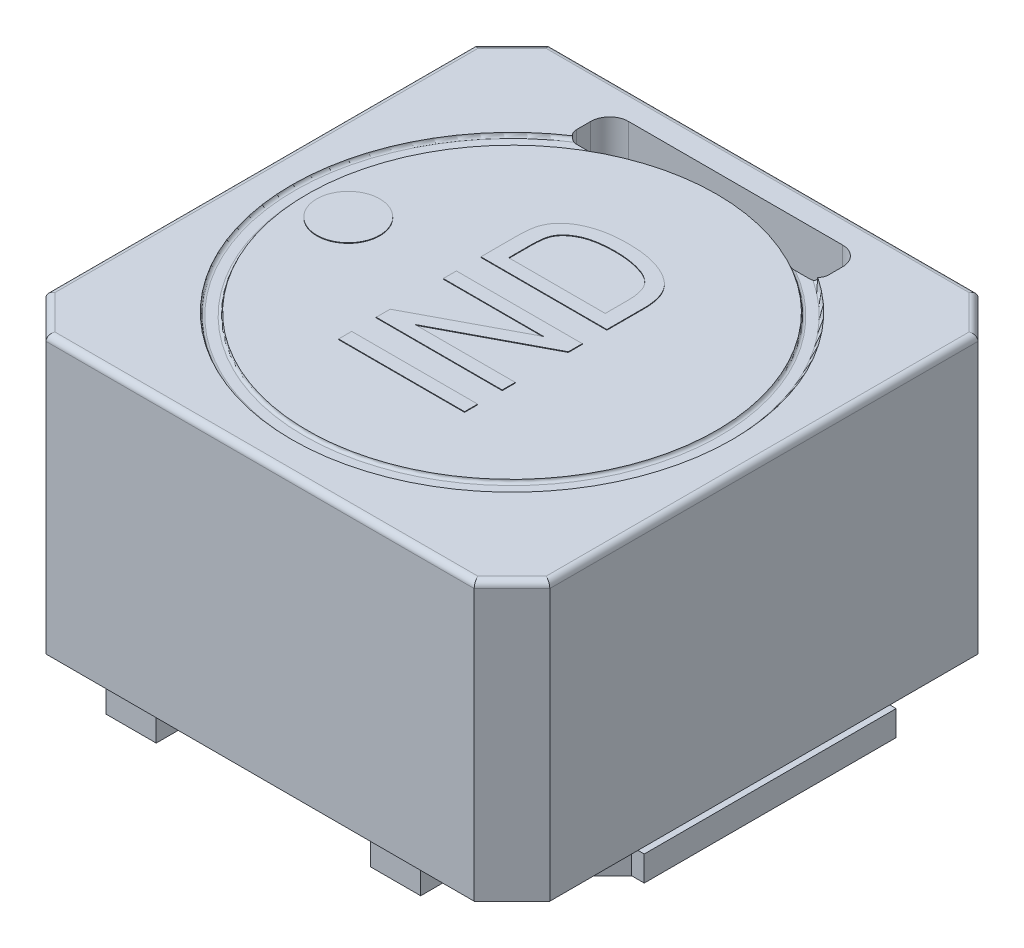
ISO-10303-21;
HEADER;
FILE_DESCRIPTION(('STEP AP214'),'2;1');
FILE_NAME('part.step','',(''),(''),'','','');
FILE_SCHEMA(('AUTOMOTIVE_DESIGN { 1 0 10303 214 1 1 1 1 }'));
ENDSEC;
DATA;
#1=APPLICATION_CONTEXT('core data for automotive mechanical design processes');
#2=APPLICATION_PROTOCOL_DEFINITION('international standard','automotive_design',2000,#1);
#3=PRODUCT_CONTEXT('',#1,'mechanical');
#4=PRODUCT('Part','Part','',(#3));
#5=PRODUCT_RELATED_PRODUCT_CATEGORY('part','',(#4));
#6=PRODUCT_DEFINITION_FORMATION('','',#4);
#7=PRODUCT_DEFINITION_CONTEXT('part definition',#1,'design');
#8=PRODUCT_DEFINITION('design','',#6,#7);
#9=PRODUCT_DEFINITION_SHAPE('','',#8);
#10=(LENGTH_UNIT() NAMED_UNIT(*) SI_UNIT(.MILLI.,.METRE.));
#11=(NAMED_UNIT(*) PLANE_ANGLE_UNIT() SI_UNIT($,.RADIAN.));
#12=(NAMED_UNIT(*) SI_UNIT($,.STERADIAN.) SOLID_ANGLE_UNIT());
#13=UNCERTAINTY_MEASURE_WITH_UNIT(LENGTH_MEASURE(1.E-05),#10,'distance_accuracy_value','');
#14=(GEOMETRIC_REPRESENTATION_CONTEXT(3) GLOBAL_UNCERTAINTY_ASSIGNED_CONTEXT((#13)) GLOBAL_UNIT_ASSIGNED_CONTEXT((#10,
#11,#12)) REPRESENTATION_CONTEXT('',''));
#15=CARTESIAN_POINT('',(0.,0.,0.));
#16=DIRECTION('',(0.,0.,1.));
#17=DIRECTION('',(1.,0.,0.));
#18=AXIS2_PLACEMENT_3D('',#15,#16,#17);
#19=CARTESIAN_POINT('',(-1.3,2.405,0.));
#20=DIRECTION('',(0.,1.,0.));
#21=DIRECTION('',(1.,0.,0.));
#22=AXIS2_PLACEMENT_3D('',#19,#20,#21);
#23=PLANE('',#22);
#24=CARTESIAN_POINT('',(-1.3,2.405,0.));
#25=DIRECTION('',(0.,1.,0.));
#26=DIRECTION('',(0.,0.,1.));
#27=AXIS2_PLACEMENT_3D('',#24,#25,#26);
#28=CIRCLE('',#27,0.25);
#29=CARTESIAN_POINT('',(-1.3,2.405,0.25));
#30=VERTEX_POINT('',#29);
#31=EDGE_CURVE('E2730',#30,#30,#28,.T.);
#32=ORIENTED_EDGE('',*,*,#31,.T.);
#33=EDGE_LOOP('',(#32));
#34=FACE_BOUND('',#33,.T.);
#35=ADVANCED_FACE('F17',(#34),#23,.T.);
#36=CARTESIAN_POINT('',(0.,2.405,0.));
#37=DIRECTION('',(0.,-1.,0.));
#38=DIRECTION('',(0.,0.,-1.));
#39=AXIS2_PLACEMENT_3D('',#36,#37,#38);
#40=PLANE('',#39);
#41=DIRECTION('',(0.,0.,1.));
#42=VECTOR('',#41,1.);
#43=CARTESIAN_POINT('',(0.5,2.405,0.772727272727));
#44=LINE('',#43,#42);
#45=CARTESIAN_POINT('',(0.5,2.405,0.772727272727));
#46=VERTEX_POINT('',#45);
#47=CARTESIAN_POINT('',(0.5,2.405,0.876623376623));
#48=VERTEX_POINT('',#47);
#49=EDGE_CURVE('E1126',#46,#48,#44,.T.);
#50=ORIENTED_EDGE('',*,*,#49,.F.);
#51=DIRECTION('',(1.,0.,0.));
#52=VECTOR('',#51,1.);
#53=CARTESIAN_POINT('',(-0.5,2.405,0.772727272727));
#54=LINE('',#53,#52);
#55=CARTESIAN_POINT('',(-0.5,2.405,0.772727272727));
#56=VERTEX_POINT('',#55);
#57=EDGE_CURVE('E971',#56,#46,#54,.T.);
#58=ORIENTED_EDGE('',*,*,#57,.F.);
#59=DIRECTION('',(0.,0.,-1.));
#60=VECTOR('',#59,1.);
#61=CARTESIAN_POINT('',(-0.5,2.405,0.876623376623));
#62=LINE('',#61,#60);
#63=CARTESIAN_POINT('',(-0.5,2.405,0.876623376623));
#64=VERTEX_POINT('',#63);
#65=EDGE_CURVE('E11',#64,#56,#62,.T.);
#66=ORIENTED_EDGE('',*,*,#65,.F.);
#67=DIRECTION('',(-1.,0.,0.));
#68=VECTOR('',#67,1.);
#69=CARTESIAN_POINT('',(0.5,2.405,0.876623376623));
#70=LINE('',#69,#68);
#71=EDGE_CURVE('E1134',#48,#64,#70,.T.);
#72=ORIENTED_EDGE('',*,*,#71,.F.);
#73=EDGE_LOOP('',(#50,#58,#66,#72));
#74=FACE_BOUND('',#73,.T.);
#75=ADVANCED_FACE('F1578',(#74),#40,.F.);
#76=CARTESIAN_POINT('',(-0.5,2.405,0.876623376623));
#77=DIRECTION('',(-1.,0.,0.));
#78=DIRECTION('',(0.,0.,1.));
#79=AXIS2_PLACEMENT_3D('',#76,#77,#78);
#80=PLANE('',#79);
#81=DIRECTION('',(0.,0.,-1.));
#82=VECTOR('',#81,1.);
#83=CARTESIAN_POINT('',(-0.5,2.4,0.876623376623));
#84=LINE('',#83,#82);
#85=CARTESIAN_POINT('',(-0.5,2.4,0.876623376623));
#86=VERTEX_POINT('',#85);
#87=CARTESIAN_POINT('',(-0.5,2.4,0.772727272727));
#88=VERTEX_POINT('',#87);
#89=EDGE_CURVE('E2743',#86,#88,#84,.T.);
#90=ORIENTED_EDGE('',*,*,#89,.F.);
#91=DIRECTION('',(0.,-1.,0.));
#92=VECTOR('',#91,1.);
#93=CARTESIAN_POINT('',(-0.5,2.405,0.876623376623));
#94=LINE('',#93,#92);
#95=EDGE_CURVE('E36',#64,#86,#94,.T.);
#96=ORIENTED_EDGE('',*,*,#95,.F.);
#97=ORIENTED_EDGE('',*,*,#65,.T.);
#98=DIRECTION('',(0.,-1.,0.));
#99=VECTOR('',#98,1.);
#100=CARTESIAN_POINT('',(-0.5,2.405,0.772727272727));
#101=LINE('',#100,#99);
#102=EDGE_CURVE('E976',#56,#88,#101,.T.);
#103=ORIENTED_EDGE('',*,*,#102,.T.);
#104=EDGE_LOOP('',(#90,#96,#97,#103));
#105=FACE_BOUND('',#104,.T.);
#106=ADVANCED_FACE('F1583',(#105),#80,.T.);
#107=CARTESIAN_POINT('',(0.5,2.405,0.876623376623));
#108=DIRECTION('',(0.,0.,1.));
#109=DIRECTION('',(1.,0.,0.));
#110=AXIS2_PLACEMENT_3D('',#107,#108,#109);
#111=PLANE('',#110);
#112=DIRECTION('',(-1.,0.,0.));
#113=VECTOR('',#112,1.);
#114=CARTESIAN_POINT('',(0.5,2.4,0.876623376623));
#115=LINE('',#114,#113);
#116=CARTESIAN_POINT('',(0.5,2.4,0.876623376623));
#117=VERTEX_POINT('',#116);
#118=EDGE_CURVE('E2748',#117,#86,#115,.T.);
#119=ORIENTED_EDGE('',*,*,#118,.F.);
#120=DIRECTION('',(0.,-1.,0.));
#121=VECTOR('',#120,1.);
#122=CARTESIAN_POINT('',(0.5,2.405,0.876623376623));
#123=LINE('',#122,#121);
#124=EDGE_CURVE('E1130',#48,#117,#123,.T.);
#125=ORIENTED_EDGE('',*,*,#124,.F.);
#126=ORIENTED_EDGE('',*,*,#71,.T.);
#127=ORIENTED_EDGE('',*,*,#95,.T.);
#128=EDGE_LOOP('',(#119,#125,#126,#127));
#129=FACE_BOUND('',#128,.T.);
#130=ADVANCED_FACE('F1589',(#129),#111,.T.);
#131=CARTESIAN_POINT('',(0.5,2.405,0.772727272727));
#132=DIRECTION('',(1.,0.,0.));
#133=DIRECTION('',(0.,1.,0.));
#134=AXIS2_PLACEMENT_3D('',#131,#132,#133);
#135=PLANE('',#134);
#136=DIRECTION('',(0.,0.,1.));
#137=VECTOR('',#136,1.);
#138=CARTESIAN_POINT('',(0.5,2.4,0.772727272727));
#139=LINE('',#138,#137);
#140=CARTESIAN_POINT('',(0.5,2.4,0.772727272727));
#141=VERTEX_POINT('',#140);
#142=EDGE_CURVE('E1286',#141,#117,#139,.T.);
#143=ORIENTED_EDGE('',*,*,#142,.F.);
#144=DIRECTION('',(0.,-1.,0.));
#145=VECTOR('',#144,1.);
#146=CARTESIAN_POINT('',(0.5,2.405,0.772727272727));
#147=LINE('',#146,#145);
#148=EDGE_CURVE('E975',#46,#141,#147,.T.);
#149=ORIENTED_EDGE('',*,*,#148,.F.);
#150=ORIENTED_EDGE('',*,*,#49,.T.);
#151=ORIENTED_EDGE('',*,*,#124,.T.);
#152=EDGE_LOOP('',(#143,#149,#150,#151));
#153=FACE_BOUND('',#152,.T.);
#154=ADVANCED_FACE('F3286',(#153),#135,.T.);
#155=CARTESIAN_POINT('',(-0.5,2.405,0.772727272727));
#156=DIRECTION('',(0.,0.,-1.));
#157=DIRECTION('',(0.,-1.,0.));
#158=AXIS2_PLACEMENT_3D('',#155,#156,#157);
#159=PLANE('',#158);
#160=DIRECTION('',(1.,0.,0.));
#161=VECTOR('',#160,1.);
#162=CARTESIAN_POINT('',(-0.5,2.4,0.772727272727));
#163=LINE('',#162,#161);
#164=EDGE_CURVE('E2747',#88,#141,#163,.T.);
#165=ORIENTED_EDGE('',*,*,#164,.F.);
#166=ORIENTED_EDGE('',*,*,#102,.F.);
#167=ORIENTED_EDGE('',*,*,#57,.T.);
#168=ORIENTED_EDGE('',*,*,#148,.T.);
#169=EDGE_LOOP('',(#165,#166,#167,#168));
#170=FACE_BOUND('',#169,.T.);
#171=ADVANCED_FACE('F3214',(#170),#159,.T.);
#172=CARTESIAN_POINT('',(0.,2.405,0.));
#173=DIRECTION('',(0.,-1.,0.));
#174=DIRECTION('',(0.,0.,-1.));
#175=AXIS2_PLACEMENT_3D('',#172,#173,#174);
#176=PLANE('',#175);
#177=DIRECTION('',(0.,0.,1.));
#178=VECTOR('',#177,1.);
#179=CARTESIAN_POINT('',(0.5,2.405,0.474025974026));
#180=LINE('',#179,#178);
#181=CARTESIAN_POINT('',(0.5,2.405,0.474025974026));
#182=VERTEX_POINT('',#181);
#183=CARTESIAN_POINT('',(0.5,2.405,0.577922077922));
#184=VERTEX_POINT('',#183);
#185=EDGE_CURVE('E1076',#182,#184,#180,.T.);
#186=ORIENTED_EDGE('',*,*,#185,.F.);
#187=DIRECTION('',(1.,0.,0.));
#188=VECTOR('',#187,1.);
#189=CARTESIAN_POINT('',(-0.296063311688,2.405,0.474025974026));
#190=LINE('',#189,#188);
#191=CARTESIAN_POINT('',(-0.296063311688,2.405,0.474025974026));
#192=VERTEX_POINT('',#191);
#193=EDGE_CURVE('E1068',#192,#182,#190,.T.);
#194=ORIENTED_EDGE('',*,*,#193,.F.);
#195=DIRECTION('',(-0.883870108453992,0.,0.467732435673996));
#196=VECTOR('',#195,1.);
#197=CARTESIAN_POINT('',(0.5,2.405,0.05275974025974));
#198=LINE('',#197,#196);
#199=CARTESIAN_POINT('',(0.5,2.405,0.05275974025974));
#200=VERTEX_POINT('',#199);
#201=EDGE_CURVE('E1049',#200,#192,#198,.T.);
#202=ORIENTED_EDGE('',*,*,#201,.F.);
#203=DIRECTION('',(0.,0.,1.));
#204=VECTOR('',#203,1.);
#205=CARTESIAN_POINT('',(0.5,2.405,-0.05844155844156));
#206=LINE('',#205,#204);
#207=CARTESIAN_POINT('',(0.5,2.405,-0.05844155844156));
#208=VERTEX_POINT('',#207);
#209=EDGE_CURVE('E731',#208,#200,#206,.T.);
#210=ORIENTED_EDGE('',*,*,#209,.F.);
#211=DIRECTION('',(1.,0.,0.));
#212=VECTOR('',#211,1.);
#213=CARTESIAN_POINT('',(-0.5,2.405,-0.05844155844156));
#214=LINE('',#213,#212);
#215=CARTESIAN_POINT('',(-0.5,2.405,-0.05844155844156));
#216=VERTEX_POINT('',#215);
#217=EDGE_CURVE('E732',#216,#208,#214,.T.);
#218=ORIENTED_EDGE('',*,*,#217,.F.);
#219=DIRECTION('',(0.,0.,-1.));
#220=VECTOR('',#219,1.);
#221=CARTESIAN_POINT('',(-0.5,2.405,0.04545454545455));
#222=LINE('',#221,#220);
#223=CARTESIAN_POINT('',(-0.5,2.405,0.04545454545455));
#224=VERTEX_POINT('',#223);
#225=EDGE_CURVE('E1039',#224,#216,#222,.T.);
#226=ORIENTED_EDGE('',*,*,#225,.F.);
#227=DIRECTION('',(-1.,0.,0.));
#228=VECTOR('',#227,1.);
#229=CARTESIAN_POINT('',(0.297077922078,2.405,0.04545454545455));
#230=LINE('',#229,#228);
#231=CARTESIAN_POINT('',(0.297077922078,2.405,0.04545454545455));
#232=VERTEX_POINT('',#231);
#233=EDGE_CURVE('E1105',#232,#224,#230,.T.);
#234=ORIENTED_EDGE('',*,*,#233,.F.);
#235=DIRECTION('',(0.883837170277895,0.,-0.467794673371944));
#236=VECTOR('',#235,1.);
#237=CARTESIAN_POINT('',(-0.5,2.405,0.467329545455));
#238=LINE('',#237,#236);
#239=CARTESIAN_POINT('',(-0.5,2.405,0.467329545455));
#240=VERTEX_POINT('',#239);
#241=EDGE_CURVE('E1097',#240,#232,#238,.T.);
#242=ORIENTED_EDGE('',*,*,#241,.F.);
#243=DIRECTION('',(0.,0.,-1.));
#244=VECTOR('',#243,1.);
#245=CARTESIAN_POINT('',(-0.5,2.405,0.577922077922));
#246=LINE('',#245,#244);
#247=CARTESIAN_POINT('',(-0.5,2.405,0.577922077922));
#248=VERTEX_POINT('',#247);
#249=EDGE_CURVE('E1092',#248,#240,#246,.T.);
#250=ORIENTED_EDGE('',*,*,#249,.F.);
#251=DIRECTION('',(-1.,0.,0.));
#252=VECTOR('',#251,1.);
#253=CARTESIAN_POINT('',(0.5,2.405,0.577922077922));
#254=LINE('',#253,#252);
#255=EDGE_CURVE('E1084',#184,#248,#254,.T.);
#256=ORIENTED_EDGE('',*,*,#255,.F.);
#257=EDGE_LOOP('',(#186,#194,#202,#210,#218,#226,#234,#242,#250,#256));
#258=FACE_BOUND('',#257,.T.);
#259=ADVANCED_FACE('F1532',(#258),#176,.F.);
#260=CARTESIAN_POINT('',(0.5,2.405,0.05275974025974));
#261=DIRECTION('',(0.467732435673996,0.,0.883870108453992));
#262=DIRECTION('',(0.,-1.,0.));
#263=AXIS2_PLACEMENT_3D('',#260,#261,#262);
#264=PLANE('',#263);
#265=DIRECTION('',(-0.883870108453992,0.,0.467732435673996));
#266=VECTOR('',#265,1.);
#267=CARTESIAN_POINT('',(0.5,2.4,0.05275974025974));
#268=LINE('',#267,#266);
#269=CARTESIAN_POINT('',(0.5,2.4,0.05275974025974));
#270=VERTEX_POINT('',#269);
#271=CARTESIAN_POINT('',(-0.296063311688,2.4,0.474025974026));
#272=VERTEX_POINT('',#271);
#273=EDGE_CURVE('E1614',#270,#272,#268,.T.);
#274=ORIENTED_EDGE('',*,*,#273,.F.);
#275=DIRECTION('',(0.,-1.,0.));
#276=VECTOR('',#275,1.);
#277=CARTESIAN_POINT('',(0.5,2.405,0.05275974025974));
#278=LINE('',#277,#276);
#279=EDGE_CURVE('E1045',#200,#270,#278,.T.);
#280=ORIENTED_EDGE('',*,*,#279,.F.);
#281=ORIENTED_EDGE('',*,*,#201,.T.);
#282=DIRECTION('',(0.,-1.,0.));
#283=VECTOR('',#282,1.);
#284=CARTESIAN_POINT('',(-0.296063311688,2.405,0.474025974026));
#285=LINE('',#284,#283);
#286=EDGE_CURVE('E1064',#192,#272,#285,.T.);
#287=ORIENTED_EDGE('',*,*,#286,.T.);
#288=EDGE_LOOP('',(#274,#280,#281,#287));
#289=FACE_BOUND('',#288,.T.);
#290=ADVANCED_FACE('F1528',(#289),#264,.T.);
#291=CARTESIAN_POINT('',(0.5,2.405,-0.05844155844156));
#292=DIRECTION('',(1.,0.,0.));
#293=DIRECTION('',(0.,1.,0.));
#294=AXIS2_PLACEMENT_3D('',#291,#292,#293);
#295=PLANE('',#294);
#296=DIRECTION('',(0.,0.,1.));
#297=VECTOR('',#296,1.);
#298=CARTESIAN_POINT('',(0.5,2.4,-0.05844155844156));
#299=LINE('',#298,#297);
#300=CARTESIAN_POINT('',(0.5,2.4,-0.05844155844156));
#301=VERTEX_POINT('',#300);
#302=EDGE_CURVE('E1602',#301,#270,#299,.T.);
#303=ORIENTED_EDGE('',*,*,#302,.F.);
#304=DIRECTION('',(0.,-1.,0.));
#305=VECTOR('',#304,1.);
#306=CARTESIAN_POINT('',(0.5,2.405,-0.05844155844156));
#307=LINE('',#306,#305);
#308=EDGE_CURVE('E727',#208,#301,#307,.T.);
#309=ORIENTED_EDGE('',*,*,#308,.F.);
#310=ORIENTED_EDGE('',*,*,#209,.T.);
#311=ORIENTED_EDGE('',*,*,#279,.T.);
#312=EDGE_LOOP('',(#303,#309,#310,#311));
#313=FACE_BOUND('',#312,.T.);
#314=ADVANCED_FACE('F1531',(#313),#295,.T.);
#315=CARTESIAN_POINT('',(-0.5,2.405,-0.05844155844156));
#316=DIRECTION('',(0.,0.,-1.));
#317=DIRECTION('',(0.,-1.,0.));
#318=AXIS2_PLACEMENT_3D('',#315,#316,#317);
#319=PLANE('',#318);
#320=DIRECTION('',(1.,0.,0.));
#321=VECTOR('',#320,1.);
#322=CARTESIAN_POINT('',(-0.5,2.4,-0.05844155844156));
#323=LINE('',#322,#321);
#324=CARTESIAN_POINT('',(-0.5,2.4,-0.05844155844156));
#325=VERTEX_POINT('',#324);
#326=EDGE_CURVE('E1615',#325,#301,#323,.T.);
#327=ORIENTED_EDGE('',*,*,#326,.F.);
#328=DIRECTION('',(0.,-1.,0.));
#329=VECTOR('',#328,1.);
#330=CARTESIAN_POINT('',(-0.5,2.405,-0.05844155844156));
#331=LINE('',#330,#329);
#332=EDGE_CURVE('E1043',#216,#325,#331,.T.);
#333=ORIENTED_EDGE('',*,*,#332,.F.);
#334=ORIENTED_EDGE('',*,*,#217,.T.);
#335=ORIENTED_EDGE('',*,*,#308,.T.);
#336=EDGE_LOOP('',(#327,#333,#334,#335));
#337=FACE_BOUND('',#336,.T.);
#338=ADVANCED_FACE('F1573',(#337),#319,.T.);
#339=CARTESIAN_POINT('',(-0.5,2.405,0.04545454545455));
#340=DIRECTION('',(-1.,0.,0.));
#341=DIRECTION('',(0.,0.,1.));
#342=AXIS2_PLACEMENT_3D('',#339,#340,#341);
#343=PLANE('',#342);
#344=DIRECTION('',(0.,0.,-1.));
#345=VECTOR('',#344,1.);
#346=CARTESIAN_POINT('',(-0.5,2.4,0.04545454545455));
#347=LINE('',#346,#345);
#348=CARTESIAN_POINT('',(-0.5,2.4,0.04545454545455));
#349=VERTEX_POINT('',#348);
#350=EDGE_CURVE('E1623',#349,#325,#347,.T.);
#351=ORIENTED_EDGE('',*,*,#350,.F.);
#352=DIRECTION('',(0.,-1.,0.));
#353=VECTOR('',#352,1.);
#354=CARTESIAN_POINT('',(-0.5,2.405,0.04545454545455));
#355=LINE('',#354,#353);
#356=EDGE_CURVE('E1044',#224,#349,#355,.T.);
#357=ORIENTED_EDGE('',*,*,#356,.F.);
#358=ORIENTED_EDGE('',*,*,#225,.T.);
#359=ORIENTED_EDGE('',*,*,#332,.T.);
#360=EDGE_LOOP('',(#351,#357,#358,#359));
#361=FACE_BOUND('',#360,.T.);
#362=ADVANCED_FACE('F1565',(#361),#343,.T.);
#363=CARTESIAN_POINT('',(0.297077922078,2.405,0.04545454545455));
#364=DIRECTION('',(0.,0.,1.));
#365=DIRECTION('',(1.,0.,0.));
#366=AXIS2_PLACEMENT_3D('',#363,#364,#365);
#367=PLANE('',#366);
#368=DIRECTION('',(-1.,0.,0.));
#369=VECTOR('',#368,1.);
#370=CARTESIAN_POINT('',(0.297077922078,2.4,0.04545454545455));
#371=LINE('',#370,#369);
#372=CARTESIAN_POINT('',(0.297077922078,2.4,0.04545454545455));
#373=VERTEX_POINT('',#372);
#374=EDGE_CURVE('E1630',#373,#349,#371,.T.);
#375=ORIENTED_EDGE('',*,*,#374,.F.);
#376=DIRECTION('',(0.,-1.,0.));
#377=VECTOR('',#376,1.);
#378=CARTESIAN_POINT('',(0.297077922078,2.405,0.04545454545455));
#379=LINE('',#378,#377);
#380=EDGE_CURVE('E1101',#232,#373,#379,.T.);
#381=ORIENTED_EDGE('',*,*,#380,.F.);
#382=ORIENTED_EDGE('',*,*,#233,.T.);
#383=ORIENTED_EDGE('',*,*,#356,.T.);
#384=EDGE_LOOP('',(#375,#381,#382,#383));
#385=FACE_BOUND('',#384,.T.);
#386=ADVANCED_FACE('F1562',(#385),#367,.T.);
#387=CARTESIAN_POINT('',(-0.5,2.405,0.467329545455));
#388=DIRECTION('',(-0.467794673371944,0.,-0.883837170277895));
#389=DIRECTION('',(-0.883837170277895,0.,0.467794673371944));
#390=AXIS2_PLACEMENT_3D('',#387,#388,#389);
#391=PLANE('',#390);
#392=DIRECTION('',(0.883837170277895,0.,-0.467794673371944));
#393=VECTOR('',#392,1.);
#394=CARTESIAN_POINT('',(-0.5,2.4,0.467329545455));
#395=LINE('',#394,#393);
#396=CARTESIAN_POINT('',(-0.5,2.4,0.467329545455));
#397=VERTEX_POINT('',#396);
#398=EDGE_CURVE('E2841',#397,#373,#395,.T.);
#399=ORIENTED_EDGE('',*,*,#398,.F.);
#400=DIRECTION('',(0.,-1.,0.));
#401=VECTOR('',#400,1.);
#402=CARTESIAN_POINT('',(-0.5,2.405,0.467329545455));
#403=LINE('',#402,#401);
#404=EDGE_CURVE('E1093',#240,#397,#403,.T.);
#405=ORIENTED_EDGE('',*,*,#404,.F.);
#406=ORIENTED_EDGE('',*,*,#241,.T.);
#407=ORIENTED_EDGE('',*,*,#380,.T.);
#408=EDGE_LOOP('',(#399,#405,#406,#407));
#409=FACE_BOUND('',#408,.T.);
#410=ADVANCED_FACE('F1564',(#409),#391,.T.);
#411=CARTESIAN_POINT('',(-0.5,2.405,0.577922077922));
#412=DIRECTION('',(-1.,0.,0.));
#413=DIRECTION('',(0.,0.,1.));
#414=AXIS2_PLACEMENT_3D('',#411,#412,#413);
#415=PLANE('',#414);
#416=DIRECTION('',(0.,0.,-1.));
#417=VECTOR('',#416,1.);
#418=CARTESIAN_POINT('',(-0.5,2.4,0.577922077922));
#419=LINE('',#418,#417);
#420=CARTESIAN_POINT('',(-0.5,2.4,0.577922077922));
#421=VERTEX_POINT('',#420);
#422=EDGE_CURVE('E2758',#421,#397,#419,.T.);
#423=ORIENTED_EDGE('',*,*,#422,.F.);
#424=DIRECTION('',(0.,-1.,0.));
#425=VECTOR('',#424,1.);
#426=CARTESIAN_POINT('',(-0.5,2.405,0.577922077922));
#427=LINE('',#426,#425);
#428=EDGE_CURVE('E1088',#248,#421,#427,.T.);
#429=ORIENTED_EDGE('',*,*,#428,.F.);
#430=ORIENTED_EDGE('',*,*,#249,.T.);
#431=ORIENTED_EDGE('',*,*,#404,.T.);
#432=EDGE_LOOP('',(#423,#429,#430,#431));
#433=FACE_BOUND('',#432,.T.);
#434=ADVANCED_FACE('F1441',(#433),#415,.T.);
#435=CARTESIAN_POINT('',(0.5,2.405,0.577922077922));
#436=DIRECTION('',(0.,0.,1.));
#437=DIRECTION('',(1.,0.,0.));
#438=AXIS2_PLACEMENT_3D('',#435,#436,#437);
#439=PLANE('',#438);
#440=DIRECTION('',(-1.,0.,0.));
#441=VECTOR('',#440,1.);
#442=CARTESIAN_POINT('',(0.5,2.4,0.577922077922));
#443=LINE('',#442,#441);
#444=CARTESIAN_POINT('',(0.5,2.4,0.577922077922));
#445=VERTEX_POINT('',#444);
#446=EDGE_CURVE('E2753',#445,#421,#443,.T.);
#447=ORIENTED_EDGE('',*,*,#446,.F.);
#448=DIRECTION('',(0.,-1.,0.));
#449=VECTOR('',#448,1.);
#450=CARTESIAN_POINT('',(0.5,2.405,0.577922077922));
#451=LINE('',#450,#449);
#452=EDGE_CURVE('E1080',#184,#445,#451,.T.);
#453=ORIENTED_EDGE('',*,*,#452,.F.);
#454=ORIENTED_EDGE('',*,*,#255,.T.);
#455=ORIENTED_EDGE('',*,*,#428,.T.);
#456=EDGE_LOOP('',(#447,#453,#454,#455));
#457=FACE_BOUND('',#456,.T.);
#458=ADVANCED_FACE('F3355',(#457),#439,.T.);
#459=CARTESIAN_POINT('',(0.5,2.405,0.474025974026));
#460=DIRECTION('',(1.,0.,0.));
#461=DIRECTION('',(0.,1.,0.));
#462=AXIS2_PLACEMENT_3D('',#459,#460,#461);
#463=PLANE('',#462);
#464=DIRECTION('',(0.,0.,1.));
#465=VECTOR('',#464,1.);
#466=CARTESIAN_POINT('',(0.5,2.4,0.474025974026));
#467=LINE('',#466,#465);
#468=CARTESIAN_POINT('',(0.5,2.4,0.474025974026));
#469=VERTEX_POINT('',#468);
#470=EDGE_CURVE('E2759',#469,#445,#467,.T.);
#471=ORIENTED_EDGE('',*,*,#470,.F.);
#472=DIRECTION('',(0.,-1.,0.));
#473=VECTOR('',#472,1.);
#474=CARTESIAN_POINT('',(0.5,2.405,0.474025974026));
#475=LINE('',#474,#473);
#476=EDGE_CURVE('E1072',#182,#469,#475,.T.);
#477=ORIENTED_EDGE('',*,*,#476,.F.);
#478=ORIENTED_EDGE('',*,*,#185,.T.);
#479=ORIENTED_EDGE('',*,*,#452,.T.);
#480=EDGE_LOOP('',(#471,#477,#478,#479));
#481=FACE_BOUND('',#480,.T.);
#482=ADVANCED_FACE('F3224',(#481),#463,.T.);
#483=CARTESIAN_POINT('',(-0.296063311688,2.405,0.474025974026));
#484=DIRECTION('',(0.,0.,-1.));
#485=DIRECTION('',(0.,-1.,0.));
#486=AXIS2_PLACEMENT_3D('',#483,#484,#485);
#487=PLANE('',#486);
#488=DIRECTION('',(1.,0.,0.));
#489=VECTOR('',#488,1.);
#490=CARTESIAN_POINT('',(-0.296063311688,2.4,0.474025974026));
#491=LINE('',#490,#489);
#492=EDGE_CURVE('E1343',#272,#469,#491,.T.);
#493=ORIENTED_EDGE('',*,*,#492,.F.);
#494=ORIENTED_EDGE('',*,*,#286,.F.);
#495=ORIENTED_EDGE('',*,*,#193,.T.);
#496=ORIENTED_EDGE('',*,*,#476,.T.);
#497=EDGE_LOOP('',(#493,#494,#495,#496));
#498=FACE_BOUND('',#497,.T.);
#499=ADVANCED_FACE('F1438',(#498),#487,.T.);
#500=CARTESIAN_POINT('',(0.,2.4,0.));
#501=DIRECTION('',(0.,1.,0.));
#502=DIRECTION('',(1.,0.,0.));
#503=AXIS2_PLACEMENT_3D('',#500,#501,#502);
#504=PLANE('',#503);
#505=DIRECTION('',(1.,0.,0.));
#506=VECTOR('',#505,1.);
#507=CARTESIAN_POINT('',(-0.383116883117,2.4,-0.357142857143));
#508=LINE('',#507,#506);
#509=CARTESIAN_POINT('',(-0.383116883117,2.4,-0.357142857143));
#510=VERTEX_POINT('',#509);
#511=CARTESIAN_POINT('',(0.383116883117,2.4,-0.357142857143));
#512=VERTEX_POINT('',#511);
#513=EDGE_CURVE('E1054',#510,#512,#508,.T.);
#514=ORIENTED_EDGE('',*,*,#513,.T.);
#515=DIRECTION('',(0.,0.,-1.));
#516=VECTOR('',#515,1.);
#517=CARTESIAN_POINT('',(0.383116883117,2.4,-0.357142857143));
#518=LINE('',#517,#516);
#519=CARTESIAN_POINT('',(0.383116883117,2.4,-0.535511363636));
#520=VERTEX_POINT('',#519);
#521=EDGE_CURVE('E1063',#512,#520,#518,.T.);
#522=ORIENTED_EDGE('',*,*,#521,.T.);
#523=CARTESIAN_POINT('',(0.383116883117,2.4,-0.535511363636));
#524=CARTESIAN_POINT('',(0.383072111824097,2.4,-0.538843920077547));
#525=CARTESIAN_POINT('',(0.383024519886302,2.4,-0.542177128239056));
#526=CARTESIAN_POINT('',(0.382839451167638,2.4,-0.552181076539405));
#527=CARTESIAN_POINT('',(0.382659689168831,2.4,-0.558851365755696));
#528=CARTESIAN_POINT('',(0.382007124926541,2.4,-0.572177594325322));
#529=CARTESIAN_POINT('',(0.381534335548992,2.4,-0.578833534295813));
#530=CARTESIAN_POINT('',(0.380369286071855,2.4,-0.59213361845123));
#531=CARTESIAN_POINT('',(0.379676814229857,2.4,-0.598777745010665));
#532=CARTESIAN_POINT('',(0.377880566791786,2.4,-0.612011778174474));
#533=CARTESIAN_POINT('',(0.376776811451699,2.4,-0.618601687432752));
#534=CARTESIAN_POINT('',(0.374196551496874,2.4,-0.631711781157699));
#535=CARTESIAN_POINT('',(0.372719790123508,2.4,-0.638231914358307));
#536=CARTESIAN_POINT('',(0.369316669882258,2.4,-0.651166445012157));
#537=CARTESIAN_POINT('',(0.367389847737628,2.4,-0.657580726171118));
#538=CARTESIAN_POINT('',(0.363421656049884,2.4,-0.668757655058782));
#539=CARTESIAN_POINT('',(0.36150571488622,2.4,-0.673564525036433));
#540=CARTESIAN_POINT('',(0.357311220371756,2.4,-0.683016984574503));
#541=CARTESIAN_POINT('',(0.35503271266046,2.4,-0.68766259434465));
#542=CARTESIAN_POINT('',(0.347553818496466,2.4,-0.701219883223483));
#543=CARTESIAN_POINT('',(0.341700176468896,2.4,-0.709782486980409));
#544=CARTESIAN_POINT('',(0.333632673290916,2.4,-0.719814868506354));
#545=CARTESIAN_POINT('',(0.331989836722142,2.4,-0.721778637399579));
#546=CARTESIAN_POINT('',(0.328596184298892,2.4,-0.725610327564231));
#547=CARTESIAN_POINT('',(0.326845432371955,2.4,-0.727478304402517));
#548=CARTESIAN_POINT('',(0.32146674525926,2.4,-0.73295746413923));
#549=CARTESIAN_POINT('',(0.317712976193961,2.4,-0.736443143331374));
#550=CARTESIAN_POINT('',(0.310035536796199,2.4,-0.743199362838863));
#551=CARTESIAN_POINT('',(0.306112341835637,2.4,-0.746470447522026));
#552=CARTESIAN_POINT('',(0.298027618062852,2.4,-0.752704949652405));
#553=CARTESIAN_POINT('',(0.293866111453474,2.4,-0.755668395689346));
#554=CARTESIAN_POINT('',(0.285551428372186,2.4,-0.76119756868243));
#555=CARTESIAN_POINT('',(0.281406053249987,2.4,-0.763775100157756));
#556=CARTESIAN_POINT('',(0.272939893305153,2.4,-0.768632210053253));
#557=CARTESIAN_POINT('',(0.268618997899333,2.4,-0.770911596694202));
#558=CARTESIAN_POINT('',(0.259845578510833,2.4,-0.775215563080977));
#559=CARTESIAN_POINT('',(0.255392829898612,2.4,-0.777239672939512));
#560=CARTESIAN_POINT('',(0.246432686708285,2.4,-0.781146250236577));
#561=CARTESIAN_POINT('',(0.24192538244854,2.4,-0.783028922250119));
#562=CARTESIAN_POINT('',(0.237418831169,2.4,-0.784902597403));
#563=B_SPLINE_CURVE_WITH_KNOTS('',3,(#523,#524,#525,#526,#527,#528,#529,#530,#531,#532,#533,
#534,#535,#536,#537,#538,#539,#540,#541,#542,#543,#544,#545,#546,#547,#548,#549,#550,#551,#552,
#553,#554,#555,#556,#557,#558,#559,#560,#561,#562),.UNSPECIFIED.,.F.,.F.,(4,2,2,2,2,2,2,2,2,2,2,
2,2,2,2,2,2,2,2,4),(0.,0.0100000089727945,0.0300143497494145,0.050027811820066,
0.0700606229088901,0.0900924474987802,0.110138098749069,0.130204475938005,0.145712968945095,
0.161219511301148,0.192138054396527,0.199818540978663,0.207494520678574,0.222849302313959,
0.238163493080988,0.253476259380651,0.268110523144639,0.282754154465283,0.297424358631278,
0.312072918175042),.UNSPECIFIED.);
#564=CARTESIAN_POINT('',(0.237418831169,2.4,-0.784902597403));
#565=VERTEX_POINT('',#564);
#566=EDGE_CURVE('E1169',#520,#565,#563,.T.);
#567=ORIENTED_EDGE('',*,*,#566,.T.);
#568=CARTESIAN_POINT('',(0.237418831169,2.4,-0.784902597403));
#569=CARTESIAN_POINT('',(0.234291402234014,2.4,-0.786054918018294));
#570=CARTESIAN_POINT('',(0.23116289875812,2.4,-0.787205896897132));
#571=CARTESIAN_POINT('',(0.221757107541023,2.4,-0.790623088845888));
#572=CARTESIAN_POINT('',(0.215465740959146,2.4,-0.792851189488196));
#573=CARTESIAN_POINT('',(0.202790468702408,2.4,-0.797023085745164));
#574=CARTESIAN_POINT('',(0.196406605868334,2.4,-0.798967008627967));
#575=CARTESIAN_POINT('',(0.183552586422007,2.4,-0.802533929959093));
#576=CARTESIAN_POINT('',(0.177082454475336,2.4,-0.80415701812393));
#577=CARTESIAN_POINT('',(0.164090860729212,2.4,-0.807181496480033));
#578=CARTESIAN_POINT('',(0.157569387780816,2.4,-0.808582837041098));
#579=CARTESIAN_POINT('',(0.144503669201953,2.4,-0.811271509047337));
#580=CARTESIAN_POINT('',(0.137959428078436,2.4,-0.812558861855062));
#581=CARTESIAN_POINT('',(0.128108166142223,2.4,-0.81429323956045));
#582=CARTESIAN_POINT('',(0.124818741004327,2.4,-0.814838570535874));
#583=CARTESIAN_POINT('',(0.11822926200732,2.4,-0.815861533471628));
#584=CARTESIAN_POINT('',(0.114929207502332,2.4,-0.816339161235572));
#585=CARTESIAN_POINT('',(0.10501917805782,2.4,-0.817698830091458));
#586=CARTESIAN_POINT('',(0.0983993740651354,2.4,-0.818507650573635));
#587=CARTESIAN_POINT('',(0.0851493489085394,2.4,-0.820033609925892));
#588=CARTESIAN_POINT('',(0.0785191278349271,2.4,-0.820750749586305));
#589=CARTESIAN_POINT('',(0.0653430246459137,2.4,-0.821986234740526));
#590=CARTESIAN_POINT('',(0.0587974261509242,2.4,-0.822507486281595));
#591=CARTESIAN_POINT('',(0.0456932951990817,2.4,-0.823350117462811));
#592=CARTESIAN_POINT('',(0.0391347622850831,2.4,-0.823671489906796));
#593=CARTESIAN_POINT('',(0.0259973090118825,2.4,-0.824151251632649));
#594=CARTESIAN_POINT('',(0.0194183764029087,2.4,-0.824309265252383));
#595=CARTESIAN_POINT('',(0.00625951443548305,2.4,-0.824538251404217));
#596=CARTESIAN_POINT('',(-0.000320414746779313,2.4,-0.824609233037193));
#597=CARTESIAN_POINT('',(-0.00689935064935,2.4,-0.824675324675));
#598=B_SPLINE_CURVE_WITH_KNOTS('',3,(#568,#569,#570,#571,#572,#573,#574,#575,#576,#577,#578,
#579,#580,#581,#582,#583,#584,#585,#586,#587,#588,#589,#590,#591,#592,#593,#594,#595,#596,#597),
.UNSPECIFIED.,.F.,.F.,(4,2,2,2,2,2,2,2,2,2,2,2,2,2,4),(0.,0.0100000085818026,0.0300199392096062,
0.0500308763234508,0.0700362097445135,0.0900460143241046,0.110052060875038,0.120054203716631,
0.130056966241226,0.150062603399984,0.170068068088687,0.189763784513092,0.209460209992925,
0.229201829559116,0.248941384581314),.UNSPECIFIED.);
#599=CARTESIAN_POINT('',(-0.00689935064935,2.4,-0.824675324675));
#600=VERTEX_POINT('',#599);
#601=EDGE_CURVE('E1158',#565,#600,#598,.T.);
#602=ORIENTED_EDGE('',*,*,#601,.T.);
#603=CARTESIAN_POINT('',(-0.00689935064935,2.4,-0.824675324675));
#604=CARTESIAN_POINT('',(-0.0102324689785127,2.4,-0.824650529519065));
#605=CARTESIAN_POINT('',(-0.0135657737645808,2.4,-0.824626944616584));
#606=CARTESIAN_POINT('',(-0.0235673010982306,2.4,-0.824537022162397));
#607=CARTESIAN_POINT('',(-0.0302354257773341,2.4,-0.824451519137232));
#608=CARTESIAN_POINT('',(-0.0435675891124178,2.4,-0.824107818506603));
#609=CARTESIAN_POINT('',(-0.0502316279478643,2.4,-0.823849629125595));
#610=CARTESIAN_POINT('',(-0.0635501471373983,2.4,-0.823151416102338));
#611=CARTESIAN_POINT('',(-0.0702046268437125,2.4,-0.822711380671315));
#612=CARTESIAN_POINT('',(-0.0835050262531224,2.4,-0.821712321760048));
#613=CARTESIAN_POINT('',(-0.0901509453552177,2.4,-0.821153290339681));
#614=CARTESIAN_POINT('',(-0.103427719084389,2.4,-0.819843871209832));
#615=CARTESIAN_POINT('',(-0.110058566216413,2.4,-0.819093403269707));
#616=CARTESIAN_POINT('',(-0.123286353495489,2.4,-0.817343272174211));
#617=CARTESIAN_POINT('',(-0.129883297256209,2.4,-0.816343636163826));
#618=CARTESIAN_POINT('',(-0.143042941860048,2.4,-0.814162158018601));
#619=CARTESIAN_POINT('',(-0.149605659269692,2.4,-0.812980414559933));
#620=CARTESIAN_POINT('',(-0.162692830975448,2.4,-0.810376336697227));
#621=CARTESIAN_POINT('',(-0.169217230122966,2.4,-0.808953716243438));
#622=CARTESIAN_POINT('',(-0.182186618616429,2.4,-0.805785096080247));
#623=CARTESIAN_POINT('',(-0.188631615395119,2.4,-0.804039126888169));
#624=CARTESIAN_POINT('',(-0.201429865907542,2.4,-0.800257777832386));
#625=CARTESIAN_POINT('',(-0.207783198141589,2.4,-0.798222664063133));
#626=CARTESIAN_POINT('',(-0.220366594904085,2.4,-0.793793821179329));
#627=CARTESIAN_POINT('',(-0.226596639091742,2.4,-0.791400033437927));
#628=CARTESIAN_POINT('',(-0.245044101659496,2.4,-0.783591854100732));
#629=CARTESIAN_POINT('',(-0.257000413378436,2.4,-0.777555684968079));
#630=CARTESIAN_POINT('',(-0.274444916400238,2.4,-0.767658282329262));
#631=CARTESIAN_POINT('',(-0.280181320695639,2.4,-0.764216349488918));
#632=CARTESIAN_POINT('',(-0.291379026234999,2.4,-0.756912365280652));
#633=CARTESIAN_POINT('',(-0.296840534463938,2.4,-0.753050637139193));
#634=CARTESIAN_POINT('',(-0.307097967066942,2.4,-0.745187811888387));
#635=CARTESIAN_POINT('',(-0.311913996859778,2.4,-0.741213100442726));
#636=CARTESIAN_POINT('',(-0.321154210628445,2.4,-0.73282683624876));
#637=CARTESIAN_POINT('',(-0.325578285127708,2.4,-0.728415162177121));
#638=CARTESIAN_POINT('',(-0.331946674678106,2.4,-0.721569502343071));
#639=CARTESIAN_POINT('',(-0.33402160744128,2.4,-0.719253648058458));
#640=CARTESIAN_POINT('',(-0.338080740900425,2.4,-0.71454431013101));
#641=CARTESIAN_POINT('',(-0.340064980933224,2.4,-0.71215086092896));
#642=CARTESIAN_POINT('',(-0.344106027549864,2.4,-0.706983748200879));
#643=CARTESIAN_POINT('',(-0.346146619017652,2.4,-0.704197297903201));
#644=CARTESIAN_POINT('',(-0.350033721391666,2.4,-0.69848932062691));
#645=CARTESIAN_POINT('',(-0.351880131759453,2.4,-0.695567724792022));
#646=CARTESIAN_POINT('',(-0.355373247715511,2.4,-0.689586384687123));
#647=CARTESIAN_POINT('',(-0.357018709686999,2.4,-0.686525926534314));
#648=CARTESIAN_POINT('',(-0.360190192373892,2.4,-0.680346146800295));
#649=CARTESIAN_POINT('',(-0.36171631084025,2.4,-0.677226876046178));
#650=CARTESIAN_POINT('',(-0.363230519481,2.4,-0.674107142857));
#651=B_SPLINE_CURVE_WITH_KNOTS('',3,(#603,#604,#605,#606,#607,#608,#609,#610,#611,#612,#613,
#614,#615,#616,#617,#618,#619,#620,#621,#622,#623,#624,#625,#626,#627,#628,#629,#630,#631,#632,
#633,#634,#635,#636,#637,#638,#639,#640,#641,#642,#643,#644,#645,#646,#647,#648,#649,#650),
.UNSPECIFIED.,.F.,.F.,(4,2,2,2,2,2,2,2,2,2,2,2,2,2,2,2,2,2,2,2,2,2,2,4),(0.,0.0100000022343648,
0.0300051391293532,0.050009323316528,0.070014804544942,0.0900216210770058,0.110036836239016,
0.130049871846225,0.150052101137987,0.17007825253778,0.19010251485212,0.210108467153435,
0.230117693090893,0.27019298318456,0.290254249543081,0.310300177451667,0.329011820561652,
0.347728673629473,0.357055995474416,0.366379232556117,0.376732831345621,0.387091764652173,
0.397511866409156,0.40792334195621),.UNSPECIFIED.);
#652=CARTESIAN_POINT('',(-0.363230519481,2.4,-0.674107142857));
#653=VERTEX_POINT('',#652);
#654=EDGE_CURVE('E1146',#600,#653,#651,.T.);
#655=ORIENTED_EDGE('',*,*,#654,.T.);
#656=CARTESIAN_POINT('',(-0.363230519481,2.4,-0.674107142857));
#657=CARTESIAN_POINT('',(-0.363859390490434,2.4,-0.672563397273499));
#658=CARTESIAN_POINT('',(-0.364493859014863,2.4,-0.67102101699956));
#659=CARTESIAN_POINT('',(-0.365737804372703,2.4,-0.667927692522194));
#660=CARTESIAN_POINT('',(-0.366347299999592,2.4,-0.666376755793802));
#661=CARTESIAN_POINT('',(-0.369259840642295,2.4,-0.658525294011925));
#662=CARTESIAN_POINT('',(-0.371105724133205,2.4,-0.652056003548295));
#663=CARTESIAN_POINT('',(-0.37352613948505,2.4,-0.642272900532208));
#664=CARTESIAN_POINT('',(-0.374275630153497,2.4,-0.638994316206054));
#665=CARTESIAN_POINT('',(-0.375603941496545,2.4,-0.632402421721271));
#666=CARTESIAN_POINT('',(-0.376182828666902,2.4,-0.629089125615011));
#667=CARTESIAN_POINT('',(-0.377222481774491,2.4,-0.622470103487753));
#668=CARTESIAN_POINT('',(-0.377684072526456,2.4,-0.619164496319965));
#669=CARTESIAN_POINT('',(-0.378570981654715,2.4,-0.612547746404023));
#670=CARTESIAN_POINT('',(-0.378996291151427,2.4,-0.609236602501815));
#671=CARTESIAN_POINT('',(-0.380182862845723,2.4,-0.599298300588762));
#672=CARTESIAN_POINT('',(-0.380855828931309,2.4,-0.5926594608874));
#673=CARTESIAN_POINT('',(-0.382027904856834,2.4,-0.577139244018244));
#674=CARTESIAN_POINT('',(-0.382394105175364,2.4,-0.568248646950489));
#675=CARTESIAN_POINT('',(-0.382865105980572,2.4,-0.55045803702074));
#676=CARTESIAN_POINT('',(-0.382969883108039,2.4,-0.541558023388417));
#677=CARTESIAN_POINT('',(-0.383116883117,2.4,-0.532670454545));
#678=B_SPLINE_CURVE_WITH_KNOTS('',3,(#656,#657,#658,#659,#660,#661,#662,#663,#664,#665,#666,
#667,#668,#669,#670,#671,#672,#673,#674,#675,#676,#677),.UNSPECIFIED.,.F.,.F.,(4,2,2,2,2,2,2,2,
2,2,4),(0.,0.0050023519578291,0.0100008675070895,0.0301271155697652,0.0402167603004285,
0.0503024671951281,0.0603151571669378,0.0703302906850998,0.0903398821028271,0.117025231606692,
0.14371296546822),.UNSPECIFIED.);
#679=CARTESIAN_POINT('',(-0.383116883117,2.4,-0.532670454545));
#680=VERTEX_POINT('',#679);
#681=EDGE_CURVE('E1145',#653,#680,#678,.T.);
#682=ORIENTED_EDGE('',*,*,#681,.T.);
#683=DIRECTION('',(0.,0.,1.));
#684=VECTOR('',#683,1.);
#685=CARTESIAN_POINT('',(-0.383116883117,2.4,-0.532670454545));
#686=LINE('',#685,#684);
#687=EDGE_CURVE('E1055',#680,#510,#686,.T.);
#688=ORIENTED_EDGE('',*,*,#687,.T.);
#689=EDGE_LOOP('',(#514,#522,#567,#602,#655,#682,#688));
#690=FACE_BOUND('',#689,.T.);
#691=ADVANCED_FACE('F1432',(#690),#504,.T.);
#692=CARTESIAN_POINT('',(0.383116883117,2.405,-0.357142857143));
#693=DIRECTION('',(-1.,0.,0.));
#694=DIRECTION('',(0.,0.,1.));
#695=AXIS2_PLACEMENT_3D('',#692,#693,#694);
#696=PLANE('',#695);
#697=ORIENTED_EDGE('',*,*,#521,.F.);
#698=DIRECTION('',(0.,-1.,0.));
#699=VECTOR('',#698,1.);
#700=CARTESIAN_POINT('',(0.383116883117,2.405,-0.357142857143));
#701=LINE('',#700,#699);
#702=CARTESIAN_POINT('',(0.383116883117,2.405,-0.357142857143));
#703=VERTEX_POINT('',#702);
#704=EDGE_CURVE('E1059',#703,#512,#701,.T.);
#705=ORIENTED_EDGE('',*,*,#704,.F.);
#706=DIRECTION('',(0.,0.,-1.));
#707=VECTOR('',#706,1.);
#708=CARTESIAN_POINT('',(0.383116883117,2.405,-0.357142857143));
#709=LINE('',#708,#707);
#710=CARTESIAN_POINT('',(0.383116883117,2.405,-0.535511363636));
#711=VERTEX_POINT('',#710);
#712=EDGE_CURVE('E1028',#703,#711,#709,.T.);
#713=ORIENTED_EDGE('',*,*,#712,.T.);
#714=DIRECTION('',(0.,-1.,0.));
#715=VECTOR('',#714,1.);
#716=CARTESIAN_POINT('',(0.383116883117,2.405,-0.535511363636));
#717=LINE('',#716,#715);
#718=EDGE_CURVE('E1163',#711,#520,#717,.T.);
#719=ORIENTED_EDGE('',*,*,#718,.T.);
#720=EDGE_LOOP('',(#697,#705,#713,#719));
#721=FACE_BOUND('',#720,.T.);
#722=ADVANCED_FACE('F1437',(#721),#696,.T.);
#723=CARTESIAN_POINT('',(-0.383116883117,2.405,-0.357142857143));
#724=DIRECTION('',(0.,0.,-1.));
#725=DIRECTION('',(0.,-1.,0.));
#726=AXIS2_PLACEMENT_3D('',#723,#724,#725);
#727=PLANE('',#726);
#728=ORIENTED_EDGE('',*,*,#513,.F.);
#729=DIRECTION('',(0.,-1.,0.));
#730=VECTOR('',#729,1.);
#731=CARTESIAN_POINT('',(-0.383116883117,2.405,-0.357142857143));
#732=LINE('',#731,#730);
#733=CARTESIAN_POINT('',(-0.383116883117,2.405,-0.357142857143));
#734=VERTEX_POINT('',#733);
#735=EDGE_CURVE('E1050',#734,#510,#732,.T.);
#736=ORIENTED_EDGE('',*,*,#735,.F.);
#737=DIRECTION('',(1.,0.,0.));
#738=VECTOR('',#737,1.);
#739=CARTESIAN_POINT('',(-0.383116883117,2.405,-0.357142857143));
#740=LINE('',#739,#738);
#741=EDGE_CURVE('E1032',#734,#703,#740,.T.);
#742=ORIENTED_EDGE('',*,*,#741,.T.);
#743=ORIENTED_EDGE('',*,*,#704,.T.);
#744=EDGE_LOOP('',(#728,#736,#742,#743));
#745=FACE_BOUND('',#744,.T.);
#746=ADVANCED_FACE('F1515',(#745),#727,.T.);
#747=CARTESIAN_POINT('',(-0.383116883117,2.405,-0.532670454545));
#748=DIRECTION('',(1.,0.,0.));
#749=DIRECTION('',(0.,1.,0.));
#750=AXIS2_PLACEMENT_3D('',#747,#748,#749);
#751=PLANE('',#750);
#752=ORIENTED_EDGE('',*,*,#687,.F.);
#753=DIRECTION('',(0.,-1.,0.));
#754=VECTOR('',#753,1.);
#755=CARTESIAN_POINT('',(-0.383116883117,2.405,-0.532670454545));
#756=LINE('',#755,#754);
#757=CARTESIAN_POINT('',(-0.383116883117,2.405,-0.532670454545));
#758=VERTEX_POINT('',#757);
#759=EDGE_CURVE('E1150',#758,#680,#756,.T.);
#760=ORIENTED_EDGE('',*,*,#759,.F.);
#761=DIRECTION('',(0.,0.,1.));
#762=VECTOR('',#761,1.);
#763=CARTESIAN_POINT('',(-0.383116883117,2.405,-0.532670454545));
#764=LINE('',#763,#762);
#765=EDGE_CURVE('E1034',#758,#734,#764,.T.);
#766=ORIENTED_EDGE('',*,*,#765,.T.);
#767=ORIENTED_EDGE('',*,*,#735,.T.);
#768=EDGE_LOOP('',(#752,#760,#766,#767));
#769=FACE_BOUND('',#768,.T.);
#770=ADVANCED_FACE('F3362',(#769),#751,.T.);
#771=CARTESIAN_POINT('',(-0.363230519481,2.405,-0.674107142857));
#772=CARTESIAN_POINT('',(-0.363230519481,2.4,-0.674107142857));
#773=CARTESIAN_POINT('',(-0.36485658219,2.405,-0.670141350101));
#774=CARTESIAN_POINT('',(-0.36485658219,2.4,-0.670141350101));
#775=CARTESIAN_POINT('',(-0.36827810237,2.405,-0.66179662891));
#776=CARTESIAN_POINT('',(-0.36827810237,2.4,-0.66179662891));
#777=CARTESIAN_POINT('',(-0.372201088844,2.405,-0.648111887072));
#778=CARTESIAN_POINT('',(-0.372201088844,2.4,-0.648111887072));
#779=CARTESIAN_POINT('',(-0.3757158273,2.405,-0.632889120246));
#780=CARTESIAN_POINT('',(-0.3757158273,2.4,-0.632889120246));
#781=CARTESIAN_POINT('',(-0.37817519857,2.405,-0.615970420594));
#782=CARTESIAN_POINT('',(-0.37817519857,2.4,-0.615970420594));
#783=CARTESIAN_POINT('',(-0.38046359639,2.405,-0.597511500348));
#784=CARTESIAN_POINT('',(-0.38046359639,2.4,-0.597511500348));
#785=CARTESIAN_POINT('',(-0.382110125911,2.405,-0.577340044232));
#786=CARTESIAN_POINT('',(-0.382110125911,2.4,-0.577340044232));
#787=CARTESIAN_POINT('',(-0.382783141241,2.405,-0.555537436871));
#788=CARTESIAN_POINT('',(-0.382783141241,2.4,-0.555537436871));
#789=CARTESIAN_POINT('',(-0.383003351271,2.405,-0.540449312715));
#790=CARTESIAN_POINT('',(-0.383003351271,2.4,-0.540449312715));
#791=CARTESIAN_POINT('',(-0.383116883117,2.405,-0.532670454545));
#792=CARTESIAN_POINT('',(-0.383116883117,2.4,-0.532670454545));
#793=B_SPLINE_SURFACE_WITH_KNOTS('',3,1,((#771,#772),(#773,#774),(#775,#776),(#777,#778),(#779,
#780),(#781,#782),(#783,#784),(#785,#786),(#787,#788),(#789,#790),(#791,#792)),.UNSPECIFIED.,
.F.,.F.,.F.,(4,1,1,1,1,1,1,1,4),(2,2),(0.,0.08941154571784,0.188137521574,0.296720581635,
0.415341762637,0.544765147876,0.685004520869,0.837600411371,1.),(0.,1.),.UNSPECIFIED.);
#794=DIRECTION('',(0.,-1.,0.));
#795=VECTOR('',#794,1.);
#796=CARTESIAN_POINT('',(-0.363230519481,2.405,-0.674107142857));
#797=LINE('',#796,#795);
#798=CARTESIAN_POINT('',(-0.363230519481,2.405,-0.674107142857));
#799=VERTEX_POINT('',#798);
#800=EDGE_CURVE('E1141',#799,#653,#797,.T.);
#801=CARTESIAN_POINT('',(-0.363230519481,2.405,-0.674107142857));
#802=CARTESIAN_POINT('',(-0.36485658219,2.405,-0.670141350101));
#803=CARTESIAN_POINT('',(-0.36827810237,2.405,-0.66179662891));
#804=CARTESIAN_POINT('',(-0.372201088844,2.405,-0.648111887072));
#805=CARTESIAN_POINT('',(-0.3757158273,2.405,-0.632889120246));
#806=CARTESIAN_POINT('',(-0.37817519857,2.405,-0.615970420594));
#807=CARTESIAN_POINT('',(-0.38046359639,2.405,-0.597511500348));
#808=CARTESIAN_POINT('',(-0.382110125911,2.405,-0.577340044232));
#809=CARTESIAN_POINT('',(-0.382783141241,2.405,-0.555537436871));
#810=CARTESIAN_POINT('',(-0.383003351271,2.405,-0.540449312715));
#811=CARTESIAN_POINT('',(-0.383116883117,2.405,-0.532670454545));
#812=B_SPLINE_CURVE_WITH_KNOTS('',3,(#801,#802,#803,#804,#805,#806,#807,#808,#809,#810,#811),
.UNSPECIFIED.,.F.,.F.,(4,1,1,1,1,1,1,1,4),(0.,0.08941154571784,0.188137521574,0.296720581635,
0.415341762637,0.544765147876,0.685004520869,0.837600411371,1.),.UNSPECIFIED.);
#813=EDGE_CURVE('E1038',#799,#758,#812,.T.);
#814=ORIENTED_EDGE('',*,*,#681,.F.);
#815=ORIENTED_EDGE('',*,*,#800,.F.);
#816=ORIENTED_EDGE('',*,*,#813,.T.);
#817=ORIENTED_EDGE('',*,*,#759,.T.);
#818=EDGE_LOOP('',(#814,#815,#816,#817));
#819=FACE_BOUND('',#818,.T.);
#820=ADVANCED_FACE('F1427',(#819),#793,.T.);
#821=CARTESIAN_POINT('',(-0.00689935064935,2.405,-0.824675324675));
#822=CARTESIAN_POINT('',(-0.00689935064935,2.4,-0.824675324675));
#823=CARTESIAN_POINT('',(-0.01928116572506,2.405,-0.824586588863));
#824=CARTESIAN_POINT('',(-0.01928116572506,2.4,-0.824586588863));
#825=CARTESIAN_POINT('',(-0.04338615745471,2.405,-0.824413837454));
#826=CARTESIAN_POINT('',(-0.04338615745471,2.4,-0.824413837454));
#827=CARTESIAN_POINT('',(-0.07851205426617,2.405,-0.8222665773));
#828=CARTESIAN_POINT('',(-0.07851205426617,2.4,-0.8222665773));
#829=CARTESIAN_POINT('',(-0.111580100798,2.405,-0.819193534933));
#830=CARTESIAN_POINT('',(-0.111580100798,2.4,-0.819193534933));
#831=CARTESIAN_POINT('',(-0.142575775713,2.405,-0.814426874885));
#832=CARTESIAN_POINT('',(-0.142575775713,2.4,-0.814426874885));
#833=CARTESIAN_POINT('',(-0.171618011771,2.405,-0.808690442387));
#834=CARTESIAN_POINT('',(-0.171618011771,2.4,-0.808690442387));
#835=CARTESIAN_POINT('',(-0.198582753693,2.405,-0.801379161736));
#836=CARTESIAN_POINT('',(-0.198582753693,2.4,-0.801379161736));
#837=CARTESIAN_POINT('',(-0.223576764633,2.405,-0.792878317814));
#838=CARTESIAN_POINT('',(-0.223576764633,2.4,-0.792878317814));
#839=CARTESIAN_POINT('',(-0.246471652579,2.405,-0.782948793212));
#840=CARTESIAN_POINT('',(-0.246471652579,2.4,-0.782948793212));
#841=CARTESIAN_POINT('',(-0.267379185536,2.405,-0.771900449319));
#842=CARTESIAN_POINT('',(-0.267379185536,2.4,-0.771900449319));
#843=CARTESIAN_POINT('',(-0.286591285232,2.405,-0.760390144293));
#844=CARTESIAN_POINT('',(-0.286591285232,2.4,-0.760390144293));
#845=CARTESIAN_POINT('',(-0.303904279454,2.405,-0.747981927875));
#846=CARTESIAN_POINT('',(-0.303904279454,2.4,-0.747981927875));
#847=CARTESIAN_POINT('',(-0.319441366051,2.405,-0.734795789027));
#848=CARTESIAN_POINT('',(-0.319441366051,2.4,-0.734795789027));
#849=CARTESIAN_POINT('',(-0.333022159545,2.405,-0.720679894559));
#850=CARTESIAN_POINT('',(-0.333022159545,2.4,-0.720679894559));
#851=CARTESIAN_POINT('',(-0.345168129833,2.405,-0.706140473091));
#852=CARTESIAN_POINT('',(-0.345168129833,2.4,-0.706140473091));
#853=CARTESIAN_POINT('',(-0.355211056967,2.405,-0.690542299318));
#854=CARTESIAN_POINT('',(-0.355211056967,2.4,-0.690542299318));
#855=CARTESIAN_POINT('',(-0.360562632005,2.405,-0.679574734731));
#856=CARTESIAN_POINT('',(-0.360562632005,2.4,-0.679574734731));
#857=CARTESIAN_POINT('',(-0.363230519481,2.405,-0.674107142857));
#858=CARTESIAN_POINT('',(-0.363230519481,2.4,-0.674107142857));
#859=B_SPLINE_SURFACE_WITH_KNOTS('',3,1,((#821,#822),(#823,#824),(#825,#826),(#827,#828),(#829,
#830),(#831,#832),(#833,#834),(#835,#836),(#837,#838),(#839,#840),(#841,#842),(#843,#844),(#845,
#846),(#847,#848),(#849,#850),(#851,#852),(#853,#854),(#855,#856),(#857,#858)),.UNSPECIFIED.,
.F.,.F.,.F.,(4,1,1,1,1,1,1,1,1,1,1,1,1,1,1,1,4),(2,2),(0.,0.09104981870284,0.177256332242,
0.25873417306,0.335210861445,0.407797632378,0.476342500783,0.540530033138,0.601802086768,
0.659656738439,0.714344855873,0.766392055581,0.816141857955,0.863987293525,0.910295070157,
0.955279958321,1.),(0.,1.),.UNSPECIFIED.);
#860=DIRECTION('',(0.,-1.,0.));
#861=VECTOR('',#860,1.);
#862=CARTESIAN_POINT('',(-0.00689935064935,2.405,-0.824675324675));
#863=LINE('',#862,#861);
#864=CARTESIAN_POINT('',(-0.00689935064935,2.405,-0.824675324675));
#865=VERTEX_POINT('',#864);
#866=EDGE_CURVE('E1154',#865,#600,#863,.T.);
#867=CARTESIAN_POINT('',(-0.00689935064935,2.405,-0.824675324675));
#868=CARTESIAN_POINT('',(-0.01928116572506,2.405,-0.824586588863));
#869=CARTESIAN_POINT('',(-0.04338615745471,2.405,-0.824413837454));
#870=CARTESIAN_POINT('',(-0.07851205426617,2.405,-0.8222665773));
#871=CARTESIAN_POINT('',(-0.111580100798,2.405,-0.819193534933));
#872=CARTESIAN_POINT('',(-0.142575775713,2.405,-0.814426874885));
#873=CARTESIAN_POINT('',(-0.171618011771,2.405,-0.808690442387));
#874=CARTESIAN_POINT('',(-0.198582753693,2.405,-0.801379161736));
#875=CARTESIAN_POINT('',(-0.223576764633,2.405,-0.792878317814));
#876=CARTESIAN_POINT('',(-0.246471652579,2.405,-0.782948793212));
#877=CARTESIAN_POINT('',(-0.267379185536,2.405,-0.771900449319));
#878=CARTESIAN_POINT('',(-0.286591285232,2.405,-0.760390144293));
#879=CARTESIAN_POINT('',(-0.303904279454,2.405,-0.747981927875));
#880=CARTESIAN_POINT('',(-0.319441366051,2.405,-0.734795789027));
#881=CARTESIAN_POINT('',(-0.333022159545,2.405,-0.720679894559));
#882=CARTESIAN_POINT('',(-0.345168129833,2.405,-0.706140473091));
#883=CARTESIAN_POINT('',(-0.355211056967,2.405,-0.690542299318));
#884=CARTESIAN_POINT('',(-0.360562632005,2.405,-0.679574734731));
#885=CARTESIAN_POINT('',(-0.363230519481,2.405,-0.674107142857));
#886=B_SPLINE_CURVE_WITH_KNOTS('',3,(#867,#868,#869,#870,#871,#872,#873,#874,#875,#876,#877,
#878,#879,#880,#881,#882,#883,#884,#885),.UNSPECIFIED.,.F.,.F.,(4,1,1,1,1,1,1,1,1,1,1,1,1,1,1,1,
4),(0.,0.09104981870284,0.177256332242,0.25873417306,0.335210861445,0.407797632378,
0.476342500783,0.540530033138,0.601802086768,0.659656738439,0.714344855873,0.766392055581,
0.816141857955,0.863987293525,0.910295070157,0.955279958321,1.),.UNSPECIFIED.);
#887=EDGE_CURVE('E1369',#865,#799,#886,.T.);
#888=ORIENTED_EDGE('',*,*,#654,.F.);
#889=ORIENTED_EDGE('',*,*,#866,.F.);
#890=ORIENTED_EDGE('',*,*,#887,.T.);
#891=ORIENTED_EDGE('',*,*,#800,.T.);
#892=EDGE_LOOP('',(#888,#889,#890,#891));
#893=FACE_BOUND('',#892,.T.);
#894=ADVANCED_FACE('F4146',(#893),#859,.T.);
#895=CARTESIAN_POINT('',(0.237418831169,2.405,-0.784902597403));
#896=CARTESIAN_POINT('',(0.237418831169,2.4,-0.784902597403));
#897=CARTESIAN_POINT('',(0.228724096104,2.405,-0.788102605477));
#898=CARTESIAN_POINT('',(0.228724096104,2.4,-0.788102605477));
#899=CARTESIAN_POINT('',(0.211151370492,2.405,-0.794570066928));
#900=CARTESIAN_POINT('',(0.211151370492,2.4,-0.794570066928));
#901=CARTESIAN_POINT('',(0.183745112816,2.405,-0.802787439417));
#902=CARTESIAN_POINT('',(0.183745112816,2.4,-0.802787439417));
#903=CARTESIAN_POINT('',(0.155006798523,2.405,-0.809229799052));
#904=CARTESIAN_POINT('',(0.155006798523,2.4,-0.809229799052));
#905=CARTESIAN_POINT('',(0.125075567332,2.405,-0.815135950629));
#906=CARTESIAN_POINT('',(0.125075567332,2.4,-0.815135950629));
#907=CARTESIAN_POINT('',(0.09387419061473,2.405,-0.81914811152));
#908=CARTESIAN_POINT('',(0.09387419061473,2.4,-0.81914811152));
#909=CARTESIAN_POINT('',(0.06141491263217,2.405,-0.82257667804));
#910=CARTESIAN_POINT('',(0.06141491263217,2.4,-0.82257667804));
#911=CARTESIAN_POINT('',(0.02768424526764,2.405,-0.824310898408));
#912=CARTESIAN_POINT('',(0.02768424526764,2.4,-0.824310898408));
#913=CARTESIAN_POINT('',(0.004736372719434,2.405,-0.824552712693));
#914=CARTESIAN_POINT('',(0.004736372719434,2.4,-0.824552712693));
#915=CARTESIAN_POINT('',(-0.00689935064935,2.405,-0.824675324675));
#916=CARTESIAN_POINT('',(-0.00689935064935,2.4,-0.824675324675));
#917=B_SPLINE_SURFACE_WITH_KNOTS('',3,1,((#895,#896),(#897,#898),(#899,#900),(#901,#902),(#903,
#904),(#905,#906),(#907,#908),(#909,#910),(#911,#912),(#913,#914),(#915,#916)),.UNSPECIFIED.,
.F.,.F.,.F.,(4,1,1,1,1,1,1,1,4),(2,2),(0.,0.111643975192,0.225641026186,0.344481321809,
0.466467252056,0.593166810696,0.723435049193,0.859767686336,1.),(0.,1.),.UNSPECIFIED.);
#918=DIRECTION('',(0.,-1.,0.));
#919=VECTOR('',#918,1.);
#920=CARTESIAN_POINT('',(0.237418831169,2.405,-0.784902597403));
#921=LINE('',#920,#919);
#922=CARTESIAN_POINT('',(0.237418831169,2.405,-0.784902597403));
#923=VERTEX_POINT('',#922);
#924=EDGE_CURVE('E1159',#923,#565,#921,.T.);
#925=CARTESIAN_POINT('',(0.237418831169,2.405,-0.784902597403));
#926=CARTESIAN_POINT('',(0.228724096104,2.405,-0.788102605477));
#927=CARTESIAN_POINT('',(0.211151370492,2.405,-0.794570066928));
#928=CARTESIAN_POINT('',(0.183745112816,2.405,-0.802787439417));
#929=CARTESIAN_POINT('',(0.155006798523,2.405,-0.809229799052));
#930=CARTESIAN_POINT('',(0.125075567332,2.405,-0.815135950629));
#931=CARTESIAN_POINT('',(0.09387419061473,2.405,-0.81914811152));
#932=CARTESIAN_POINT('',(0.06141491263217,2.405,-0.82257667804));
#933=CARTESIAN_POINT('',(0.02768424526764,2.405,-0.824310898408));
#934=CARTESIAN_POINT('',(0.004736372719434,2.405,-0.824552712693));
#935=CARTESIAN_POINT('',(-0.00689935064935,2.405,-0.824675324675));
#936=B_SPLINE_CURVE_WITH_KNOTS('',3,(#925,#926,#927,#928,#929,#930,#931,#932,#933,#934,#935),
.UNSPECIFIED.,.F.,.F.,(4,1,1,1,1,1,1,1,4),(0.,0.111643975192,0.225641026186,0.344481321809,
0.466467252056,0.593166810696,0.723435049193,0.859767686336,1.),.UNSPECIFIED.);
#937=EDGE_CURVE('E1360',#923,#865,#936,.T.);
#938=ORIENTED_EDGE('',*,*,#601,.F.);
#939=ORIENTED_EDGE('',*,*,#924,.F.);
#940=ORIENTED_EDGE('',*,*,#937,.T.);
#941=ORIENTED_EDGE('',*,*,#866,.T.);
#942=EDGE_LOOP('',(#938,#939,#940,#941));
#943=FACE_BOUND('',#942,.T.);
#944=ADVANCED_FACE('F1468',(#943),#917,.T.);
#945=CARTESIAN_POINT('',(0.383116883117,2.405,-0.535511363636));
#946=CARTESIAN_POINT('',(0.383116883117,2.4,-0.535511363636));
#947=CARTESIAN_POINT('',(0.382994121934,2.405,-0.544239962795));
#948=CARTESIAN_POINT('',(0.382994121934,2.4,-0.544239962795));
#949=CARTESIAN_POINT('',(0.382755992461,2.405,-0.561171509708));
#950=CARTESIAN_POINT('',(0.382755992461,2.4,-0.561171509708));
#951=CARTESIAN_POINT('',(0.381093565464,2.405,-0.585748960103));
#952=CARTESIAN_POINT('',(0.381093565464,2.4,-0.585748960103));
#953=CARTESIAN_POINT('',(0.378580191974,2.405,-0.608738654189));
#954=CARTESIAN_POINT('',(0.378580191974,2.4,-0.608738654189));
#955=CARTESIAN_POINT('',(0.374686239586,2.405,-0.630073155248));
#956=CARTESIAN_POINT('',(0.374686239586,2.4,-0.630073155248));
#957=CARTESIAN_POINT('',(0.369893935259,2.405,-0.649754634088));
#958=CARTESIAN_POINT('',(0.369893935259,2.4,-0.649754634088));
#959=CARTESIAN_POINT('',(0.364008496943,2.405,-0.667840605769));
#960=CARTESIAN_POINT('',(0.364008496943,2.4,-0.667840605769));
#961=CARTESIAN_POINT('',(0.356916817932,2.405,-0.684264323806));
#962=CARTESIAN_POINT('',(0.356916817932,2.4,-0.684264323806));
#963=CARTESIAN_POINT('',(0.348747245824,2.405,-0.699318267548));
#964=CARTESIAN_POINT('',(0.348747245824,2.4,-0.699318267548));
#965=CARTESIAN_POINT('',(0.339232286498,2.405,-0.713011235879));
#966=CARTESIAN_POINT('',(0.339232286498,2.4,-0.713011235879));
#967=CARTESIAN_POINT('',(0.328732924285,2.405,-0.725931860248));
#968=CARTESIAN_POINT('',(0.328732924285,2.4,-0.725931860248));
#969=CARTESIAN_POINT('',(0.316550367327,2.405,-0.737657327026));
#970=CARTESIAN_POINT('',(0.316550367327,2.4,-0.737657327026));
#971=CARTESIAN_POINT('',(0.303401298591,2.405,-0.748868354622));
#972=CARTESIAN_POINT('',(0.303401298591,2.4,-0.748868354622));
#973=CARTESIAN_POINT('',(0.288883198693,2.405,-0.759258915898));
#974=CARTESIAN_POINT('',(0.288883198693,2.4,-0.759258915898));
#975=CARTESIAN_POINT('',(0.273047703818,2.405,-0.76883934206));
#976=CARTESIAN_POINT('',(0.273047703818,2.4,-0.76883934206));
#977=CARTESIAN_POINT('',(0.255700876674,2.405,-0.777279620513));
#978=CARTESIAN_POINT('',(0.255700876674,2.4,-0.777279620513));
#979=CARTESIAN_POINT('',(0.243600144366,2.405,-0.782325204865));
#980=CARTESIAN_POINT('',(0.243600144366,2.4,-0.782325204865));
#981=CARTESIAN_POINT('',(0.237418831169,2.405,-0.784902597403));
#982=CARTESIAN_POINT('',(0.237418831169,2.4,-0.784902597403));
#983=B_SPLINE_SURFACE_WITH_KNOTS('',3,1,((#945,#946),(#947,#948),(#949,#950),(#951,#952),(#953,
#954),(#955,#956),(#957,#958),(#959,#960),(#961,#962),(#963,#964),(#965,#966),(#967,#968),(#969,
#970),(#971,#972),(#973,#974),(#975,#976),(#977,#978),(#979,#980),(#981,#982)),.UNSPECIFIED.,
.F.,.F.,.F.,(4,1,1,1,1,1,1,1,1,1,1,1,1,1,1,1,4),(2,2),(0.,0.0839005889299,0.16274853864,
0.236707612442,0.306089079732,0.371061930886,0.431307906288,0.488681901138,0.542806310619,
0.595650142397,0.648765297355,0.70256063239,0.757924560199,0.814765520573,0.873978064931,
0.935625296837,1.),(0.,1.),.UNSPECIFIED.);
#984=CARTESIAN_POINT('',(0.383116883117,2.405,-0.535511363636));
#985=CARTESIAN_POINT('',(0.382994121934,2.405,-0.544239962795));
#986=CARTESIAN_POINT('',(0.382755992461,2.405,-0.561171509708));
#987=CARTESIAN_POINT('',(0.381093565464,2.405,-0.585748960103));
#988=CARTESIAN_POINT('',(0.378580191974,2.405,-0.608738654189));
#989=CARTESIAN_POINT('',(0.374686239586,2.405,-0.630073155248));
#990=CARTESIAN_POINT('',(0.369893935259,2.405,-0.649754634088));
#991=CARTESIAN_POINT('',(0.364008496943,2.405,-0.667840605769));
#992=CARTESIAN_POINT('',(0.356916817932,2.405,-0.684264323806));
#993=CARTESIAN_POINT('',(0.348747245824,2.405,-0.699318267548));
#994=CARTESIAN_POINT('',(0.339232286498,2.405,-0.713011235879));
#995=CARTESIAN_POINT('',(0.328732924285,2.405,-0.725931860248));
#996=CARTESIAN_POINT('',(0.316550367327,2.405,-0.737657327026));
#997=CARTESIAN_POINT('',(0.303401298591,2.405,-0.748868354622));
#998=CARTESIAN_POINT('',(0.288883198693,2.405,-0.759258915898));
#999=CARTESIAN_POINT('',(0.273047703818,2.405,-0.76883934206));
#1000=CARTESIAN_POINT('',(0.255700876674,2.405,-0.777279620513));
#1001=CARTESIAN_POINT('',(0.243600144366,2.405,-0.782325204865));
#1002=CARTESIAN_POINT('',(0.237418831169,2.405,-0.784902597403));
#1003=B_SPLINE_CURVE_WITH_KNOTS('',3,(#984,#985,#986,#987,#988,#989,#990,#991,#992,#993,#994,
#995,#996,#997,#998,#999,#1000,#1001,#1002),.UNSPECIFIED.,.F.,.F.,(4,1,1,1,1,1,1,1,1,1,1,1,1,1,
1,1,4),(0.,0.0839005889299,0.16274853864,0.236707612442,0.306089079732,0.371061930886,
0.431307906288,0.488681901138,0.542806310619,0.595650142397,0.648765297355,0.70256063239,
0.757924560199,0.814765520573,0.873978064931,0.935625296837,1.),.UNSPECIFIED.);
#1004=EDGE_CURVE('E1354',#711,#923,#1003,.T.);
#1005=ORIENTED_EDGE('',*,*,#566,.F.);
#1006=ORIENTED_EDGE('',*,*,#718,.F.);
#1007=ORIENTED_EDGE('',*,*,#1004,.T.);
#1008=ORIENTED_EDGE('',*,*,#924,.T.);
#1009=EDGE_LOOP('',(#1005,#1006,#1007,#1008));
#1010=FACE_BOUND('',#1009,.T.);
#1011=ADVANCED_FACE('F1461',(#1010),#983,.T.);
#1012=CARTESIAN_POINT('',(-0.496598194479,2.405,-0.615395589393));
#1013=DIRECTION('',(3.755505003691E-13,1.,0.));
#1014=DIRECTION('',(1.,-3.755505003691E-13,0.));
#1015=AXIS2_PLACEMENT_3D('',#1012,#1013,#1014);
#1016=PLANE('',#1015);
#1017=ORIENTED_EDGE('',*,*,#712,.F.);
#1018=ORIENTED_EDGE('',*,*,#741,.F.);
#1019=ORIENTED_EDGE('',*,*,#765,.F.);
#1020=ORIENTED_EDGE('',*,*,#813,.F.);
#1021=ORIENTED_EDGE('',*,*,#887,.F.);
#1022=ORIENTED_EDGE('',*,*,#937,.F.);
#1023=ORIENTED_EDGE('',*,*,#1004,.F.);
#1024=EDGE_LOOP('',(#1017,#1018,#1019,#1020,#1021,#1022,#1023));
#1025=FACE_BOUND('',#1024,.T.);
#1026=DIRECTION('',(0.,0.,1.));
#1027=VECTOR('',#1026,1.);
#1028=CARTESIAN_POINT('',(0.5,2.405,-0.548092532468));
#1029=LINE('',#1028,#1027);
#1030=CARTESIAN_POINT('',(0.5,2.405,-0.548092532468));
#1031=VERTEX_POINT('',#1030);
#1032=CARTESIAN_POINT('',(0.5,2.405,-0.253246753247));
#1033=VERTEX_POINT('',#1032);
#1034=EDGE_CURVE('E682',#1031,#1033,#1029,.T.);
#1035=ORIENTED_EDGE('',*,*,#1034,.F.);
#1036=CARTESIAN_POINT('',(-0.005478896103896,2.405,-0.928571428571));
#1037=CARTESIAN_POINT('',(0.008390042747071,2.405,-0.928400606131));
#1038=CARTESIAN_POINT('',(0.03567244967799,2.405,-0.928064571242));
#1039=CARTESIAN_POINT('',(0.07575899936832,2.405,-0.925867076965));
#1040=CARTESIAN_POINT('',(0.114284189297,2.405,-0.922004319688));
#1041=CARTESIAN_POINT('',(0.151144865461,2.405,-0.916622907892));
#1042=CARTESIAN_POINT('',(0.186392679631,2.405,-0.909405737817));
#1043=CARTESIAN_POINT('',(0.220057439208,2.405,-0.901058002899));
#1044=CARTESIAN_POINT('',(0.25205137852,2.405,-0.890783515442));
#1045=CARTESIAN_POINT('',(0.282407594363,2.405,-0.87929162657));
#1046=CARTESIAN_POINT('',(0.310950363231,2.405,-0.866586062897));
#1047=CARTESIAN_POINT('',(0.337362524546,2.405,-0.852790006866));
#1048=CARTESIAN_POINT('',(0.361605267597,2.405,-0.838122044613));
#1049=CARTESIAN_POINT('',(0.383847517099,2.405,-0.822780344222));
#1050=CARTESIAN_POINT('',(0.403775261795,2.405,-0.806313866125));
#1051=CARTESIAN_POINT('',(0.421510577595,2.405,-0.788966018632));
#1052=CARTESIAN_POINT('',(0.437320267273,2.405,-0.770915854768));
#1053=CARTESIAN_POINT('',(0.450747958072,2.405,-0.751632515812));
#1054=CARTESIAN_POINT('',(0.462473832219,2.405,-0.731255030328));
#1055=CARTESIAN_POINT('',(0.472599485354,2.405,-0.709537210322));
#1056=CARTESIAN_POINT('',(0.481174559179,2.405,-0.686261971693));
#1057=CARTESIAN_POINT('',(0.487953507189,2.405,-0.661449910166));
#1058=CARTESIAN_POINT('',(0.493484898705,2.405,-0.635239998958));
#1059=CARTESIAN_POINT('',(0.497297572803,2.405,-0.607507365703));
#1060=CARTESIAN_POINT('',(0.499503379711,2.405,-0.578296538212));
#1061=CARTESIAN_POINT('',(0.499832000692,2.405,-0.558310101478));
#1062=CARTESIAN_POINT('',(0.5,2.405,-0.548092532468));
#1063=B_SPLINE_CURVE_WITH_KNOTS('',3,(#1036,#1037,#1038,#1039,#1040,#1041,#1042,#1043,#1044,
#1045,#1046,#1047,#1048,#1049,#1050,#1051,#1052,#1053,#1054,#1055,#1056,#1057,#1058,#1059,#1060,
#1061,#1062),.UNSPECIFIED.,.F.,.F.,(4,1,1,1,1,1,1,1,1,1,1,1,1,1,1,1,1,1,1,1,1,1,1,1,4),(0.,
0.05776144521,0.11362594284,0.167137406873,0.218969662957,0.268692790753,0.316930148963,
0.363347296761,0.408551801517,0.452057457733,0.493387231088,0.532569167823,0.570002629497,
0.605819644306,0.640084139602,0.67323741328,0.705593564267,0.737775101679,0.771046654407,
0.805271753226,0.840950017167,0.878078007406,0.916762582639,0.957446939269,1.),.UNSPECIFIED.);
#1064=CARTESIAN_POINT('',(-0.005478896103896,2.405,-0.928571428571));
#1065=VERTEX_POINT('',#1064);
#1066=EDGE_CURVE('E1335',#1065,#1031,#1063,.T.);
#1067=ORIENTED_EDGE('',*,*,#1066,.F.);
#1068=CARTESIAN_POINT('',(-0.481534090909,2.405,-0.694196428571));
#1069=CARTESIAN_POINT('',(-0.477077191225,2.405,-0.705855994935));
#1070=CARTESIAN_POINT('',(-0.468160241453,2.405,-0.729183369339));
#1071=CARTESIAN_POINT('',(-0.448393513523,2.405,-0.761553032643));
#1072=CARTESIAN_POINT('',(-0.423718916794,2.405,-0.791366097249));
#1073=CARTESIAN_POINT('',(-0.394328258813,2.405,-0.818849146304));
#1074=CARTESIAN_POINT('',(-0.360269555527,2.405,-0.843487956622));
#1075=CARTESIAN_POINT('',(-0.322139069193,2.405,-0.865494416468));
#1076=CARTESIAN_POINT('',(-0.279830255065,2.405,-0.884261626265));
#1077=CARTESIAN_POINT('',(-0.233522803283,2.405,-0.900386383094));
#1078=CARTESIAN_POINT('',(-0.182814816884,2.405,-0.913133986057));
#1079=CARTESIAN_POINT('',(-0.127628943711,2.405,-0.922085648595));
#1080=CARTESIAN_POINT('',(-0.06802430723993,2.405,-0.927618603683));
#1081=CARTESIAN_POINT('',(-0.02679839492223,2.405,-0.928246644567));
#1082=CARTESIAN_POINT('',(-0.005478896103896,2.405,-0.928571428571));
#1083=B_SPLINE_CURVE_WITH_KNOTS('',3,(#1068,#1069,#1070,#1071,#1072,#1073,#1074,#1075,#1076,
#1077,#1078,#1079,#1080,#1081,#1082),.UNSPECIFIED.,.F.,.F.,(4,1,1,1,1,1,1,1,1,1,1,1,4),(0.,
0.06612879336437,0.132304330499,0.200140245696,0.27099081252,0.345226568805,0.422739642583,
0.504195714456,0.590469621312,0.682663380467,0.781269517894,0.886886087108,1.),.UNSPECIFIED.);
#1084=CARTESIAN_POINT('',(-0.481534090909,2.405,-0.694196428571));
#1085=VERTEX_POINT('',#1084);
#1086=EDGE_CURVE('E1033',#1085,#1065,#1083,.T.);
#1087=ORIENTED_EDGE('',*,*,#1086,.F.);
#1088=CARTESIAN_POINT('',(-0.5,2.405,-0.535105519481));
#1089=CARTESIAN_POINT('',(-0.500002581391,2.405,-0.543562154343));
#1090=CARTESIAN_POINT('',(-0.500007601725,2.405,-0.560008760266));
#1091=CARTESIAN_POINT('',(-0.498860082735,2.405,-0.58381904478));
#1092=CARTESIAN_POINT('',(-0.497524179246,2.405,-0.606088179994));
#1093=CARTESIAN_POINT('',(-0.495548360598,2.405,-0.62674187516));
#1094=CARTESIAN_POINT('',(-0.492813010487,2.405,-0.645870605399));
#1095=CARTESIAN_POINT('',(-0.489996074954,2.405,-0.663477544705));
#1096=CARTESIAN_POINT('',(-0.486040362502,2.405,-0.679421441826));
#1097=CARTESIAN_POINT('',(-0.482995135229,2.405,-0.689406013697));
#1098=CARTESIAN_POINT('',(-0.481534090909,2.405,-0.694196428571));
#1099=B_SPLINE_CURVE_WITH_KNOTS('',3,(#1088,#1089,#1090,#1091,#1092,#1093,#1094,#1095,#1096,
#1097,#1098),.UNSPECIFIED.,.F.,.F.,(4,1,1,1,1,1,1,1,4),(0.,0.157768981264,0.30683177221,
0.444685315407,0.574037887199,0.693805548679,0.805229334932,0.906552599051,1.),.UNSPECIFIED.);
#1100=CARTESIAN_POINT('',(-0.5,2.405,-0.535105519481));
#1101=VERTEX_POINT('',#1100);
#1102=EDGE_CURVE('E1347',#1101,#1085,#1099,.T.);
#1103=ORIENTED_EDGE('',*,*,#1102,.F.);
#1104=DIRECTION('',(0.,0.,-1.));
#1105=VECTOR('',#1104,1.);
#1106=CARTESIAN_POINT('',(-0.5,2.405,-0.253246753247));
#1107=LINE('',#1106,#1105);
#1108=CARTESIAN_POINT('',(-0.5,2.405,-0.253246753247));
#1109=VERTEX_POINT('',#1108);
#1110=EDGE_CURVE('E712',#1109,#1101,#1107,.T.);
#1111=ORIENTED_EDGE('',*,*,#1110,.F.);
#1112=DIRECTION('',(-1.,0.,0.));
#1113=VECTOR('',#1112,1.);
#1114=CARTESIAN_POINT('',(0.5,2.405,-0.253246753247));
#1115=LINE('',#1114,#1113);
#1116=EDGE_CURVE('E1023',#1033,#1109,#1115,.T.);
#1117=ORIENTED_EDGE('',*,*,#1116,.F.);
#1118=EDGE_LOOP('',(#1035,#1067,#1087,#1103,#1111,#1117));
#1119=FACE_BOUND('',#1118,.T.);
#1120=ADVANCED_FACE('F1467',(#1025,#1119),#1016,.T.);
#1121=CARTESIAN_POINT('',(-0.481534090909,2.405,-0.694196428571));
#1122=CARTESIAN_POINT('',(-0.481534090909,2.4,-0.694196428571));
#1123=CARTESIAN_POINT('',(-0.477077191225,2.405,-0.705855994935));
#1124=CARTESIAN_POINT('',(-0.477077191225,2.4,-0.705855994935));
#1125=CARTESIAN_POINT('',(-0.468160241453,2.405,-0.729183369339));
#1126=CARTESIAN_POINT('',(-0.468160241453,2.4,-0.729183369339));
#1127=CARTESIAN_POINT('',(-0.448393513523,2.405,-0.761553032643));
#1128=CARTESIAN_POINT('',(-0.448393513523,2.4,-0.761553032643));
#1129=CARTESIAN_POINT('',(-0.423718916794,2.405,-0.791366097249));
#1130=CARTESIAN_POINT('',(-0.423718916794,2.4,-0.791366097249));
#1131=CARTESIAN_POINT('',(-0.394328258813,2.405,-0.818849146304));
#1132=CARTESIAN_POINT('',(-0.394328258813,2.4,-0.818849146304));
#1133=CARTESIAN_POINT('',(-0.360269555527,2.405,-0.843487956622));
#1134=CARTESIAN_POINT('',(-0.360269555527,2.4,-0.843487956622));
#1135=CARTESIAN_POINT('',(-0.322139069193,2.405,-0.865494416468));
#1136=CARTESIAN_POINT('',(-0.322139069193,2.4,-0.865494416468));
#1137=CARTESIAN_POINT('',(-0.279830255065,2.405,-0.884261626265));
#1138=CARTESIAN_POINT('',(-0.279830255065,2.4,-0.884261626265));
#1139=CARTESIAN_POINT('',(-0.233522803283,2.405,-0.900386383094));
#1140=CARTESIAN_POINT('',(-0.233522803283,2.4,-0.900386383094));
#1141=CARTESIAN_POINT('',(-0.182814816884,2.405,-0.913133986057));
#1142=CARTESIAN_POINT('',(-0.182814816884,2.4,-0.913133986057));
#1143=CARTESIAN_POINT('',(-0.127628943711,2.405,-0.922085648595));
#1144=CARTESIAN_POINT('',(-0.127628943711,2.4,-0.922085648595));
#1145=CARTESIAN_POINT('',(-0.06802430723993,2.405,-0.927618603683));
#1146=CARTESIAN_POINT('',(-0.06802430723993,2.4,-0.927618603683));
#1147=CARTESIAN_POINT('',(-0.02679839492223,2.405,-0.928246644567));
#1148=CARTESIAN_POINT('',(-0.02679839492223,2.4,-0.928246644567));
#1149=CARTESIAN_POINT('',(-0.005478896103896,2.405,-0.928571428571));
#1150=CARTESIAN_POINT('',(-0.005478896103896,2.4,-0.928571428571));
#1151=B_SPLINE_SURFACE_WITH_KNOTS('',3,1,((#1121,#1122),(#1123,#1124),(#1125,#1126),(#1127,
#1128),(#1129,#1130),(#1131,#1132),(#1133,#1134),(#1135,#1136),(#1137,#1138),(#1139,#1140),
(#1141,#1142),(#1143,#1144),(#1145,#1146),(#1147,#1148),(#1149,#1150)),.UNSPECIFIED.,.F.,.F.,
.F.,(4,1,1,1,1,1,1,1,1,1,1,1,4),(2,2),(0.,0.06612879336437,0.132304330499,0.200140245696,
0.27099081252,0.345226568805,0.422739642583,0.504195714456,0.590469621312,0.682663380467,
0.781269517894,0.886886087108,1.),(0.,1.),.UNSPECIFIED.);
#1152=CARTESIAN_POINT('',(-0.481534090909,2.4,-0.694196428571));
#1153=CARTESIAN_POINT('',(-0.480341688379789,2.4,-0.697307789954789));
#1154=CARTESIAN_POINT('',(-0.479152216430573,2.4,-0.700422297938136));
#1155=CARTESIAN_POINT('',(-0.475517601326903,2.4,-0.709763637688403));
#1156=CARTESIAN_POINT('',(-0.4730134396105,2.4,-0.715968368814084));
#1157=CARTESIAN_POINT('',(-0.467489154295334,2.4,-0.72814242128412));
#1158=CARTESIAN_POINT('',(-0.464469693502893,2.4,-0.734112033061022));
#1159=CARTESIAN_POINT('',(-0.457877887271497,2.4,-0.745748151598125));
#1160=CARTESIAN_POINT('',(-0.454304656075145,2.4,-0.751414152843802));
#1161=CARTESIAN_POINT('',(-0.446729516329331,2.4,-0.76245900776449));
#1162=CARTESIAN_POINT('',(-0.44272702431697,2.4,-0.767837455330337));
#1163=CARTESIAN_POINT('',(-0.430181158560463,2.4,-0.783504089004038));
#1164=CARTESIAN_POINT('',(-0.421081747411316,2.4,-0.793353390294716));
#1165=CARTESIAN_POINT('',(-0.40171587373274,2.4,-0.811799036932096));
#1166=CARTESIAN_POINT('',(-0.391449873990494,2.4,-0.820395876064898));
#1167=CARTESIAN_POINT('',(-0.370036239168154,2.4,-0.836382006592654));
#1168=CARTESIAN_POINT('',(-0.358889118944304,2.4,-0.843771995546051));
#1169=CARTESIAN_POINT('',(-0.335956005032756,2.4,-0.85746911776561));
#1170=CARTESIAN_POINT('',(-0.324170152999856,2.4,-0.863776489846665));
#1171=CARTESIAN_POINT('',(-0.300055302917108,2.4,-0.875317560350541));
#1172=CARTESIAN_POINT('',(-0.287725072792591,2.4,-0.88054865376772));
#1173=CARTESIAN_POINT('',(-0.262738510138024,2.4,-0.890161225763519));
#1174=CARTESIAN_POINT('',(-0.250082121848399,2.4,-0.894542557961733));
#1175=CARTESIAN_POINT('',(-0.23091148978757,2.4,-0.900421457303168));
#1176=CARTESIAN_POINT('',(-0.224501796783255,2.4,-0.902262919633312));
#1177=CARTESIAN_POINT('',(-0.211623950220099,2.4,-0.905727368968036));
#1178=CARTESIAN_POINT('',(-0.205155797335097,2.4,-0.907350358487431));
#1179=CARTESIAN_POINT('',(-0.185670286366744,2.4,-0.911899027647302));
#1180=CARTESIAN_POINT('',(-0.17257645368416,2.4,-0.914503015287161));
#1181=CARTESIAN_POINT('',(-0.1528486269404,2.4,-0.917845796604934));
#1182=CARTESIAN_POINT('',(-0.146259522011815,2.4,-0.91886603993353));
#1183=CARTESIAN_POINT('',(-0.126453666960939,2.4,-0.921683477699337));
#1184=CARTESIAN_POINT('',(-0.113200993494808,2.4,-0.92323687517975));
#1185=CARTESIAN_POINT('',(-0.0932815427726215,2.4,-0.925095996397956));
#1186=CARTESIAN_POINT('',(-0.0866357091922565,2.4,-0.925637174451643));
#1187=CARTESIAN_POINT('',(-0.067593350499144,2.4,-0.92693246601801));
#1188=CARTESIAN_POINT('',(-0.055182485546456,2.4,-0.927467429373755));
#1189=CARTESIAN_POINT('',(-0.030337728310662,2.4,-0.928201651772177));
#1190=CARTESIAN_POINT('',(-0.017903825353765,2.4,-0.928400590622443));
#1191=CARTESIAN_POINT('',(-0.005478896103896,2.4,-0.928571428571));
#1192=B_SPLINE_CURVE_WITH_KNOTS('',3,(#1152,#1153,#1154,#1155,#1156,#1157,#1158,#1159,#1160,
#1161,#1162,#1163,#1164,#1165,#1166,#1167,#1168,#1169,#1170,#1171,#1172,#1173,#1174,#1175,#1176,
#1177,#1178,#1179,#1180,#1181,#1182,#1183,#1184,#1185,#1186,#1187,#1188,#1189,#1190,#1191),
.UNSPECIFIED.,.F.,.F.,(4,2,2,2,2,2,2,2,2,2,2,2,2,2,2,2,2,2,2,4),(0.,0.0100000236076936,
0.030063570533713,0.0501015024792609,0.0701718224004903,0.0902697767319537,0.130362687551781,
0.170439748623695,0.210493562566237,0.25053852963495,0.290679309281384,0.330826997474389,
0.35083004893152,0.370832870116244,0.410852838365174,0.430854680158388,0.470866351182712,
0.490867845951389,0.528126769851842,0.565421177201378),.UNSPECIFIED.);
#1193=CARTESIAN_POINT('',(-0.481534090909,2.4,-0.694196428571));
#1194=VERTEX_POINT('',#1193);
#1195=CARTESIAN_POINT('',(-0.005478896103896,2.4,-0.928571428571));
#1196=VERTEX_POINT('',#1195);
#1197=EDGE_CURVE('E1493',#1194,#1196,#1192,.T.);
#1198=DIRECTION('',(0.,-1.,0.));
#1199=VECTOR('',#1198,1.);
#1200=CARTESIAN_POINT('',(-0.481534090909,2.405,-0.694196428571));
#1201=LINE('',#1200,#1199);
#1202=EDGE_CURVE('E1344',#1085,#1194,#1201,.T.);
#1203=DIRECTION('',(0.,-1.,0.));
#1204=VECTOR('',#1203,1.);
#1205=CARTESIAN_POINT('',(-0.005478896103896,2.405,-0.928571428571));
#1206=LINE('',#1205,#1204);
#1207=EDGE_CURVE('E1020',#1065,#1196,#1206,.T.);
#1208=ORIENTED_EDGE('',*,*,#1197,.F.);
#1209=ORIENTED_EDGE('',*,*,#1202,.F.);
#1210=ORIENTED_EDGE('',*,*,#1086,.T.);
#1211=ORIENTED_EDGE('',*,*,#1207,.T.);
#1212=EDGE_LOOP('',(#1208,#1209,#1210,#1211));
#1213=FACE_BOUND('',#1212,.T.);
#1214=ADVANCED_FACE('F1473',(#1213),#1151,.T.);
#1215=CARTESIAN_POINT('',(-0.5,2.405,-0.535105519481));
#1216=CARTESIAN_POINT('',(-0.5,2.4,-0.535105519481));
#1217=CARTESIAN_POINT('',(-0.500002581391,2.405,-0.543562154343));
#1218=CARTESIAN_POINT('',(-0.500002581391,2.4,-0.543562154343));
#1219=CARTESIAN_POINT('',(-0.500007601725,2.405,-0.560008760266));
#1220=CARTESIAN_POINT('',(-0.500007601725,2.4,-0.560008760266));
#1221=CARTESIAN_POINT('',(-0.498860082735,2.405,-0.58381904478));
#1222=CARTESIAN_POINT('',(-0.498860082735,2.4,-0.58381904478));
#1223=CARTESIAN_POINT('',(-0.497524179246,2.405,-0.606088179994));
#1224=CARTESIAN_POINT('',(-0.497524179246,2.4,-0.606088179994));
#1225=CARTESIAN_POINT('',(-0.495548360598,2.405,-0.62674187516));
#1226=CARTESIAN_POINT('',(-0.495548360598,2.4,-0.62674187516));
#1227=CARTESIAN_POINT('',(-0.492813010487,2.405,-0.645870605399));
#1228=CARTESIAN_POINT('',(-0.492813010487,2.4,-0.645870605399));
#1229=CARTESIAN_POINT('',(-0.489996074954,2.405,-0.663477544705));
#1230=CARTESIAN_POINT('',(-0.489996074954,2.4,-0.663477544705));
#1231=CARTESIAN_POINT('',(-0.486040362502,2.405,-0.679421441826));
#1232=CARTESIAN_POINT('',(-0.486040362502,2.4,-0.679421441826));
#1233=CARTESIAN_POINT('',(-0.482995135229,2.405,-0.689406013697));
#1234=CARTESIAN_POINT('',(-0.482995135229,2.4,-0.689406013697));
#1235=CARTESIAN_POINT('',(-0.481534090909,2.405,-0.694196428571));
#1236=CARTESIAN_POINT('',(-0.481534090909,2.4,-0.694196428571));
#1237=B_SPLINE_SURFACE_WITH_KNOTS('',3,1,((#1215,#1216),(#1217,#1218),(#1219,#1220),(#1221,
#1222),(#1223,#1224),(#1225,#1226),(#1227,#1228),(#1229,#1230),(#1231,#1232),(#1233,#1234),
(#1235,#1236)),.UNSPECIFIED.,.F.,.F.,.F.,(4,1,1,1,1,1,1,1,4),(2,2),(0.,0.157768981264,
0.30683177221,0.444685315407,0.574037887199,0.693805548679,0.805229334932,0.906552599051,1.),
(0.,1.),.UNSPECIFIED.);
#1238=CARTESIAN_POINT('',(-0.5,2.4,-0.535105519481));
#1239=CARTESIAN_POINT('',(-0.50000523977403,2.4,-0.538438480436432));
#1240=CARTESIAN_POINT('',(-0.500004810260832,2.4,-0.54177198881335));
#1241=CARTESIAN_POINT('',(-0.499960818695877,2.4,-0.551775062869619));
#1242=CARTESIAN_POINT('',(-0.499874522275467,2.4,-0.558444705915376));
#1243=CARTESIAN_POINT('',(-0.499450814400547,2.4,-0.571777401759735));
#1244=CARTESIAN_POINT('',(-0.499113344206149,2.4,-0.578440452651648));
#1245=CARTESIAN_POINT('',(-0.498376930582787,2.4,-0.591760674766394));
#1246=CARTESIAN_POINT('',(-0.497978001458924,2.4,-0.598417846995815));
#1247=CARTESIAN_POINT('',(-0.496972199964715,2.4,-0.611719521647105));
#1248=CARTESIAN_POINT('',(-0.496365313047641,2.4,-0.618364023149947));
#1249=CARTESIAN_POINT('',(-0.494918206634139,2.4,-0.630832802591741));
#1250=CARTESIAN_POINT('',(-0.494113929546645,2.4,-0.636661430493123));
#1251=CARTESIAN_POINT('',(-0.492421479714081,2.4,-0.648305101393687));
#1252=CARTESIAN_POINT('',(-0.491533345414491,2.4,-0.654120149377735));
#1253=CARTESIAN_POINT('',(-0.489900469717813,2.4,-0.662800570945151));
#1254=CARTESIAN_POINT('',(-0.489304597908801,2.4,-0.665692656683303));
#1255=CARTESIAN_POINT('',(-0.487991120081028,2.4,-0.67144993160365));
#1256=CARTESIAN_POINT('',(-0.487273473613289,2.4,-0.674315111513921));
#1257=CARTESIAN_POINT('',(-0.485744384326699,2.4,-0.680024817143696));
#1258=CARTESIAN_POINT('',(-0.484932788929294,2.4,-0.682869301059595));
#1259=CARTESIAN_POINT('',(-0.483260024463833,2.4,-0.688541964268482));
#1260=CARTESIAN_POINT('',(-0.482398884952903,2.4,-0.691370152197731));
#1261=CARTESIAN_POINT('',(-0.481534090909,2.4,-0.694196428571));
#1262=B_SPLINE_CURVE_WITH_KNOTS('',3,(#1238,#1239,#1240,#1241,#1242,#1243,#1244,#1245,#1246,
#1247,#1248,#1249,#1250,#1251,#1252,#1253,#1254,#1255,#1256,#1257,#1258,#1259,#1260,#1261),
.UNSPECIFIED.,.F.,.F.,(4,2,2,2,2,2,2,2,2,2,2,4),(0.,0.0100000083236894,0.0300074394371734,
0.050019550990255,0.0700270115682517,0.0900358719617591,0.107685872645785,0.125327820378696,
0.134183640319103,0.143042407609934,0.151915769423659,0.160783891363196),.UNSPECIFIED.);
#1263=CARTESIAN_POINT('',(-0.5,2.4,-0.535105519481));
#1264=VERTEX_POINT('',#1263);
#1265=EDGE_CURVE('E24',#1264,#1194,#1262,.T.);
#1266=DIRECTION('',(0.,-1.,0.));
#1267=VECTOR('',#1266,1.);
#1268=CARTESIAN_POINT('',(-0.5,2.405,-0.535105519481));
#1269=LINE('',#1268,#1267);
#1270=EDGE_CURVE('E538',#1101,#1264,#1269,.T.);
#1271=ORIENTED_EDGE('',*,*,#1265,.F.);
#1272=ORIENTED_EDGE('',*,*,#1270,.F.);
#1273=ORIENTED_EDGE('',*,*,#1102,.T.);
#1274=ORIENTED_EDGE('',*,*,#1202,.T.);
#1275=EDGE_LOOP('',(#1271,#1272,#1273,#1274));
#1276=FACE_BOUND('',#1275,.T.);
#1277=ADVANCED_FACE('F1483',(#1276),#1237,.T.);
#1278=CARTESIAN_POINT('',(-0.5,2.405,-0.253246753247));
#1279=DIRECTION('',(-1.,0.,0.));
#1280=DIRECTION('',(0.,0.,1.));
#1281=AXIS2_PLACEMENT_3D('',#1278,#1279,#1280);
#1282=PLANE('',#1281);
#1283=DIRECTION('',(0.,0.,-1.));
#1284=VECTOR('',#1283,1.);
#1285=CARTESIAN_POINT('',(-0.5,2.4,-0.253246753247));
#1286=LINE('',#1285,#1284);
#1287=CARTESIAN_POINT('',(-0.5,2.4,-0.253246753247));
#1288=VERTEX_POINT('',#1287);
#1289=EDGE_CURVE('E1350',#1288,#1264,#1286,.T.);
#1290=ORIENTED_EDGE('',*,*,#1289,.F.);
#1291=DIRECTION('',(0.,-1.,0.));
#1292=VECTOR('',#1291,1.);
#1293=CARTESIAN_POINT('',(-0.5,2.405,-0.253246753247));
#1294=LINE('',#1293,#1292);
#1295=EDGE_CURVE('E552',#1109,#1288,#1294,.T.);
#1296=ORIENTED_EDGE('',*,*,#1295,.F.);
#1297=ORIENTED_EDGE('',*,*,#1110,.T.);
#1298=ORIENTED_EDGE('',*,*,#1270,.T.);
#1299=EDGE_LOOP('',(#1290,#1296,#1297,#1298));
#1300=FACE_BOUND('',#1299,.T.);
#1301=ADVANCED_FACE('F3181',(#1300),#1282,.T.);
#1302=CARTESIAN_POINT('',(0.5,2.405,-0.253246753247));
#1303=DIRECTION('',(0.,0.,1.));
#1304=DIRECTION('',(1.,0.,0.));
#1305=AXIS2_PLACEMENT_3D('',#1302,#1303,#1304);
#1306=PLANE('',#1305);
#1307=DIRECTION('',(-1.,0.,0.));
#1308=VECTOR('',#1307,1.);
#1309=CARTESIAN_POINT('',(0.5,2.4,-0.253246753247));
#1310=LINE('',#1309,#1308);
#1311=CARTESIAN_POINT('',(0.5,2.4,-0.253246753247));
#1312=VERTEX_POINT('',#1311);
#1313=EDGE_CURVE('E1342',#1312,#1288,#1310,.T.);
#1314=ORIENTED_EDGE('',*,*,#1313,.F.);
#1315=DIRECTION('',(0.,-1.,0.));
#1316=VECTOR('',#1315,1.);
#1317=CARTESIAN_POINT('',(0.5,2.405,-0.253246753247));
#1318=LINE('',#1317,#1316);
#1319=EDGE_CURVE('E686',#1033,#1312,#1318,.T.);
#1320=ORIENTED_EDGE('',*,*,#1319,.F.);
#1321=ORIENTED_EDGE('',*,*,#1116,.T.);
#1322=ORIENTED_EDGE('',*,*,#1295,.T.);
#1323=EDGE_LOOP('',(#1314,#1320,#1321,#1322));
#1324=FACE_BOUND('',#1323,.T.);
#1325=ADVANCED_FACE('F3184',(#1324),#1306,.T.);
#1326=CARTESIAN_POINT('',(0.5,2.405,-0.548092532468));
#1327=DIRECTION('',(1.,0.,0.));
#1328=DIRECTION('',(0.,1.,0.));
#1329=AXIS2_PLACEMENT_3D('',#1326,#1327,#1328);
#1330=PLANE('',#1329);
#1331=DIRECTION('',(0.,0.,1.));
#1332=VECTOR('',#1331,1.);
#1333=CARTESIAN_POINT('',(0.5,2.4,-0.548092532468));
#1334=LINE('',#1333,#1332);
#1335=CARTESIAN_POINT('',(0.5,2.4,-0.548092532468));
#1336=VERTEX_POINT('',#1335);
#1337=EDGE_CURVE('E1338',#1336,#1312,#1334,.T.);
#1338=ORIENTED_EDGE('',*,*,#1337,.F.);
#1339=DIRECTION('',(0.,-1.,0.));
#1340=VECTOR('',#1339,1.);
#1341=CARTESIAN_POINT('',(0.5,2.405,-0.548092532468));
#1342=LINE('',#1341,#1340);
#1343=EDGE_CURVE('E687',#1031,#1336,#1342,.T.);
#1344=ORIENTED_EDGE('',*,*,#1343,.F.);
#1345=ORIENTED_EDGE('',*,*,#1034,.T.);
#1346=ORIENTED_EDGE('',*,*,#1319,.T.);
#1347=EDGE_LOOP('',(#1338,#1344,#1345,#1346));
#1348=FACE_BOUND('',#1347,.T.);
#1349=ADVANCED_FACE('F3349',(#1348),#1330,.T.);
#1350=CARTESIAN_POINT('',(-0.005478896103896,2.405,-0.928571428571));
#1351=CARTESIAN_POINT('',(-0.005478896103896,2.4,-0.928571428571));
#1352=CARTESIAN_POINT('',(0.008390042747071,2.405,-0.928400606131));
#1353=CARTESIAN_POINT('',(0.008390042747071,2.4,-0.928400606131));
#1354=CARTESIAN_POINT('',(0.03567244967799,2.405,-0.928064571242));
#1355=CARTESIAN_POINT('',(0.03567244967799,2.4,-0.928064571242));
#1356=CARTESIAN_POINT('',(0.07575899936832,2.405,-0.925867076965));
#1357=CARTESIAN_POINT('',(0.07575899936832,2.4,-0.925867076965));
#1358=CARTESIAN_POINT('',(0.114284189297,2.405,-0.922004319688));
#1359=CARTESIAN_POINT('',(0.114284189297,2.4,-0.922004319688));
#1360=CARTESIAN_POINT('',(0.151144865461,2.405,-0.916622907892));
#1361=CARTESIAN_POINT('',(0.151144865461,2.4,-0.916622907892));
#1362=CARTESIAN_POINT('',(0.186392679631,2.405,-0.909405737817));
#1363=CARTESIAN_POINT('',(0.186392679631,2.4,-0.909405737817));
#1364=CARTESIAN_POINT('',(0.220057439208,2.405,-0.901058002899));
#1365=CARTESIAN_POINT('',(0.220057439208,2.4,-0.901058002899));
#1366=CARTESIAN_POINT('',(0.25205137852,2.405,-0.890783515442));
#1367=CARTESIAN_POINT('',(0.25205137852,2.4,-0.890783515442));
#1368=CARTESIAN_POINT('',(0.282407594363,2.405,-0.87929162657));
#1369=CARTESIAN_POINT('',(0.282407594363,2.4,-0.87929162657));
#1370=CARTESIAN_POINT('',(0.310950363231,2.405,-0.866586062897));
#1371=CARTESIAN_POINT('',(0.310950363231,2.4,-0.866586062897));
#1372=CARTESIAN_POINT('',(0.337362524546,2.405,-0.852790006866));
#1373=CARTESIAN_POINT('',(0.337362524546,2.4,-0.852790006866));
#1374=CARTESIAN_POINT('',(0.361605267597,2.405,-0.838122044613));
#1375=CARTESIAN_POINT('',(0.361605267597,2.4,-0.838122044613));
#1376=CARTESIAN_POINT('',(0.383847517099,2.405,-0.822780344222));
#1377=CARTESIAN_POINT('',(0.383847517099,2.4,-0.822780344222));
#1378=CARTESIAN_POINT('',(0.403775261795,2.405,-0.806313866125));
#1379=CARTESIAN_POINT('',(0.403775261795,2.4,-0.806313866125));
#1380=CARTESIAN_POINT('',(0.421510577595,2.405,-0.788966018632));
#1381=CARTESIAN_POINT('',(0.421510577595,2.4,-0.788966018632));
#1382=CARTESIAN_POINT('',(0.437320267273,2.405,-0.770915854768));
#1383=CARTESIAN_POINT('',(0.437320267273,2.4,-0.770915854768));
#1384=CARTESIAN_POINT('',(0.450747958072,2.405,-0.751632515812));
#1385=CARTESIAN_POINT('',(0.450747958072,2.4,-0.751632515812));
#1386=CARTESIAN_POINT('',(0.462473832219,2.405,-0.731255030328));
#1387=CARTESIAN_POINT('',(0.462473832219,2.4,-0.731255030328));
#1388=CARTESIAN_POINT('',(0.472599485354,2.405,-0.709537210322));
#1389=CARTESIAN_POINT('',(0.472599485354,2.4,-0.709537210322));
#1390=CARTESIAN_POINT('',(0.481174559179,2.405,-0.686261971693));
#1391=CARTESIAN_POINT('',(0.481174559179,2.4,-0.686261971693));
#1392=CARTESIAN_POINT('',(0.487953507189,2.405,-0.661449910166));
#1393=CARTESIAN_POINT('',(0.487953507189,2.4,-0.661449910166));
#1394=CARTESIAN_POINT('',(0.493484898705,2.405,-0.635239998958));
#1395=CARTESIAN_POINT('',(0.493484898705,2.4,-0.635239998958));
#1396=CARTESIAN_POINT('',(0.497297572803,2.405,-0.607507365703));
#1397=CARTESIAN_POINT('',(0.497297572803,2.4,-0.607507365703));
#1398=CARTESIAN_POINT('',(0.499503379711,2.405,-0.578296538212));
#1399=CARTESIAN_POINT('',(0.499503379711,2.4,-0.578296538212));
#1400=CARTESIAN_POINT('',(0.499832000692,2.405,-0.558310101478));
#1401=CARTESIAN_POINT('',(0.499832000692,2.4,-0.558310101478));
#1402=CARTESIAN_POINT('',(0.5,2.405,-0.548092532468));
#1403=CARTESIAN_POINT('',(0.5,2.4,-0.548092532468));
#1404=B_SPLINE_SURFACE_WITH_KNOTS('',3,1,((#1350,#1351),(#1352,#1353),(#1354,#1355),(#1356,
#1357),(#1358,#1359),(#1360,#1361),(#1362,#1363),(#1364,#1365),(#1366,#1367),(#1368,#1369),
(#1370,#1371),(#1372,#1373),(#1374,#1375),(#1376,#1377),(#1378,#1379),(#1380,#1381),(#1382,
#1383),(#1384,#1385),(#1386,#1387),(#1388,#1389),(#1390,#1391),(#1392,#1393),(#1394,#1395),
(#1396,#1397),(#1398,#1399),(#1400,#1401),(#1402,#1403)),.UNSPECIFIED.,.F.,.F.,.F.,(4,1,1,1,1,1,
1,1,1,1,1,1,1,1,1,1,1,1,1,1,1,1,1,1,4),(2,2),(0.,0.05776144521,0.11362594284,0.167137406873,
0.218969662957,0.268692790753,0.316930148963,0.363347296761,0.408551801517,0.452057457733,
0.493387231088,0.532569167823,0.570002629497,0.605819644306,0.640084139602,0.67323741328,
0.705593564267,0.737775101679,0.771046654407,0.805271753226,0.840950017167,0.878078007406,
0.916762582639,0.957446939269,1.),(0.,1.),.UNSPECIFIED.);
#1405=CARTESIAN_POINT('',(-0.005478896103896,2.4,-0.928571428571));
#1406=CARTESIAN_POINT('',(-0.00214597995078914,2.4,-0.928531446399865));
#1407=CARTESIAN_POINT('',(0.00118714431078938,2.4,-0.928490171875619));
#1408=CARTESIAN_POINT('',(0.0178537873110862,2.4,-0.928259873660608));
#1409=CARTESIAN_POINT('',(0.0311876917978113,2.4,-0.927999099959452));
#1410=CARTESIAN_POINT('',(0.0578352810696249,2.4,-0.926877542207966));
#1411=CARTESIAN_POINT('',(0.0711489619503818,2.4,-0.926016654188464));
#1412=CARTESIAN_POINT('',(0.0977243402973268,2.4,-0.923692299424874));
#1413=CARTESIAN_POINT('',(0.11098603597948,2.4,-0.922228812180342));
#1414=CARTESIAN_POINT('',(0.130812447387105,2.4,-0.919539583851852));
#1415=CARTESIAN_POINT('',(0.137410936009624,2.4,-0.918560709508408));
#1416=CARTESIAN_POINT('',(0.150575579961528,2.4,-0.916402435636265));
#1417=CARTESIAN_POINT('',(0.157141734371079,2.4,-0.915223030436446));
#1418=CARTESIAN_POINT('',(0.170235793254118,2.4,-0.91267306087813));
#1419=CARTESIAN_POINT('',(0.176763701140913,2.4,-0.911302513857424));
#1420=CARTESIAN_POINT('',(0.189786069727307,2.4,-0.908411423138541));
#1421=CARTESIAN_POINT('',(0.196280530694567,2.4,-0.906890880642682));
#1422=CARTESIAN_POINT('',(0.209223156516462,2.4,-0.903649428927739));
#1423=CARTESIAN_POINT('',(0.21567130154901,2.4,-0.901928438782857));
#1424=CARTESIAN_POINT('',(0.22849232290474,2.4,-0.898227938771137));
#1425=CARTESIAN_POINT('',(0.234865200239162,2.4,-0.896248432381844));
#1426=CARTESIAN_POINT('',(0.253881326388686,2.4,-0.890003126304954));
#1427=CARTESIAN_POINT('',(0.266425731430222,2.4,-0.885429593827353));
#1428=CARTESIAN_POINT('',(0.284980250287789,2.4,-0.877938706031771));
#1429=CARTESIAN_POINT('',(0.291120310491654,2.4,-0.875337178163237));
#1430=CARTESIAN_POINT('',(0.309394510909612,2.4,-0.867172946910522));
#1431=CARTESIAN_POINT('',(0.321374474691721,2.4,-0.861253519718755));
#1432=CARTESIAN_POINT('',(0.338917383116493,2.4,-0.851616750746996));
#1433=CARTESIAN_POINT('',(0.344692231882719,2.4,-0.848279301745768));
#1434=CARTESIAN_POINT('',(0.356103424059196,2.4,-0.841357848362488));
#1435=CARTESIAN_POINT('',(0.361739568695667,2.4,-0.837773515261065));
#1436=CARTESIAN_POINT('',(0.372834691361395,2.4,-0.830342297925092));
#1437=CARTESIAN_POINT('',(0.378293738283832,2.4,-0.826495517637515));
#1438=CARTESIAN_POINT('',(0.388944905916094,2.4,-0.818452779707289));
#1439=CARTESIAN_POINT('',(0.394137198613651,2.4,-0.814257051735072));
#1440=CARTESIAN_POINT('',(0.404239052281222,2.4,-0.805517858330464));
#1441=CARTESIAN_POINT('',(0.409147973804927,2.4,-0.800973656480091));
#1442=CARTESIAN_POINT('',(0.418672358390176,2.4,-0.791587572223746));
#1443=CARTESIAN_POINT('',(0.423287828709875,2.4,-0.786745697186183));
#1444=CARTESIAN_POINT('',(0.432099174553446,2.4,-0.776777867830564));
#1445=CARTESIAN_POINT('',(0.436298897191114,2.4,-0.771655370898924));
#1446=CARTESIAN_POINT('',(0.444205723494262,2.4,-0.761044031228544));
#1447=CARTESIAN_POINT('',(0.447912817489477,2.4,-0.755555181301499));
#1448=CARTESIAN_POINT('',(0.454918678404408,2.4,-0.744335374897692));
#1449=CARTESIAN_POINT('',(0.458217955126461,2.4,-0.738604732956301));
#1450=CARTESIAN_POINT('',(0.464389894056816,2.4,-0.726917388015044));
#1451=CARTESIAN_POINT('',(0.467262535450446,2.4,-0.720960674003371));
#1452=CARTESIAN_POINT('',(0.472594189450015,2.4,-0.708868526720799));
#1453=CARTESIAN_POINT('',(0.475053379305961,2.4,-0.702733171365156));
#1454=CARTESIAN_POINT('',(0.479541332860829,2.4,-0.690307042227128));
#1455=CARTESIAN_POINT('',(0.481570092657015,2.4,-0.684016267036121));
#1456=CARTESIAN_POINT('',(0.485240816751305,2.4,-0.671334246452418));
#1457=CARTESIAN_POINT('',(0.486883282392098,2.4,-0.664943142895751));
#1458=CARTESIAN_POINT('',(0.489891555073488,2.4,-0.652096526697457));
#1459=CARTESIAN_POINT('',(0.491257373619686,2.4,-0.645641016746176));
#1460=CARTESIAN_POINT('',(0.493647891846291,2.4,-0.632675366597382));
#1461=CARTESIAN_POINT('',(0.494673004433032,2.4,-0.62616530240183));
#1462=CARTESIAN_POINT('',(0.497139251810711,2.4,-0.607813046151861));
#1463=CARTESIAN_POINT('',(0.498244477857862,2.4,-0.595924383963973));
#1464=CARTESIAN_POINT('',(0.499251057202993,2.4,-0.578032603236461));
#1465=CARTESIAN_POINT('',(0.499477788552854,2.4,-0.572044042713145));
#1466=CARTESIAN_POINT('',(0.499807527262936,2.4,-0.560067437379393));
#1467=CARTESIAN_POINT('',(0.499910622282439,2.4,-0.554079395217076));
#1468=CARTESIAN_POINT('',(0.5,2.4,-0.548092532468));
#1469=B_SPLINE_CURVE_WITH_KNOTS('',3,(#1405,#1406,#1407,#1408,#1409,#1410,#1411,#1412,#1413,
#1414,#1415,#1416,#1417,#1418,#1419,#1420,#1421,#1422,#1423,#1424,#1425,#1426,#1427,#1428,#1429,
#1430,#1431,#1432,#1433,#1434,#1435,#1436,#1437,#1438,#1439,#1440,#1441,#1442,#1443,#1444,#1445,
#1446,#1447,#1448,#1449,#1450,#1451,#1452,#1453,#1454,#1455,#1456,#1457,#1458,#1459,#1460,#1461,
#1462,#1463,#1464,#1465,#1466,#1467,#1468),.UNSPECIFIED.,.F.,.F.,(4,2,2,2,2,2,2,2,2,2,2,2,2,2,2,
2,2,2,2,2,2,2,2,2,2,2,2,2,2,2,2,4),(0.,0.0100000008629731,0.050002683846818,0.0900122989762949,
0.130023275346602,0.150033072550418,0.170043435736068,0.190051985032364,0.210060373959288,
0.230076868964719,0.250093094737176,0.290114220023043,0.310117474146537,0.350150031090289,
0.370154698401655,0.390186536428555,0.410210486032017,0.430221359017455,0.450275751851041,
0.470329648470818,0.49017606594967,0.51002287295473,0.529844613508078,0.549667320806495,
0.569481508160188,0.589295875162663,0.609084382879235,0.62887206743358,0.648635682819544,
0.684412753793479,0.702390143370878,0.720354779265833),.UNSPECIFIED.);
#1470=EDGE_CURVE('E1501',#1196,#1336,#1469,.T.);
#1471=ORIENTED_EDGE('',*,*,#1470,.F.);
#1472=ORIENTED_EDGE('',*,*,#1207,.F.);
#1473=ORIENTED_EDGE('',*,*,#1066,.T.);
#1474=ORIENTED_EDGE('',*,*,#1343,.T.);
#1475=EDGE_LOOP('',(#1471,#1472,#1473,#1474));
#1476=FACE_BOUND('',#1475,.T.);
#1477=ADVANCED_FACE('F19',(#1476),#1404,.T.);
#1478=CARTESIAN_POINT('',(0.,0.,0.));
#1479=DIRECTION('',(0.,1.,0.));
#1480=DIRECTION('',(1.,0.,0.));
#1481=AXIS2_PLACEMENT_3D('',#1478,#1479,#1480);
#1482=PLANE('',#1481);
#1483=DIRECTION('',(-1.,0.,0.));
#1484=VECTOR('',#1483,1.);
#1485=CARTESIAN_POINT('',(1.25,0.,-1.975));
#1486=LINE('',#1485,#1484);
#1487=CARTESIAN_POINT('',(1.25,0.,-1.975));
#1488=VERTEX_POINT('',#1487);
#1489=CARTESIAN_POINT('',(0.85,0.,-1.975));
#1490=VERTEX_POINT('',#1489);
#1491=EDGE_CURVE('E886',#1488,#1490,#1486,.T.);
#1492=ORIENTED_EDGE('',*,*,#1491,.F.);
#1493=DIRECTION('',(0.,0.,-1.));
#1494=VECTOR('',#1493,1.);
#1495=CARTESIAN_POINT('',(1.25,0.,-1.7));
#1496=LINE('',#1495,#1494);
#1497=CARTESIAN_POINT('',(1.25,0.,-1.7));
#1498=VERTEX_POINT('',#1497);
#1499=EDGE_CURVE('E894',#1498,#1488,#1496,.T.);
#1500=ORIENTED_EDGE('',*,*,#1499,.F.);
#1501=DIRECTION('',(-0.707106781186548,0.,-0.707106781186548));
#1502=VECTOR('',#1501,1.);
#1503=CARTESIAN_POINT('',(1.95,0.,-1.));
#1504=LINE('',#1503,#1502);
#1505=CARTESIAN_POINT('',(1.95,0.,-1.));
#1506=VERTEX_POINT('',#1505);
#1507=EDGE_CURVE('E694',#1506,#1498,#1504,.T.);
#1508=ORIENTED_EDGE('',*,*,#1507,.F.);
#1509=DIRECTION('',(-1.,0.,0.));
#1510=VECTOR('',#1509,1.);
#1511=CARTESIAN_POINT('',(2.05,0.,-1.));
#1512=LINE('',#1511,#1510);
#1513=CARTESIAN_POINT('',(2.05,0.,-1.));
#1514=VERTEX_POINT('',#1513);
#1515=EDGE_CURVE('E907',#1514,#1506,#1512,.T.);
#1516=ORIENTED_EDGE('',*,*,#1515,.F.);
#1517=DIRECTION('',(0.,0.,-1.));
#1518=VECTOR('',#1517,1.);
#1519=CARTESIAN_POINT('',(2.05,0.,1.));
#1520=LINE('',#1519,#1518);
#1521=CARTESIAN_POINT('',(2.05,0.,1.));
#1522=VERTEX_POINT('',#1521);
#1523=EDGE_CURVE('E918',#1522,#1514,#1520,.T.);
#1524=ORIENTED_EDGE('',*,*,#1523,.F.);
#1525=DIRECTION('',(1.,0.,0.));
#1526=VECTOR('',#1525,1.);
#1527=CARTESIAN_POINT('',(2.05,0.,1.));
#1528=LINE('',#1527,#1526);
#1529=CARTESIAN_POINT('',(1.95,0.,1.));
#1530=VERTEX_POINT('',#1529);
#1531=EDGE_CURVE('E826',#1530,#1522,#1528,.T.);
#1532=ORIENTED_EDGE('',*,*,#1531,.F.);
#1533=DIRECTION('',(0.707106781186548,0.,-0.707106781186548));
#1534=VECTOR('',#1533,1.);
#1535=CARTESIAN_POINT('',(1.95,0.,1.));
#1536=LINE('',#1535,#1534);
#1537=CARTESIAN_POINT('',(1.25,0.,1.7));
#1538=VERTEX_POINT('',#1537);
#1539=EDGE_CURVE('E836',#1538,#1530,#1536,.T.);
#1540=ORIENTED_EDGE('',*,*,#1539,.F.);
#1541=DIRECTION('',(0.,0.,-1.));
#1542=VECTOR('',#1541,1.);
#1543=CARTESIAN_POINT('',(1.25,0.,1.7));
#1544=LINE('',#1543,#1542);
#1545=CARTESIAN_POINT('',(1.25,0.,1.975));
#1546=VERTEX_POINT('',#1545);
#1547=EDGE_CURVE('E844',#1546,#1538,#1544,.T.);
#1548=ORIENTED_EDGE('',*,*,#1547,.F.);
#1549=DIRECTION('',(1.,0.,0.));
#1550=VECTOR('',#1549,1.);
#1551=CARTESIAN_POINT('',(1.25,0.,1.975));
#1552=LINE('',#1551,#1550);
#1553=CARTESIAN_POINT('',(0.85,0.,1.975));
#1554=VERTEX_POINT('',#1553);
#1555=EDGE_CURVE('E851',#1554,#1546,#1552,.T.);
#1556=ORIENTED_EDGE('',*,*,#1555,.F.);
#1557=DIRECTION('',(0.,0.,1.));
#1558=VECTOR('',#1557,1.);
#1559=CARTESIAN_POINT('',(0.85,0.,1.975));
#1560=LINE('',#1559,#1558);
#1561=CARTESIAN_POINT('',(0.85,0.,1.));
#1562=VERTEX_POINT('',#1561);
#1563=EDGE_CURVE('E859',#1562,#1554,#1560,.T.);
#1564=ORIENTED_EDGE('',*,*,#1563,.F.);
#1565=DIRECTION('',(1.,0.,0.));
#1566=VECTOR('',#1565,1.);
#1567=CARTESIAN_POINT('',(0.85,0.,1.));
#1568=LINE('',#1567,#1566);
#1569=CARTESIAN_POINT('',(0.65,0.,1.));
#1570=VERTEX_POINT('',#1569);
#1571=EDGE_CURVE('E864',#1570,#1562,#1568,.T.);
#1572=ORIENTED_EDGE('',*,*,#1571,.F.);
#1573=DIRECTION('',(0.,0.,1.));
#1574=VECTOR('',#1573,1.);
#1575=CARTESIAN_POINT('',(0.65,0.,-1.));
#1576=LINE('',#1575,#1574);
#1577=CARTESIAN_POINT('',(0.65,0.,-1.));
#1578=VERTEX_POINT('',#1577);
#1579=EDGE_CURVE('E870',#1578,#1570,#1576,.T.);
#1580=ORIENTED_EDGE('',*,*,#1579,.F.);
#1581=DIRECTION('',(-1.,0.,0.));
#1582=VECTOR('',#1581,1.);
#1583=CARTESIAN_POINT('',(0.85,0.,-1.));
#1584=LINE('',#1583,#1582);
#1585=CARTESIAN_POINT('',(0.85,0.,-1.));
#1586=VERTEX_POINT('',#1585);
#1587=EDGE_CURVE('E874',#1586,#1578,#1584,.T.);
#1588=ORIENTED_EDGE('',*,*,#1587,.F.);
#1589=DIRECTION('',(0.,0.,1.));
#1590=VECTOR('',#1589,1.);
#1591=CARTESIAN_POINT('',(0.85,0.,-1.975));
#1592=LINE('',#1591,#1590);
#1593=EDGE_CURVE('E881',#1490,#1586,#1592,.T.);
#1594=ORIENTED_EDGE('',*,*,#1593,.F.);
#1595=EDGE_LOOP('',(#1492,#1500,#1508,#1516,#1524,#1532,#1540,#1548,#1556,#1564,#1572,#1580,
#1588,#1594));
#1596=FACE_BOUND('',#1595,.T.);
#1597=ADVANCED_FACE('F3341',(#1596),#1482,.F.);
#1598=CARTESIAN_POINT('',(-1.7,2.4,2.));
#1599=DIRECTION('',(0.707106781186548,0.,-0.707106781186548));
#1600=DIRECTION('',(0.,-1.,0.));
#1601=AXIS2_PLACEMENT_3D('',#1598,#1599,#1600);
#1602=PLANE('',#1601);
#1603=DIRECTION('',(0.,-1.,0.));
#1604=VECTOR('',#1603,1.);
#1605=CARTESIAN_POINT('',(-1.7,2.4,2.));
#1606=LINE('',#1605,#1604);
#1607=CARTESIAN_POINT('',(-1.70000000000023,2.35,1.99999999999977));
#1608=VERTEX_POINT('',#1607);
#1609=CARTESIAN_POINT('',(-1.7,0.2,2.));
#1610=VERTEX_POINT('',#1609);
#1611=EDGE_CURVE('E711',#1608,#1610,#1606,.T.);
#1612=ORIENTED_EDGE('',*,*,#1611,.F.);
#1613=DIRECTION('',(-0.707106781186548,0.,-0.707106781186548));
#1614=VECTOR('',#1613,1.);
#1615=CARTESIAN_POINT('',(-1.7,2.35,2.));
#1616=LINE('',#1615,#1614);
#1617=CARTESIAN_POINT('',(-1.99999999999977,2.35,1.70000000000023));
#1618=VERTEX_POINT('',#1617);
#1619=EDGE_CURVE('E1233',#1608,#1618,#1616,.T.);
#1620=ORIENTED_EDGE('',*,*,#1619,.T.);
#1621=DIRECTION('',(0.,1.,0.));
#1622=VECTOR('',#1621,1.);
#1623=CARTESIAN_POINT('',(-2.,2.4,1.7));
#1624=LINE('',#1623,#1622);
#1625=CARTESIAN_POINT('',(-2.,0.2,1.7));
#1626=VERTEX_POINT('',#1625);
#1627=EDGE_CURVE('E928',#1626,#1618,#1624,.T.);
#1628=ORIENTED_EDGE('',*,*,#1627,.F.);
#1629=DIRECTION('',(-0.707106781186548,0.,-0.707106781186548));
#1630=VECTOR('',#1629,1.);
#1631=CARTESIAN_POINT('',(-1.7,0.2,2.));
#1632=LINE('',#1631,#1630);
#1633=EDGE_CURVE('E745',#1610,#1626,#1632,.T.);
#1634=ORIENTED_EDGE('',*,*,#1633,.F.);
#1635=EDGE_LOOP('',(#1612,#1620,#1628,#1634));
#1636=FACE_BOUND('',#1635,.T.);
#1637=ADVANCED_FACE('F3151',(#1636),#1602,.F.);
#1638=CARTESIAN_POINT('',(0.,0.,0.));
#1639=DIRECTION('',(0.,-1.,0.));
#1640=DIRECTION('',(0.,0.,-1.));
#1641=AXIS2_PLACEMENT_3D('',#1638,#1639,#1640);
#1642=PLANE('',#1641);
#1643=DIRECTION('',(1.,0.,0.));
#1644=VECTOR('',#1643,1.);
#1645=CARTESIAN_POINT('',(-0.85,0.,1.));
#1646=LINE('',#1645,#1644);
#1647=CARTESIAN_POINT('',(-0.85,0.,1.));
#1648=VERTEX_POINT('',#1647);
#1649=CARTESIAN_POINT('',(-0.65,0.,1.));
#1650=VERTEX_POINT('',#1649);
#1651=EDGE_CURVE('E814',#1648,#1650,#1646,.T.);
#1652=ORIENTED_EDGE('',*,*,#1651,.F.);
#1653=DIRECTION('',(0.,0.,-1.));
#1654=VECTOR('',#1653,1.);
#1655=CARTESIAN_POINT('',(-0.85,0.,1.975));
#1656=LINE('',#1655,#1654);
#1657=CARTESIAN_POINT('',(-0.85,0.,1.975));
#1658=VERTEX_POINT('',#1657);
#1659=EDGE_CURVE('E742',#1658,#1648,#1656,.T.);
#1660=ORIENTED_EDGE('',*,*,#1659,.F.);
#1661=DIRECTION('',(1.,0.,0.));
#1662=VECTOR('',#1661,1.);
#1663=CARTESIAN_POINT('',(-1.25,0.,1.975));
#1664=LINE('',#1663,#1662);
#1665=CARTESIAN_POINT('',(-1.25,0.,1.975));
#1666=VERTEX_POINT('',#1665);
#1667=EDGE_CURVE('E741',#1666,#1658,#1664,.T.);
#1668=ORIENTED_EDGE('',*,*,#1667,.F.);
#1669=DIRECTION('',(0.,0.,1.));
#1670=VECTOR('',#1669,1.);
#1671=CARTESIAN_POINT('',(-1.25,0.,1.7));
#1672=LINE('',#1671,#1670);
#1673=CARTESIAN_POINT('',(-1.25,0.,1.7));
#1674=VERTEX_POINT('',#1673);
#1675=EDGE_CURVE('E1010',#1674,#1666,#1672,.T.);
#1676=ORIENTED_EDGE('',*,*,#1675,.F.);
#1677=DIRECTION('',(0.707106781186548,0.,0.707106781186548));
#1678=VECTOR('',#1677,1.);
#1679=CARTESIAN_POINT('',(-1.95,0.,1.));
#1680=LINE('',#1679,#1678);
#1681=CARTESIAN_POINT('',(-1.95,0.,1.));
#1682=VERTEX_POINT('',#1681);
#1683=EDGE_CURVE('E1017',#1682,#1674,#1680,.T.);
#1684=ORIENTED_EDGE('',*,*,#1683,.F.);
#1685=DIRECTION('',(1.,0.,0.));
#1686=VECTOR('',#1685,1.);
#1687=CARTESIAN_POINT('',(-2.05,0.,1.));
#1688=LINE('',#1687,#1686);
#1689=CARTESIAN_POINT('',(-2.05,0.,1.));
#1690=VERTEX_POINT('',#1689);
#1691=EDGE_CURVE('E939',#1690,#1682,#1688,.T.);
#1692=ORIENTED_EDGE('',*,*,#1691,.F.);
#1693=DIRECTION('',(0.,0.,1.));
#1694=VECTOR('',#1693,1.);
#1695=CARTESIAN_POINT('',(-2.05,0.,1.));
#1696=LINE('',#1695,#1694);
#1697=CARTESIAN_POINT('',(-2.05,0.,-1.));
#1698=VERTEX_POINT('',#1697);
#1699=EDGE_CURVE('E951',#1698,#1690,#1696,.T.);
#1700=ORIENTED_EDGE('',*,*,#1699,.F.);
#1701=DIRECTION('',(-1.,0.,0.));
#1702=VECTOR('',#1701,1.);
#1703=CARTESIAN_POINT('',(-2.05,0.,-1.));
#1704=LINE('',#1703,#1702);
#1705=CARTESIAN_POINT('',(-1.95,0.,-1.));
#1706=VERTEX_POINT('',#1705);
#1707=EDGE_CURVE('E956',#1706,#1698,#1704,.T.);
#1708=ORIENTED_EDGE('',*,*,#1707,.F.);
#1709=DIRECTION('',(-0.707106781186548,0.,0.707106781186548));
#1710=VECTOR('',#1709,1.);
#1711=CARTESIAN_POINT('',(-1.95,0.,-1.));
#1712=LINE('',#1711,#1710);
#1713=CARTESIAN_POINT('',(-1.25,0.,-1.7));
#1714=VERTEX_POINT('',#1713);
#1715=EDGE_CURVE('E963',#1714,#1706,#1712,.T.);
#1716=ORIENTED_EDGE('',*,*,#1715,.F.);
#1717=DIRECTION('',(0.,0.,1.));
#1718=VECTOR('',#1717,1.);
#1719=CARTESIAN_POINT('',(-1.25,0.,-1.7));
#1720=LINE('',#1719,#1718);
#1721=CARTESIAN_POINT('',(-1.25,0.,-1.975));
#1722=VERTEX_POINT('',#1721);
#1723=EDGE_CURVE('E970',#1722,#1714,#1720,.T.);
#1724=ORIENTED_EDGE('',*,*,#1723,.F.);
#1725=DIRECTION('',(-1.,0.,0.));
#1726=VECTOR('',#1725,1.);
#1727=CARTESIAN_POINT('',(-1.25,0.,-1.975));
#1728=LINE('',#1727,#1726);
#1729=CARTESIAN_POINT('',(-0.85,0.,-1.975));
#1730=VERTEX_POINT('',#1729);
#1731=EDGE_CURVE('E897',#1730,#1722,#1728,.T.);
#1732=ORIENTED_EDGE('',*,*,#1731,.F.);
#1733=DIRECTION('',(0.,0.,-1.));
#1734=VECTOR('',#1733,1.);
#1735=CARTESIAN_POINT('',(-0.85,0.,-1.975));
#1736=LINE('',#1735,#1734);
#1737=CARTESIAN_POINT('',(-0.85,0.,-1.));
#1738=VERTEX_POINT('',#1737);
#1739=EDGE_CURVE('E792',#1738,#1730,#1736,.T.);
#1740=ORIENTED_EDGE('',*,*,#1739,.F.);
#1741=DIRECTION('',(-1.,0.,0.));
#1742=VECTOR('',#1741,1.);
#1743=CARTESIAN_POINT('',(-0.85,0.,-1.));
#1744=LINE('',#1743,#1742);
#1745=CARTESIAN_POINT('',(-0.65,0.,-1.));
#1746=VERTEX_POINT('',#1745);
#1747=EDGE_CURVE('E988',#1746,#1738,#1744,.T.);
#1748=ORIENTED_EDGE('',*,*,#1747,.F.);
#1749=DIRECTION('',(0.,0.,-1.));
#1750=VECTOR('',#1749,1.);
#1751=CARTESIAN_POINT('',(-0.65,0.,-1.));
#1752=LINE('',#1751,#1750);
#1753=EDGE_CURVE('E995',#1650,#1746,#1752,.T.);
#1754=ORIENTED_EDGE('',*,*,#1753,.F.);
#1755=EDGE_LOOP('',(#1652,#1660,#1668,#1676,#1684,#1692,#1700,#1708,#1716,#1724,#1732,#1740,
#1748,#1754));
#1756=FACE_BOUND('',#1755,.T.);
#1757=ADVANCED_FACE('F3143',(#1756),#1642,.T.);
#1758=CARTESIAN_POINT('',(-1.95,0.2,1.));
#1759=DIRECTION('',(0.707106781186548,0.,-0.707106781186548));
#1760=DIRECTION('',(0.,-1.,0.));
#1761=AXIS2_PLACEMENT_3D('',#1758,#1759,#1760);
#1762=PLANE('',#1761);
#1763=ORIENTED_EDGE('',*,*,#1683,.T.);
#1764=DIRECTION('',(0.,-1.,0.));
#1765=VECTOR('',#1764,1.);
#1766=CARTESIAN_POINT('',(-1.25,0.2,1.7));
#1767=LINE('',#1766,#1765);
#1768=CARTESIAN_POINT('',(-1.25,0.2,1.7));
#1769=VERTEX_POINT('',#1768);
#1770=EDGE_CURVE('E1013',#1769,#1674,#1767,.T.);
#1771=ORIENTED_EDGE('',*,*,#1770,.F.);
#1772=DIRECTION('',(0.707106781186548,0.,0.707106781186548));
#1773=VECTOR('',#1772,1.);
#1774=CARTESIAN_POINT('',(-1.95,0.2,1.));
#1775=LINE('',#1774,#1773);
#1776=CARTESIAN_POINT('',(-1.95,0.2,1.));
#1777=VERTEX_POINT('',#1776);
#1778=EDGE_CURVE('E721',#1777,#1769,#1775,.T.);
#1779=ORIENTED_EDGE('',*,*,#1778,.F.);
#1780=DIRECTION('',(0.,-1.,0.));
#1781=VECTOR('',#1780,1.);
#1782=CARTESIAN_POINT('',(-1.95,0.2,1.));
#1783=LINE('',#1782,#1781);
#1784=EDGE_CURVE('E943',#1777,#1682,#1783,.T.);
#1785=ORIENTED_EDGE('',*,*,#1784,.T.);
#1786=EDGE_LOOP('',(#1763,#1771,#1779,#1785));
#1787=FACE_BOUND('',#1786,.T.);
#1788=ADVANCED_FACE('F3334',(#1787),#1762,.F.);
#1789=CARTESIAN_POINT('',(-1.25,0.2,1.7));
#1790=DIRECTION('',(1.,0.,0.));
#1791=DIRECTION('',(0.,0.,1.));
#1792=AXIS2_PLACEMENT_3D('',#1789,#1790,#1791);
#1793=PLANE('',#1792);
#1794=ORIENTED_EDGE('',*,*,#1675,.T.);
#1795=DIRECTION('',(0.,-1.,0.));
#1796=VECTOR('',#1795,1.);
#1797=CARTESIAN_POINT('',(-1.25,0.2,1.975));
#1798=LINE('',#1797,#1796);
#1799=CARTESIAN_POINT('',(-1.25,0.2,1.975));
#1800=VERTEX_POINT('',#1799);
#1801=EDGE_CURVE('E1006',#1800,#1666,#1798,.T.);
#1802=ORIENTED_EDGE('',*,*,#1801,.F.);
#1803=DIRECTION('',(0.,0.,1.));
#1804=VECTOR('',#1803,1.);
#1805=CARTESIAN_POINT('',(-1.25,0.2,1.7));
#1806=LINE('',#1805,#1804);
#1807=EDGE_CURVE('E725',#1769,#1800,#1806,.T.);
#1808=ORIENTED_EDGE('',*,*,#1807,.F.);
#1809=ORIENTED_EDGE('',*,*,#1770,.T.);
#1810=EDGE_LOOP('',(#1794,#1802,#1808,#1809));
#1811=FACE_BOUND('',#1810,.T.);
#1812=ADVANCED_FACE('F3330',(#1811),#1793,.F.);
#1813=CARTESIAN_POINT('',(-1.25,0.2,1.975));
#1814=DIRECTION('',(0.,0.,-1.));
#1815=DIRECTION('',(0.,-1.,0.));
#1816=AXIS2_PLACEMENT_3D('',#1813,#1814,#1815);
#1817=PLANE('',#1816);
#1818=ORIENTED_EDGE('',*,*,#1667,.T.);
#1819=DIRECTION('',(0.,-1.,0.));
#1820=VECTOR('',#1819,1.);
#1821=CARTESIAN_POINT('',(-0.85,0.2,1.975));
#1822=LINE('',#1821,#1820);
#1823=CARTESIAN_POINT('',(-0.85,0.2,1.975));
#1824=VERTEX_POINT('',#1823);
#1825=EDGE_CURVE('E737',#1824,#1658,#1822,.T.);
#1826=ORIENTED_EDGE('',*,*,#1825,.F.);
#1827=DIRECTION('',(1.,0.,0.));
#1828=VECTOR('',#1827,1.);
#1829=CARTESIAN_POINT('',(-1.25,0.2,1.975));
#1830=LINE('',#1829,#1828);
#1831=EDGE_CURVE('E759',#1800,#1824,#1830,.T.);
#1832=ORIENTED_EDGE('',*,*,#1831,.F.);
#1833=ORIENTED_EDGE('',*,*,#1801,.T.);
#1834=EDGE_LOOP('',(#1818,#1826,#1832,#1833));
#1835=FACE_BOUND('',#1834,.T.);
#1836=ADVANCED_FACE('F3233',(#1835),#1817,.F.);
#1837=CARTESIAN_POINT('',(-0.85,0.2,1.975));
#1838=DIRECTION('',(-1.,0.,0.));
#1839=DIRECTION('',(0.,0.,1.));
#1840=AXIS2_PLACEMENT_3D('',#1837,#1838,#1839);
#1841=PLANE('',#1840);
#1842=ORIENTED_EDGE('',*,*,#1659,.T.);
#1843=DIRECTION('',(0.,-1.,0.));
#1844=VECTOR('',#1843,1.);
#1845=CARTESIAN_POINT('',(-0.85,0.2,1.));
#1846=LINE('',#1845,#1844);
#1847=CARTESIAN_POINT('',(-0.85,0.2,1.));
#1848=VERTEX_POINT('',#1847);
#1849=EDGE_CURVE('E810',#1848,#1648,#1846,.T.);
#1850=ORIENTED_EDGE('',*,*,#1849,.F.);
#1851=DIRECTION('',(0.,0.,-1.));
#1852=VECTOR('',#1851,1.);
#1853=CARTESIAN_POINT('',(-0.85,0.2,1.975));
#1854=LINE('',#1853,#1852);
#1855=EDGE_CURVE('E760',#1824,#1848,#1854,.T.);
#1856=ORIENTED_EDGE('',*,*,#1855,.F.);
#1857=ORIENTED_EDGE('',*,*,#1825,.T.);
#1858=EDGE_LOOP('',(#1842,#1850,#1856,#1857));
#1859=FACE_BOUND('',#1858,.T.);
#1860=ADVANCED_FACE('F3220',(#1859),#1841,.F.);
#1861=CARTESIAN_POINT('',(-0.85,0.2,1.));
#1862=DIRECTION('',(0.,0.,-1.));
#1863=DIRECTION('',(0.,-1.,0.));
#1864=AXIS2_PLACEMENT_3D('',#1861,#1862,#1863);
#1865=PLANE('',#1864);
#1866=ORIENTED_EDGE('',*,*,#1651,.T.);
#1867=DIRECTION('',(0.,-1.,0.));
#1868=VECTOR('',#1867,1.);
#1869=CARTESIAN_POINT('',(-0.65,0.2,1.));
#1870=LINE('',#1869,#1868);
#1871=CARTESIAN_POINT('',(-0.65,0.2,1.));
#1872=VERTEX_POINT('',#1871);
#1873=EDGE_CURVE('E998',#1872,#1650,#1870,.T.);
#1874=ORIENTED_EDGE('',*,*,#1873,.F.);
#1875=DIRECTION('',(1.,0.,0.));
#1876=VECTOR('',#1875,1.);
#1877=CARTESIAN_POINT('',(-0.85,0.2,1.));
#1878=LINE('',#1877,#1876);
#1879=EDGE_CURVE('E764',#1848,#1872,#1878,.T.);
#1880=ORIENTED_EDGE('',*,*,#1879,.F.);
#1881=ORIENTED_EDGE('',*,*,#1849,.T.);
#1882=EDGE_LOOP('',(#1866,#1874,#1880,#1881));
#1883=FACE_BOUND('',#1882,.T.);
#1884=ADVANCED_FACE('F3217',(#1883),#1865,.F.);
#1885=CARTESIAN_POINT('',(-0.65,0.2,-1.));
#1886=DIRECTION('',(-1.,0.,0.));
#1887=DIRECTION('',(0.,1.,0.));
#1888=AXIS2_PLACEMENT_3D('',#1885,#1886,#1887);
#1889=PLANE('',#1888);
#1890=ORIENTED_EDGE('',*,*,#1753,.T.);
#1891=DIRECTION('',(0.,-1.,0.));
#1892=VECTOR('',#1891,1.);
#1893=CARTESIAN_POINT('',(-0.65,0.2,-1.));
#1894=LINE('',#1893,#1892);
#1895=CARTESIAN_POINT('',(-0.65,0.2,-1.));
#1896=VERTEX_POINT('',#1895);
#1897=EDGE_CURVE('E991',#1896,#1746,#1894,.T.);
#1898=ORIENTED_EDGE('',*,*,#1897,.F.);
#1899=DIRECTION('',(0.,0.,-1.));
#1900=VECTOR('',#1899,1.);
#1901=CARTESIAN_POINT('',(-0.65,0.2,-1.));
#1902=LINE('',#1901,#1900);
#1903=EDGE_CURVE('E1664',#1872,#1896,#1902,.T.);
#1904=ORIENTED_EDGE('',*,*,#1903,.F.);
#1905=ORIENTED_EDGE('',*,*,#1873,.T.);
#1906=EDGE_LOOP('',(#1890,#1898,#1904,#1905));
#1907=FACE_BOUND('',#1906,.T.);
#1908=ADVANCED_FACE('F3219',(#1907),#1889,.F.);
#1909=CARTESIAN_POINT('',(-0.85,0.2,-1.));
#1910=DIRECTION('',(0.,0.,1.));
#1911=DIRECTION('',(1.,0.,0.));
#1912=AXIS2_PLACEMENT_3D('',#1909,#1910,#1911);
#1913=PLANE('',#1912);
#1914=ORIENTED_EDGE('',*,*,#1747,.T.);
#1915=DIRECTION('',(0.,-1.,0.));
#1916=VECTOR('',#1915,1.);
#1917=CARTESIAN_POINT('',(-0.85,0.2,-1.));
#1918=LINE('',#1917,#1916);
#1919=CARTESIAN_POINT('',(-0.85,0.2,-1.));
#1920=VERTEX_POINT('',#1919);
#1921=EDGE_CURVE('E795',#1920,#1738,#1918,.T.);
#1922=ORIENTED_EDGE('',*,*,#1921,.F.);
#1923=DIRECTION('',(-1.,0.,0.));
#1924=VECTOR('',#1923,1.);
#1925=CARTESIAN_POINT('',(-0.85,0.2,-1.));
#1926=LINE('',#1925,#1924);
#1927=EDGE_CURVE('E1740',#1896,#1920,#1926,.T.);
#1928=ORIENTED_EDGE('',*,*,#1927,.F.);
#1929=ORIENTED_EDGE('',*,*,#1897,.T.);
#1930=EDGE_LOOP('',(#1914,#1922,#1928,#1929));
#1931=FACE_BOUND('',#1930,.T.);
#1932=ADVANCED_FACE('F3320',(#1931),#1913,.F.);
#1933=CARTESIAN_POINT('',(-0.85,0.2,-1.975));
#1934=DIRECTION('',(-1.,0.,0.));
#1935=DIRECTION('',(0.,1.,0.));
#1936=AXIS2_PLACEMENT_3D('',#1933,#1934,#1935);
#1937=PLANE('',#1936);
#1938=ORIENTED_EDGE('',*,*,#1739,.T.);
#1939=DIRECTION('',(0.,-1.,0.));
#1940=VECTOR('',#1939,1.);
#1941=CARTESIAN_POINT('',(-0.85,0.2,-1.975));
#1942=LINE('',#1941,#1940);
#1943=CARTESIAN_POINT('',(-0.85,0.2,-1.975));
#1944=VERTEX_POINT('',#1943);
#1945=EDGE_CURVE('E796',#1944,#1730,#1942,.T.);
#1946=ORIENTED_EDGE('',*,*,#1945,.F.);
#1947=DIRECTION('',(0.,0.,-1.));
#1948=VECTOR('',#1947,1.);
#1949=CARTESIAN_POINT('',(-0.85,0.2,-1.975));
#1950=LINE('',#1949,#1948);
#1951=EDGE_CURVE('E769',#1920,#1944,#1950,.T.);
#1952=ORIENTED_EDGE('',*,*,#1951,.F.);
#1953=ORIENTED_EDGE('',*,*,#1921,.T.);
#1954=EDGE_LOOP('',(#1938,#1946,#1952,#1953));
#1955=FACE_BOUND('',#1954,.T.);
#1956=ADVANCED_FACE('F3269',(#1955),#1937,.F.);
#1957=CARTESIAN_POINT('',(-1.25,0.2,-1.975));
#1958=DIRECTION('',(0.,0.,1.));
#1959=DIRECTION('',(1.,0.,0.));
#1960=AXIS2_PLACEMENT_3D('',#1957,#1958,#1959);
#1961=PLANE('',#1960);
#1962=ORIENTED_EDGE('',*,*,#1731,.T.);
#1963=DIRECTION('',(0.,-1.,0.));
#1964=VECTOR('',#1963,1.);
#1965=CARTESIAN_POINT('',(-1.25,0.2,-1.975));
#1966=LINE('',#1965,#1964);
#1967=CARTESIAN_POINT('',(-1.25,0.2,-1.975));
#1968=VERTEX_POINT('',#1967);
#1969=EDGE_CURVE('E900',#1968,#1722,#1966,.T.);
#1970=ORIENTED_EDGE('',*,*,#1969,.F.);
#1971=DIRECTION('',(-1.,0.,0.));
#1972=VECTOR('',#1971,1.);
#1973=CARTESIAN_POINT('',(-1.25,0.2,-1.975));
#1974=LINE('',#1973,#1972);
#1975=EDGE_CURVE('E765',#1944,#1968,#1974,.T.);
#1976=ORIENTED_EDGE('',*,*,#1975,.F.);
#1977=ORIENTED_EDGE('',*,*,#1945,.T.);
#1978=EDGE_LOOP('',(#1962,#1970,#1976,#1977));
#1979=FACE_BOUND('',#1978,.T.);
#1980=ADVANCED_FACE('F3239',(#1979),#1961,.F.);
#1981=CARTESIAN_POINT('',(-1.25,0.2,-1.7));
#1982=DIRECTION('',(1.,0.,0.));
#1983=DIRECTION('',(0.,0.,-1.));
#1984=AXIS2_PLACEMENT_3D('',#1981,#1982,#1983);
#1985=PLANE('',#1984);
#1986=ORIENTED_EDGE('',*,*,#1723,.T.);
#1987=DIRECTION('',(0.,-1.,0.));
#1988=VECTOR('',#1987,1.);
#1989=CARTESIAN_POINT('',(-1.25,0.2,-1.7));
#1990=LINE('',#1989,#1988);
#1991=CARTESIAN_POINT('',(-1.25,0.2,-1.7));
#1992=VERTEX_POINT('',#1991);
#1993=EDGE_CURVE('E966',#1992,#1714,#1990,.T.);
#1994=ORIENTED_EDGE('',*,*,#1993,.F.);
#1995=DIRECTION('',(0.,0.,1.));
#1996=VECTOR('',#1995,1.);
#1997=CARTESIAN_POINT('',(-1.25,0.2,-1.7));
#1998=LINE('',#1997,#1996);
#1999=EDGE_CURVE('E693',#1968,#1992,#1998,.T.);
#2000=ORIENTED_EDGE('',*,*,#1999,.F.);
#2001=ORIENTED_EDGE('',*,*,#1969,.T.);
#2002=EDGE_LOOP('',(#1986,#1994,#2000,#2001));
#2003=FACE_BOUND('',#2002,.T.);
#2004=ADVANCED_FACE('F3235',(#2003),#1985,.F.);
#2005=CARTESIAN_POINT('',(-1.95,0.2,-1.));
#2006=DIRECTION('',(0.707106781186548,0.,0.707106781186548));
#2007=DIRECTION('',(0.,-1.,0.));
#2008=AXIS2_PLACEMENT_3D('',#2005,#2006,#2007);
#2009=PLANE('',#2008);
#2010=ORIENTED_EDGE('',*,*,#1715,.T.);
#2011=DIRECTION('',(0.,-1.,0.));
#2012=VECTOR('',#2011,1.);
#2013=CARTESIAN_POINT('',(-1.95,0.2,-1.));
#2014=LINE('',#2013,#2012);
#2015=CARTESIAN_POINT('',(-1.95,0.2,-1.));
#2016=VERTEX_POINT('',#2015);
#2017=EDGE_CURVE('E959',#2016,#1706,#2014,.T.);
#2018=ORIENTED_EDGE('',*,*,#2017,.F.);
#2019=DIRECTION('',(-0.707106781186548,0.,0.707106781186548));
#2020=VECTOR('',#2019,1.);
#2021=CARTESIAN_POINT('',(-1.95,0.2,-1.));
#2022=LINE('',#2021,#2020);
#2023=EDGE_CURVE('E688',#1992,#2016,#2022,.T.);
#2024=ORIENTED_EDGE('',*,*,#2023,.F.);
#2025=ORIENTED_EDGE('',*,*,#1993,.T.);
#2026=EDGE_LOOP('',(#2010,#2018,#2024,#2025));
#2027=FACE_BOUND('',#2026,.T.);
#2028=ADVANCED_FACE('F3238',(#2027),#2009,.F.);
#2029=CARTESIAN_POINT('',(-2.05,0.2,-1.));
#2030=DIRECTION('',(0.,0.,1.));
#2031=DIRECTION('',(1.,0.,0.));
#2032=AXIS2_PLACEMENT_3D('',#2029,#2030,#2031);
#2033=PLANE('',#2032);
#2034=ORIENTED_EDGE('',*,*,#1707,.T.);
#2035=DIRECTION('',(0.,-1.,0.));
#2036=VECTOR('',#2035,1.);
#2037=CARTESIAN_POINT('',(-2.05,0.2,-1.));
#2038=LINE('',#2037,#2036);
#2039=CARTESIAN_POINT('',(-2.05,0.2,-1.));
#2040=VERTEX_POINT('',#2039);
#2041=EDGE_CURVE('E952',#2040,#1698,#2038,.T.);
#2042=ORIENTED_EDGE('',*,*,#2041,.F.);
#2043=DIRECTION('',(-1.,0.,0.));
#2044=VECTOR('',#2043,1.);
#2045=CARTESIAN_POINT('',(-2.05,0.2,-1.));
#2046=LINE('',#2045,#2044);
#2047=CARTESIAN_POINT('',(-2.,0.2,-1.));
#2048=VERTEX_POINT('',#2047);
#2049=EDGE_CURVE('E927',#2048,#2040,#2046,.T.);
#2050=ORIENTED_EDGE('',*,*,#2049,.F.);
#2051=DIRECTION('',(-1.,0.,0.));
#2052=VECTOR('',#2051,1.);
#2053=CARTESIAN_POINT('',(-2.05,0.2,-1.));
#2054=LINE('',#2053,#2052);
#2055=EDGE_CURVE('E692',#2016,#2048,#2054,.T.);
#2056=ORIENTED_EDGE('',*,*,#2055,.F.);
#2057=ORIENTED_EDGE('',*,*,#2017,.T.);
#2058=EDGE_LOOP('',(#2034,#2042,#2050,#2056,#2057));
#2059=FACE_BOUND('',#2058,.T.);
#2060=ADVANCED_FACE('F3127',(#2059),#2033,.F.);
#2061=CARTESIAN_POINT('',(-2.05,0.2,1.));
#2062=DIRECTION('',(1.,0.,0.));
#2063=DIRECTION('',(0.,0.,-1.));
#2064=AXIS2_PLACEMENT_3D('',#2061,#2062,#2063);
#2065=PLANE('',#2064);
#2066=ORIENTED_EDGE('',*,*,#1699,.T.);
#2067=DIRECTION('',(0.,-1.,0.));
#2068=VECTOR('',#2067,1.);
#2069=CARTESIAN_POINT('',(-2.05,0.2,1.));
#2070=LINE('',#2069,#2068);
#2071=CARTESIAN_POINT('',(-2.05,0.2,1.));
#2072=VERTEX_POINT('',#2071);
#2073=EDGE_CURVE('E947',#2072,#1690,#2070,.T.);
#2074=ORIENTED_EDGE('',*,*,#2073,.F.);
#2075=DIRECTION('',(0.,0.,1.));
#2076=VECTOR('',#2075,1.);
#2077=CARTESIAN_POINT('',(-2.05,0.2,1.));
#2078=LINE('',#2077,#2076);
#2079=EDGE_CURVE('E932',#2040,#2072,#2078,.T.);
#2080=ORIENTED_EDGE('',*,*,#2079,.F.);
#2081=ORIENTED_EDGE('',*,*,#2041,.T.);
#2082=EDGE_LOOP('',(#2066,#2074,#2080,#2081));
#2083=FACE_BOUND('',#2082,.T.);
#2084=ADVANCED_FACE('F3133',(#2083),#2065,.F.);
#2085=CARTESIAN_POINT('',(-2.05,0.2,1.));
#2086=DIRECTION('',(0.,0.,-1.));
#2087=DIRECTION('',(0.,-1.,0.));
#2088=AXIS2_PLACEMENT_3D('',#2085,#2086,#2087);
#2089=PLANE('',#2088);
#2090=ORIENTED_EDGE('',*,*,#1691,.T.);
#2091=ORIENTED_EDGE('',*,*,#1784,.F.);
#2092=DIRECTION('',(1.,0.,0.));
#2093=VECTOR('',#2092,1.);
#2094=CARTESIAN_POINT('',(-2.05,0.2,1.));
#2095=LINE('',#2094,#2093);
#2096=CARTESIAN_POINT('',(-2.,0.2,1.));
#2097=VERTEX_POINT('',#2096);
#2098=EDGE_CURVE('E726',#2097,#1777,#2095,.T.);
#2099=ORIENTED_EDGE('',*,*,#2098,.F.);
#2100=DIRECTION('',(1.,0.,0.));
#2101=VECTOR('',#2100,1.);
#2102=CARTESIAN_POINT('',(-2.05,0.2,1.));
#2103=LINE('',#2102,#2101);
#2104=EDGE_CURVE('E936',#2072,#2097,#2103,.T.);
#2105=ORIENTED_EDGE('',*,*,#2104,.F.);
#2106=ORIENTED_EDGE('',*,*,#2073,.T.);
#2107=EDGE_LOOP('',(#2090,#2091,#2099,#2105,#2106));
#2108=FACE_BOUND('',#2107,.T.);
#2109=ADVANCED_FACE('F3147',(#2108),#2089,.F.);
#2110=CARTESIAN_POINT('',(0.,0.2,0.));
#2111=DIRECTION('',(0.,-1.,0.));
#2112=DIRECTION('',(0.,0.,-1.));
#2113=AXIS2_PLACEMENT_3D('',#2110,#2111,#2112);
#2114=PLANE('',#2113);
#2115=DIRECTION('',(0.,0.,1.));
#2116=VECTOR('',#2115,1.);
#2117=CARTESIAN_POINT('',(-2.,0.2,2.));
#2118=LINE('',#2117,#2116);
#2119=EDGE_CURVE('E923',#2048,#2097,#2118,.T.);
#2120=ORIENTED_EDGE('',*,*,#2119,.F.);
#2121=ORIENTED_EDGE('',*,*,#2049,.T.);
#2122=ORIENTED_EDGE('',*,*,#2079,.T.);
#2123=ORIENTED_EDGE('',*,*,#2104,.T.);
#2124=EDGE_LOOP('',(#2120,#2121,#2122,#2123));
#2125=FACE_BOUND('',#2124,.T.);
#2126=ADVANCED_FACE('F3136',(#2125),#2114,.F.);
#2127=CARTESIAN_POINT('',(-2.,2.4,2.));
#2128=DIRECTION('',(1.,0.,0.));
#2129=DIRECTION('',(0.,1.,0.));
#2130=AXIS2_PLACEMENT_3D('',#2127,#2128,#2129);
#2131=PLANE('',#2130);
#2132=ORIENTED_EDGE('',*,*,#1627,.T.);
#2133=DIRECTION('',(0.,0.,-1.));
#2134=VECTOR('',#2133,1.);
#2135=CARTESIAN_POINT('',(-2.,2.35,-1.7));
#2136=LINE('',#2135,#2134);
#2137=CARTESIAN_POINT('',(-1.99999999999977,2.35,-1.70000000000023));
#2138=VERTEX_POINT('',#2137);
#2139=EDGE_CURVE('E1249',#1618,#2138,#2136,.T.);
#2140=ORIENTED_EDGE('',*,*,#2139,.T.);
#2141=DIRECTION('',(0.,-1.,0.));
#2142=VECTOR('',#2141,1.);
#2143=CARTESIAN_POINT('',(-2.,2.4,-1.7));
#2144=LINE('',#2143,#2142);
#2145=CARTESIAN_POINT('',(-2.,0.2,-1.7));
#2146=VERTEX_POINT('',#2145);
#2147=EDGE_CURVE('E1183',#2138,#2146,#2144,.T.);
#2148=ORIENTED_EDGE('',*,*,#2147,.T.);
#2149=DIRECTION('',(0.,0.,1.));
#2150=VECTOR('',#2149,1.);
#2151=CARTESIAN_POINT('',(-2.,0.2,2.));
#2152=LINE('',#2151,#2150);
#2153=EDGE_CURVE('E782',#2146,#2048,#2152,.T.);
#2154=ORIENTED_EDGE('',*,*,#2153,.T.);
#2155=ORIENTED_EDGE('',*,*,#2119,.T.);
#2156=DIRECTION('',(0.,0.,1.));
#2157=VECTOR('',#2156,1.);
#2158=CARTESIAN_POINT('',(-2.,0.2,2.));
#2159=LINE('',#2158,#2157);
#2160=EDGE_CURVE('E749',#2097,#1626,#2159,.T.);
#2161=ORIENTED_EDGE('',*,*,#2160,.T.);
#2162=EDGE_LOOP('',(#2132,#2140,#2148,#2154,#2155,#2161));
#2163=FACE_BOUND('',#2162,.T.);
#2164=ADVANCED_FACE('F1861',(#2163),#2131,.F.);
#2165=CARTESIAN_POINT('',(-2.,2.4,-1.7));
#2166=DIRECTION('',(0.707106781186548,0.,0.707106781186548));
#2167=DIRECTION('',(0.,-1.,0.));
#2168=AXIS2_PLACEMENT_3D('',#2165,#2166,#2167);
#2169=PLANE('',#2168);
#2170=ORIENTED_EDGE('',*,*,#2147,.F.);
#2171=DIRECTION('',(0.707106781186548,0.,-0.707106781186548));
#2172=VECTOR('',#2171,1.);
#2173=CARTESIAN_POINT('',(-2.,2.35,-1.7));
#2174=LINE('',#2173,#2172);
#2175=CARTESIAN_POINT('',(-1.70000000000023,2.35,-1.99999999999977));
#2176=VERTEX_POINT('',#2175);
#2177=EDGE_CURVE('E1260',#2138,#2176,#2174,.T.);
#2178=ORIENTED_EDGE('',*,*,#2177,.T.);
#2179=DIRECTION('',(0.,1.,0.));
#2180=VECTOR('',#2179,1.);
#2181=CARTESIAN_POINT('',(-1.7,2.4,-2.));
#2182=LINE('',#2181,#2180);
#2183=CARTESIAN_POINT('',(-1.7,0.2,-2.));
#2184=VERTEX_POINT('',#2183);
#2185=EDGE_CURVE('E1184',#2184,#2176,#2182,.T.);
#2186=ORIENTED_EDGE('',*,*,#2185,.F.);
#2187=DIRECTION('',(0.707106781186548,0.,-0.707106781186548));
#2188=VECTOR('',#2187,1.);
#2189=CARTESIAN_POINT('',(-2.,0.2,-1.7));
#2190=LINE('',#2189,#2188);
#2191=EDGE_CURVE('E786',#2146,#2184,#2190,.T.);
#2192=ORIENTED_EDGE('',*,*,#2191,.F.);
#2193=EDGE_LOOP('',(#2170,#2178,#2186,#2192));
#2194=FACE_BOUND('',#2193,.T.);
#2195=ADVANCED_FACE('F1855',(#2194),#2169,.F.);
#2196=CARTESIAN_POINT('',(1.7,2.4,-2.));
#2197=DIRECTION('',(-0.707106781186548,0.,0.707106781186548));
#2198=DIRECTION('',(0.,1.,0.));
#2199=AXIS2_PLACEMENT_3D('',#2196,#2197,#2198);
#2200=PLANE('',#2199);
#2201=DIRECTION('',(0.,-1.,0.));
#2202=VECTOR('',#2201,1.);
#2203=CARTESIAN_POINT('',(1.7,2.4,-2.));
#2204=LINE('',#2203,#2202);
#2205=CARTESIAN_POINT('',(1.70000000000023,2.35,-1.99999999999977));
#2206=VERTEX_POINT('',#2205);
#2207=CARTESIAN_POINT('',(1.7,0.2,-2.));
#2208=VERTEX_POINT('',#2207);
#2209=EDGE_CURVE('E1180',#2206,#2208,#2204,.T.);
#2210=ORIENTED_EDGE('',*,*,#2209,.F.);
#2211=DIRECTION('',(0.707106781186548,0.,0.707106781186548));
#2212=VECTOR('',#2211,1.);
#2213=CARTESIAN_POINT('',(1.7,2.35,-2.));
#2214=LINE('',#2213,#2212);
#2215=CARTESIAN_POINT('',(1.99999999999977,2.35,-1.70000000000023));
#2216=VERTEX_POINT('',#2215);
#2217=EDGE_CURVE('E1190',#2206,#2216,#2214,.T.);
#2218=ORIENTED_EDGE('',*,*,#2217,.T.);
#2219=DIRECTION('',(0.,1.,0.));
#2220=VECTOR('',#2219,1.);
#2221=CARTESIAN_POINT('',(2.,2.4,-1.7));
#2222=LINE('',#2221,#2220);
#2223=CARTESIAN_POINT('',(2.,0.2,-1.7));
#2224=VERTEX_POINT('',#2223);
#2225=EDGE_CURVE('E1199',#2224,#2216,#2222,.T.);
#2226=ORIENTED_EDGE('',*,*,#2225,.F.);
#2227=DIRECTION('',(0.707106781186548,0.,0.707106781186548));
#2228=VECTOR('',#2227,1.);
#2229=CARTESIAN_POINT('',(1.7,0.2,-2.));
#2230=LINE('',#2229,#2228);
#2231=EDGE_CURVE('E791',#2208,#2224,#2230,.T.);
#2232=ORIENTED_EDGE('',*,*,#2231,.F.);
#2233=EDGE_LOOP('',(#2210,#2218,#2226,#2232));
#2234=FACE_BOUND('',#2233,.T.);
#2235=ADVANCED_FACE('F3302',(#2234),#2200,.F.);
#2236=CARTESIAN_POINT('',(2.,2.4,-2.));
#2237=DIRECTION('',(0.,0.,1.));
#2238=DIRECTION('',(1.,0.,0.));
#2239=AXIS2_PLACEMENT_3D('',#2236,#2237,#2238);
#2240=PLANE('',#2239);
#2241=ORIENTED_EDGE('',*,*,#2185,.T.);
#2242=DIRECTION('',(1.,0.,0.));
#2243=VECTOR('',#2242,1.);
#2244=CARTESIAN_POINT('',(1.7,2.35,-2.));
#2245=LINE('',#2244,#2243);
#2246=EDGE_CURVE('E1185',#2176,#2206,#2245,.T.);
#2247=ORIENTED_EDGE('',*,*,#2246,.T.);
#2248=ORIENTED_EDGE('',*,*,#2209,.T.);
#2249=DIRECTION('',(-1.,0.,0.));
#2250=VECTOR('',#2249,1.);
#2251=CARTESIAN_POINT('',(2.,0.2,-2.));
#2252=LINE('',#2251,#2250);
#2253=EDGE_CURVE('E1649',#2208,#2184,#2252,.T.);
#2254=ORIENTED_EDGE('',*,*,#2253,.T.);
#2255=EDGE_LOOP('',(#2241,#2247,#2248,#2254));
#2256=FACE_BOUND('',#2255,.T.);
#2257=ADVANCED_FACE('F1538',(#2256),#2240,.F.);
#2258=CARTESIAN_POINT('',(0.,2.35,-1.95));
#2259=DIRECTION('',(1.,0.,0.));
#2260=DIRECTION('',(0.,-0.70710678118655,0.707106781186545));
#2261=AXIS2_PLACEMENT_3D('',#2258,#2259,#2260);
#2262=CYLINDRICAL_SURFACE('',#2261,0.05);
#2263=CARTESIAN_POINT('',(1.679289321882,2.35,-1.95));
#2264=DIRECTION('',(0.923879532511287,0.,0.38268343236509));
#2265=DIRECTION('',(0.382683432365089,0.,-0.923879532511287));
#2266=AXIS2_PLACEMENT_3D('',#2263,#2264,#2265);
#2267=ELLIPSE('',#2266,0.0541196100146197,0.05);
#2268=CARTESIAN_POINT('',(1.67928932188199,2.4,-1.95));
#2269=VERTEX_POINT('',#2268);
#2270=EDGE_CURVE('E1189',#2269,#2206,#2267,.F.);
#2271=ORIENTED_EDGE('',*,*,#2270,.T.);
#2272=ORIENTED_EDGE('',*,*,#2246,.F.);
#2273=CARTESIAN_POINT('',(-1.679289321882,2.35,-1.95));
#2274=DIRECTION('',(0.923879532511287,0.,-0.38268343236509));
#2275=DIRECTION('',(-0.382683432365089,0.,-0.923879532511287));
#2276=AXIS2_PLACEMENT_3D('',#2273,#2274,#2275);
#2277=ELLIPSE('',#2276,0.0541196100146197,0.05);
#2278=CARTESIAN_POINT('',(-1.679289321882,2.4,-1.95));
#2279=VERTEX_POINT('',#2278);
#2280=EDGE_CURVE('E1257',#2279,#2176,#2277,.F.);
#2281=ORIENTED_EDGE('',*,*,#2280,.F.);
#2282=DIRECTION('',(-1.,0.,0.));
#2283=VECTOR('',#2282,1.);
#2284=CARTESIAN_POINT('',(-1.7,2.4,-1.95));
#2285=LINE('',#2284,#2283);
#2286=EDGE_CURVE('E1170',#2269,#2279,#2285,.T.);
#2287=ORIENTED_EDGE('',*,*,#2286,.F.);
#2288=EDGE_LOOP('',(#2271,#2272,#2281,#2287));
#2289=FACE_BOUND('',#2288,.T.);
#2290=ADVANCED_FACE('F1534',(#2289),#2262,.T.);
#2291=CARTESIAN_POINT('',(1.814644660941,2.35,-1.814644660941));
#2292=DIRECTION('',(0.707106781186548,0.,0.707106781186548));
#2293=DIRECTION('',(-0.499999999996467,-0.707106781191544,0.499999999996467));
#2294=AXIS2_PLACEMENT_3D('',#2291,#2292,#2293);
#2295=CYLINDRICAL_SURFACE('',#2294,0.05);
#2296=CARTESIAN_POINT('',(1.95,2.35,-1.679289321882));
#2297=DIRECTION('',(0.38268343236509,0.,0.923879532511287));
#2298=DIRECTION('',(-0.923879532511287,0.,0.382683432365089));
#2299=AXIS2_PLACEMENT_3D('',#2296,#2297,#2298);
#2300=ELLIPSE('',#2299,0.0541196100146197,0.05);
#2301=CARTESIAN_POINT('',(1.95,2.4,-1.679289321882));
#2302=VERTEX_POINT('',#2301);
#2303=EDGE_CURVE('E1193',#2216,#2302,#2300,.T.);
#2304=ORIENTED_EDGE('',*,*,#2303,.F.);
#2305=ORIENTED_EDGE('',*,*,#2217,.F.);
#2306=ORIENTED_EDGE('',*,*,#2270,.F.);
#2307=DIRECTION('',(-0.707106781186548,0.,-0.707106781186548));
#2308=VECTOR('',#2307,1.);
#2309=CARTESIAN_POINT('',(1.814644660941,2.4,-1.814644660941));
#2310=LINE('',#2309,#2308);
#2311=EDGE_CURVE('E1175',#2302,#2269,#2310,.T.);
#2312=ORIENTED_EDGE('',*,*,#2311,.F.);
#2313=EDGE_LOOP('',(#2304,#2305,#2306,#2312));
#2314=FACE_BOUND('',#2313,.T.);
#2315=ADVANCED_FACE('F1537',(#2314),#2295,.T.);
#2316=CARTESIAN_POINT('',(1.95,2.35,0.));
#2317=DIRECTION('',(0.,0.,1.));
#2318=DIRECTION('',(-0.707106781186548,-0.707106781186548,0.));
#2319=AXIS2_PLACEMENT_3D('',#2316,#2317,#2318);
#2320=CYLINDRICAL_SURFACE('',#2319,0.05);
#2321=ORIENTED_EDGE('',*,*,#2303,.T.);
#2322=DIRECTION('',(0.,0.,-1.));
#2323=VECTOR('',#2322,1.);
#2324=CARTESIAN_POINT('',(1.95,2.4,-1.7));
#2325=LINE('',#2324,#2323);
#2326=CARTESIAN_POINT('',(1.95,2.4,1.679289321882));
#2327=VERTEX_POINT('',#2326);
#2328=EDGE_CURVE('E1179',#2327,#2302,#2325,.T.);
#2329=ORIENTED_EDGE('',*,*,#2328,.F.);
#2330=CARTESIAN_POINT('',(1.95,2.35,1.679289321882));
#2331=DIRECTION('',(-0.38268343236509,0.,0.923879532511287));
#2332=DIRECTION('',(-0.923879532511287,0.,-0.382683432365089));
#2333=AXIS2_PLACEMENT_3D('',#2330,#2331,#2332);
#2334=ELLIPSE('',#2333,0.0541196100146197,0.05);
#2335=CARTESIAN_POINT('',(1.99999999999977,2.35,1.70000000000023));
#2336=VERTEX_POINT('',#2335);
#2337=EDGE_CURVE('E1210',#2336,#2327,#2334,.T.);
#2338=ORIENTED_EDGE('',*,*,#2337,.F.);
#2339=DIRECTION('',(0.,0.,1.));
#2340=VECTOR('',#2339,1.);
#2341=CARTESIAN_POINT('',(2.,2.35,1.7));
#2342=LINE('',#2341,#2340);
#2343=EDGE_CURVE('E1194',#2216,#2336,#2342,.T.);
#2344=ORIENTED_EDGE('',*,*,#2343,.F.);
#2345=EDGE_LOOP('',(#2321,#2329,#2338,#2344));
#2346=FACE_BOUND('',#2345,.T.);
#2347=ADVANCED_FACE('F3257',(#2346),#2320,.T.);
#2348=CARTESIAN_POINT('',(1.814644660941,2.35,1.814644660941));
#2349=DIRECTION('',(-0.707106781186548,0.,0.707106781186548));
#2350=DIRECTION('',(-0.499999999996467,-0.707106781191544,-0.499999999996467));
#2351=AXIS2_PLACEMENT_3D('',#2348,#2349,#2350);
#2352=CYLINDRICAL_SURFACE('',#2351,0.05);
#2353=ORIENTED_EDGE('',*,*,#2337,.T.);
#2354=DIRECTION('',(0.707106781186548,0.,-0.707106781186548));
#2355=VECTOR('',#2354,1.);
#2356=CARTESIAN_POINT('',(1.814644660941,2.4,1.814644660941));
#2357=LINE('',#2356,#2355);
#2358=CARTESIAN_POINT('',(1.679289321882,2.4,1.95));
#2359=VERTEX_POINT('',#2358);
#2360=EDGE_CURVE('E1206',#2359,#2327,#2357,.T.);
#2361=ORIENTED_EDGE('',*,*,#2360,.F.);
#2362=CARTESIAN_POINT('',(1.679289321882,2.35,1.95));
#2363=DIRECTION('',(-0.923879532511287,0.,0.38268343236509));
#2364=DIRECTION('',(-0.382683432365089,0.,-0.923879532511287));
#2365=AXIS2_PLACEMENT_3D('',#2362,#2363,#2364);
#2366=ELLIPSE('',#2365,0.0541196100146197,0.05);
#2367=CARTESIAN_POINT('',(1.70000000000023,2.35,1.99999999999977));
#2368=VERTEX_POINT('',#2367);
#2369=EDGE_CURVE('E1225',#2368,#2359,#2366,.T.);
#2370=ORIENTED_EDGE('',*,*,#2369,.F.);
#2371=DIRECTION('',(-0.707106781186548,0.,0.707106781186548));
#2372=VECTOR('',#2371,1.);
#2373=CARTESIAN_POINT('',(2.,2.35,1.7));
#2374=LINE('',#2373,#2372);
#2375=EDGE_CURVE('E1207',#2336,#2368,#2374,.T.);
#2376=ORIENTED_EDGE('',*,*,#2375,.F.);
#2377=EDGE_LOOP('',(#2353,#2361,#2370,#2376));
#2378=FACE_BOUND('',#2377,.T.);
#2379=ADVANCED_FACE('F1827',(#2378),#2352,.T.);
#2380=CARTESIAN_POINT('',(2.,2.4,1.7));
#2381=DIRECTION('',(-0.707106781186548,0.,-0.707106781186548));
#2382=DIRECTION('',(-0.707106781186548,0.,0.707106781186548));
#2383=AXIS2_PLACEMENT_3D('',#2380,#2381,#2382);
#2384=PLANE('',#2383);
#2385=DIRECTION('',(0.,-1.,0.));
#2386=VECTOR('',#2385,1.);
#2387=CARTESIAN_POINT('',(2.,2.4,1.7));
#2388=LINE('',#2387,#2386);
#2389=CARTESIAN_POINT('',(2.,0.2,1.7));
#2390=VERTEX_POINT('',#2389);
#2391=EDGE_CURVE('E1198',#2336,#2390,#2388,.T.);
#2392=ORIENTED_EDGE('',*,*,#2391,.F.);
#2393=ORIENTED_EDGE('',*,*,#2375,.T.);
#2394=DIRECTION('',(0.,1.,0.));
#2395=VECTOR('',#2394,1.);
#2396=CARTESIAN_POINT('',(1.7,2.4,2.));
#2397=LINE('',#2396,#2395);
#2398=CARTESIAN_POINT('',(1.7,0.2,2.));
#2399=VERTEX_POINT('',#2398);
#2400=EDGE_CURVE('E1217',#2399,#2368,#2397,.T.);
#2401=ORIENTED_EDGE('',*,*,#2400,.F.);
#2402=DIRECTION('',(-0.707106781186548,0.,0.707106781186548));
#2403=VECTOR('',#2402,1.);
#2404=CARTESIAN_POINT('',(2.,0.2,1.7));
#2405=LINE('',#2404,#2403);
#2406=EDGE_CURVE('E736',#2390,#2399,#2405,.T.);
#2407=ORIENTED_EDGE('',*,*,#2406,.F.);
#2408=EDGE_LOOP('',(#2392,#2393,#2401,#2407));
#2409=FACE_BOUND('',#2408,.T.);
#2410=ADVANCED_FACE('F1817',(#2409),#2384,.F.);
#2411=CARTESIAN_POINT('',(2.,2.4,2.));
#2412=DIRECTION('',(-1.,0.,0.));
#2413=DIRECTION('',(0.,0.,1.));
#2414=AXIS2_PLACEMENT_3D('',#2411,#2412,#2413);
#2415=PLANE('',#2414);
#2416=ORIENTED_EDGE('',*,*,#2225,.T.);
#2417=ORIENTED_EDGE('',*,*,#2343,.T.);
#2418=ORIENTED_EDGE('',*,*,#2391,.T.);
#2419=DIRECTION('',(0.,0.,-1.));
#2420=VECTOR('',#2419,1.);
#2421=CARTESIAN_POINT('',(2.,0.2,2.));
#2422=LINE('',#2421,#2420);
#2423=CARTESIAN_POINT('',(2.,0.2,1.));
#2424=VERTEX_POINT('',#2423);
#2425=EDGE_CURVE('E710',#2390,#2424,#2422,.T.);
#2426=ORIENTED_EDGE('',*,*,#2425,.T.);
#2427=DIRECTION('',(0.,0.,-1.));
#2428=VECTOR('',#2427,1.);
#2429=CARTESIAN_POINT('',(2.,0.2,2.));
#2430=LINE('',#2429,#2428);
#2431=CARTESIAN_POINT('',(2.,0.2,-1.));
#2432=VERTEX_POINT('',#2431);
#2433=EDGE_CURVE('E922',#2424,#2432,#2430,.T.);
#2434=ORIENTED_EDGE('',*,*,#2433,.T.);
#2435=DIRECTION('',(0.,0.,-1.));
#2436=VECTOR('',#2435,1.);
#2437=CARTESIAN_POINT('',(2.,0.2,2.));
#2438=LINE('',#2437,#2436);
#2439=EDGE_CURVE('E787',#2432,#2224,#2438,.T.);
#2440=ORIENTED_EDGE('',*,*,#2439,.T.);
#2441=EDGE_LOOP('',(#2416,#2417,#2418,#2426,#2434,#2440));
#2442=FACE_BOUND('',#2441,.T.);
#2443=ADVANCED_FACE('F1812',(#2442),#2415,.F.);
#2444=CARTESIAN_POINT('',(0.,0.2,0.));
#2445=DIRECTION('',(0.,1.,0.));
#2446=DIRECTION('',(1.,0.,0.));
#2447=AXIS2_PLACEMENT_3D('',#2444,#2445,#2446);
#2448=PLANE('',#2447);
#2449=ORIENTED_EDGE('',*,*,#2433,.F.);
#2450=DIRECTION('',(1.,0.,0.));
#2451=VECTOR('',#2450,1.);
#2452=CARTESIAN_POINT('',(2.05,0.2,1.));
#2453=LINE('',#2452,#2451);
#2454=CARTESIAN_POINT('',(2.05,0.2,1.));
#2455=VERTEX_POINT('',#2454);
#2456=EDGE_CURVE('E700',#2424,#2455,#2453,.T.);
#2457=ORIENTED_EDGE('',*,*,#2456,.T.);
#2458=DIRECTION('',(0.,0.,-1.));
#2459=VECTOR('',#2458,1.);
#2460=CARTESIAN_POINT('',(2.05,0.2,1.));
#2461=LINE('',#2460,#2459);
#2462=CARTESIAN_POINT('',(2.05,0.2,-1.));
#2463=VERTEX_POINT('',#2462);
#2464=EDGE_CURVE('E919',#2455,#2463,#2461,.T.);
#2465=ORIENTED_EDGE('',*,*,#2464,.T.);
#2466=DIRECTION('',(-1.,0.,0.));
#2467=VECTOR('',#2466,1.);
#2468=CARTESIAN_POINT('',(2.05,0.2,-1.));
#2469=LINE('',#2468,#2467);
#2470=EDGE_CURVE('E910',#2463,#2432,#2469,.T.);
#2471=ORIENTED_EDGE('',*,*,#2470,.T.);
#2472=EDGE_LOOP('',(#2449,#2457,#2465,#2471));
#2473=FACE_BOUND('',#2472,.T.);
#2474=ADVANCED_FACE('F1545',(#2473),#2448,.T.);
#2475=CARTESIAN_POINT('',(2.05,0.2,1.));
#2476=DIRECTION('',(-1.,0.,0.));
#2477=DIRECTION('',(0.,1.,0.));
#2478=AXIS2_PLACEMENT_3D('',#2475,#2476,#2477);
#2479=PLANE('',#2478);
#2480=ORIENTED_EDGE('',*,*,#1523,.T.);
#2481=DIRECTION('',(0.,-1.,0.));
#2482=VECTOR('',#2481,1.);
#2483=CARTESIAN_POINT('',(2.05,0.2,-1.));
#2484=LINE('',#2483,#2482);
#2485=EDGE_CURVE('E914',#2463,#1514,#2484,.T.);
#2486=ORIENTED_EDGE('',*,*,#2485,.F.);
#2487=ORIENTED_EDGE('',*,*,#2464,.F.);
#2488=DIRECTION('',(0.,-1.,0.));
#2489=VECTOR('',#2488,1.);
#2490=CARTESIAN_POINT('',(2.05,0.2,1.));
#2491=LINE('',#2490,#2489);
#2492=EDGE_CURVE('E705',#2455,#1522,#2491,.T.);
#2493=ORIENTED_EDGE('',*,*,#2492,.T.);
#2494=EDGE_LOOP('',(#2480,#2486,#2487,#2493));
#2495=FACE_BOUND('',#2494,.T.);
#2496=ADVANCED_FACE('F3281',(#2495),#2479,.F.);
#2497=CARTESIAN_POINT('',(2.05,0.2,-1.));
#2498=DIRECTION('',(0.,0.,1.));
#2499=DIRECTION('',(1.,0.,0.));
#2500=AXIS2_PLACEMENT_3D('',#2497,#2498,#2499);
#2501=PLANE('',#2500);
#2502=ORIENTED_EDGE('',*,*,#1515,.T.);
#2503=DIRECTION('',(0.,-1.,0.));
#2504=VECTOR('',#2503,1.);
#2505=CARTESIAN_POINT('',(1.95,0.2,-1.));
#2506=LINE('',#2505,#2504);
#2507=CARTESIAN_POINT('',(1.95,0.2,-1.));
#2508=VERTEX_POINT('',#2507);
#2509=EDGE_CURVE('E698',#2508,#1506,#2506,.T.);
#2510=ORIENTED_EDGE('',*,*,#2509,.F.);
#2511=DIRECTION('',(-1.,0.,0.));
#2512=VECTOR('',#2511,1.);
#2513=CARTESIAN_POINT('',(2.05,0.2,-1.));
#2514=LINE('',#2513,#2512);
#2515=EDGE_CURVE('E778',#2432,#2508,#2514,.T.);
#2516=ORIENTED_EDGE('',*,*,#2515,.F.);
#2517=ORIENTED_EDGE('',*,*,#2470,.F.);
#2518=ORIENTED_EDGE('',*,*,#2485,.T.);
#2519=EDGE_LOOP('',(#2502,#2510,#2516,#2517,#2518));
#2520=FACE_BOUND('',#2519,.T.);
#2521=ADVANCED_FACE('F3277',(#2520),#2501,.F.);
#2522=CARTESIAN_POINT('',(1.95,0.2,-1.));
#2523=DIRECTION('',(-0.707106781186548,0.,0.707106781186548));
#2524=DIRECTION('',(0.,1.,0.));
#2525=AXIS2_PLACEMENT_3D('',#2522,#2523,#2524);
#2526=PLANE('',#2525);
#2527=ORIENTED_EDGE('',*,*,#1507,.T.);
#2528=DIRECTION('',(0.,-1.,0.));
#2529=VECTOR('',#2528,1.);
#2530=CARTESIAN_POINT('',(1.25,0.2,-1.7));
#2531=LINE('',#2530,#2529);
#2532=CARTESIAN_POINT('',(1.25,0.2,-1.7));
#2533=VERTEX_POINT('',#2532);
#2534=EDGE_CURVE('E699',#2533,#1498,#2531,.T.);
#2535=ORIENTED_EDGE('',*,*,#2534,.F.);
#2536=DIRECTION('',(-0.707106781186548,0.,-0.707106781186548));
#2537=VECTOR('',#2536,1.);
#2538=CARTESIAN_POINT('',(1.95,0.2,-1.));
#2539=LINE('',#2538,#2537);
#2540=EDGE_CURVE('E773',#2508,#2533,#2539,.T.);
#2541=ORIENTED_EDGE('',*,*,#2540,.F.);
#2542=ORIENTED_EDGE('',*,*,#2509,.T.);
#2543=EDGE_LOOP('',(#2527,#2535,#2541,#2542));
#2544=FACE_BOUND('',#2543,.T.);
#2545=ADVANCED_FACE('F3273',(#2544),#2526,.F.);
#2546=CARTESIAN_POINT('',(1.25,0.2,-1.7));
#2547=DIRECTION('',(-1.,0.,0.));
#2548=DIRECTION('',(0.,0.,1.));
#2549=AXIS2_PLACEMENT_3D('',#2546,#2547,#2548);
#2550=PLANE('',#2549);
#2551=ORIENTED_EDGE('',*,*,#1499,.T.);
#2552=DIRECTION('',(0.,-1.,0.));
#2553=VECTOR('',#2552,1.);
#2554=CARTESIAN_POINT('',(1.25,0.2,-1.975));
#2555=LINE('',#2554,#2553);
#2556=CARTESIAN_POINT('',(1.25,0.2,-1.975));
#2557=VERTEX_POINT('',#2556);
#2558=EDGE_CURVE('E890',#2557,#1488,#2555,.T.);
#2559=ORIENTED_EDGE('',*,*,#2558,.F.);
#2560=DIRECTION('',(0.,0.,-1.));
#2561=VECTOR('',#2560,1.);
#2562=CARTESIAN_POINT('',(1.25,0.2,-1.7));
#2563=LINE('',#2562,#2561);
#2564=EDGE_CURVE('E777',#2533,#2557,#2563,.T.);
#2565=ORIENTED_EDGE('',*,*,#2564,.F.);
#2566=ORIENTED_EDGE('',*,*,#2534,.T.);
#2567=EDGE_LOOP('',(#2551,#2559,#2565,#2566));
#2568=FACE_BOUND('',#2567,.T.);
#2569=ADVANCED_FACE('F3265',(#2568),#2550,.F.);
#2570=CARTESIAN_POINT('',(1.25,0.2,-1.975));
#2571=DIRECTION('',(0.,0.,1.));
#2572=DIRECTION('',(1.,0.,0.));
#2573=AXIS2_PLACEMENT_3D('',#2570,#2571,#2572);
#2574=PLANE('',#2573);
#2575=ORIENTED_EDGE('',*,*,#1491,.T.);
#2576=DIRECTION('',(0.,-1.,0.));
#2577=VECTOR('',#2576,1.);
#2578=CARTESIAN_POINT('',(0.85,0.2,-1.975));
#2579=LINE('',#2578,#2577);
#2580=CARTESIAN_POINT('',(0.85,0.2,-1.975));
#2581=VERTEX_POINT('',#2580);
#2582=EDGE_CURVE('E882',#2581,#1490,#2579,.T.);
#2583=ORIENTED_EDGE('',*,*,#2582,.F.);
#2584=DIRECTION('',(-1.,0.,0.));
#2585=VECTOR('',#2584,1.);
#2586=CARTESIAN_POINT('',(1.25,0.2,-1.975));
#2587=LINE('',#2586,#2585);
#2588=EDGE_CURVE('E1695',#2557,#2581,#2587,.T.);
#2589=ORIENTED_EDGE('',*,*,#2588,.F.);
#2590=ORIENTED_EDGE('',*,*,#2558,.T.);
#2591=EDGE_LOOP('',(#2575,#2583,#2589,#2590));
#2592=FACE_BOUND('',#2591,.T.);
#2593=ADVANCED_FACE('F3261',(#2592),#2574,.F.);
#2594=CARTESIAN_POINT('',(0.85,0.2,-1.975));
#2595=DIRECTION('',(1.,0.,0.));
#2596=DIRECTION('',(0.,1.,0.));
#2597=AXIS2_PLACEMENT_3D('',#2594,#2595,#2596);
#2598=PLANE('',#2597);
#2599=ORIENTED_EDGE('',*,*,#1593,.T.);
#2600=DIRECTION('',(0.,-1.,0.));
#2601=VECTOR('',#2600,1.);
#2602=CARTESIAN_POINT('',(0.85,0.2,-1.));
#2603=LINE('',#2602,#2601);
#2604=CARTESIAN_POINT('',(0.85,0.2,-1.));
#2605=VERTEX_POINT('',#2604);
#2606=EDGE_CURVE('E877',#2605,#1586,#2603,.T.);
#2607=ORIENTED_EDGE('',*,*,#2606,.F.);
#2608=DIRECTION('',(0.,0.,1.));
#2609=VECTOR('',#2608,1.);
#2610=CARTESIAN_POINT('',(0.85,0.2,-1.975));
#2611=LINE('',#2610,#2609);
#2612=EDGE_CURVE('E805',#2581,#2605,#2611,.T.);
#2613=ORIENTED_EDGE('',*,*,#2612,.F.);
#2614=ORIENTED_EDGE('',*,*,#2582,.T.);
#2615=EDGE_LOOP('',(#2599,#2607,#2613,#2614));
#2616=FACE_BOUND('',#2615,.T.);
#2617=ADVANCED_FACE('F3258',(#2616),#2598,.F.);
#2618=CARTESIAN_POINT('',(0.85,0.2,-1.));
#2619=DIRECTION('',(0.,0.,1.));
#2620=DIRECTION('',(1.,0.,0.));
#2621=AXIS2_PLACEMENT_3D('',#2618,#2619,#2620);
#2622=PLANE('',#2621);
#2623=ORIENTED_EDGE('',*,*,#1587,.T.);
#2624=DIRECTION('',(0.,-1.,0.));
#2625=VECTOR('',#2624,1.);
#2626=CARTESIAN_POINT('',(0.65,0.2,-1.));
#2627=LINE('',#2626,#2625);
#2628=CARTESIAN_POINT('',(0.65,0.2,-1.));
#2629=VERTEX_POINT('',#2628);
#2630=EDGE_CURVE('E873',#2629,#1578,#2627,.T.);
#2631=ORIENTED_EDGE('',*,*,#2630,.F.);
#2632=DIRECTION('',(-1.,0.,0.));
#2633=VECTOR('',#2632,1.);
#2634=CARTESIAN_POINT('',(0.85,0.2,-1.));
#2635=LINE('',#2634,#2633);
#2636=EDGE_CURVE('E800',#2605,#2629,#2635,.T.);
#2637=ORIENTED_EDGE('',*,*,#2636,.F.);
#2638=ORIENTED_EDGE('',*,*,#2606,.T.);
#2639=EDGE_LOOP('',(#2623,#2631,#2637,#2638));
#2640=FACE_BOUND('',#2639,.T.);
#2641=ADVANCED_FACE('F3253',(#2640),#2622,.F.);
#2642=CARTESIAN_POINT('',(0.65,0.2,-1.));
#2643=DIRECTION('',(1.,0.,0.));
#2644=DIRECTION('',(0.,0.,-1.));
#2645=AXIS2_PLACEMENT_3D('',#2642,#2643,#2644);
#2646=PLANE('',#2645);
#2647=ORIENTED_EDGE('',*,*,#1579,.T.);
#2648=DIRECTION('',(0.,-1.,0.));
#2649=VECTOR('',#2648,1.);
#2650=CARTESIAN_POINT('',(0.65,0.2,1.));
#2651=LINE('',#2650,#2649);
#2652=CARTESIAN_POINT('',(0.65,0.2,1.));
#2653=VERTEX_POINT('',#2652);
#2654=EDGE_CURVE('E869',#2653,#1570,#2651,.T.);
#2655=ORIENTED_EDGE('',*,*,#2654,.F.);
#2656=DIRECTION('',(0.,0.,1.));
#2657=VECTOR('',#2656,1.);
#2658=CARTESIAN_POINT('',(0.65,0.2,-1.));
#2659=LINE('',#2658,#2657);
#2660=EDGE_CURVE('E804',#2629,#2653,#2659,.T.);
#2661=ORIENTED_EDGE('',*,*,#2660,.F.);
#2662=ORIENTED_EDGE('',*,*,#2630,.T.);
#2663=EDGE_LOOP('',(#2647,#2655,#2661,#2662));
#2664=FACE_BOUND('',#2663,.T.);
#2665=ADVANCED_FACE('F3249',(#2664),#2646,.F.);
#2666=CARTESIAN_POINT('',(0.85,0.2,1.));
#2667=DIRECTION('',(0.,0.,-1.));
#2668=DIRECTION('',(0.,-1.,0.));
#2669=AXIS2_PLACEMENT_3D('',#2666,#2667,#2668);
#2670=PLANE('',#2669);
#2671=ORIENTED_EDGE('',*,*,#1571,.T.);
#2672=DIRECTION('',(0.,-1.,0.));
#2673=VECTOR('',#2672,1.);
#2674=CARTESIAN_POINT('',(0.85,0.2,1.));
#2675=LINE('',#2674,#2673);
#2676=CARTESIAN_POINT('',(0.85,0.2,1.));
#2677=VERTEX_POINT('',#2676);
#2678=EDGE_CURVE('E860',#2677,#1562,#2675,.T.);
#2679=ORIENTED_EDGE('',*,*,#2678,.F.);
#2680=DIRECTION('',(1.,0.,0.));
#2681=VECTOR('',#2680,1.);
#2682=CARTESIAN_POINT('',(0.85,0.2,1.));
#2683=LINE('',#2682,#2681);
#2684=EDGE_CURVE('E720',#2653,#2677,#2683,.T.);
#2685=ORIENTED_EDGE('',*,*,#2684,.F.);
#2686=ORIENTED_EDGE('',*,*,#2654,.T.);
#2687=EDGE_LOOP('',(#2671,#2679,#2685,#2686));
#2688=FACE_BOUND('',#2687,.T.);
#2689=ADVANCED_FACE('F3174',(#2688),#2670,.F.);
#2690=CARTESIAN_POINT('',(0.85,0.2,1.975));
#2691=DIRECTION('',(1.,0.,0.));
#2692=DIRECTION('',(0.,0.,-1.));
#2693=AXIS2_PLACEMENT_3D('',#2690,#2691,#2692);
#2694=PLANE('',#2693);
#2695=ORIENTED_EDGE('',*,*,#1563,.T.);
#2696=DIRECTION('',(0.,-1.,0.));
#2697=VECTOR('',#2696,1.);
#2698=CARTESIAN_POINT('',(0.85,0.2,1.975));
#2699=LINE('',#2698,#2697);
#2700=CARTESIAN_POINT('',(0.85,0.2,1.975));
#2701=VERTEX_POINT('',#2700);
#2702=EDGE_CURVE('E855',#2701,#1554,#2699,.T.);
#2703=ORIENTED_EDGE('',*,*,#2702,.F.);
#2704=DIRECTION('',(0.,0.,1.));
#2705=VECTOR('',#2704,1.);
#2706=CARTESIAN_POINT('',(0.85,0.2,1.975));
#2707=LINE('',#2706,#2705);
#2708=EDGE_CURVE('E715',#2677,#2701,#2707,.T.);
#2709=ORIENTED_EDGE('',*,*,#2708,.F.);
#2710=ORIENTED_EDGE('',*,*,#2678,.T.);
#2711=EDGE_LOOP('',(#2695,#2703,#2709,#2710));
#2712=FACE_BOUND('',#2711,.T.);
#2713=ADVANCED_FACE('F3170',(#2712),#2694,.F.);
#2714=CARTESIAN_POINT('',(1.25,0.2,1.975));
#2715=DIRECTION('',(0.,0.,-1.));
#2716=DIRECTION('',(-1.,0.,0.));
#2717=AXIS2_PLACEMENT_3D('',#2714,#2715,#2716);
#2718=PLANE('',#2717);
#2719=ORIENTED_EDGE('',*,*,#1555,.T.);
#2720=DIRECTION('',(0.,-1.,0.));
#2721=VECTOR('',#2720,1.);
#2722=CARTESIAN_POINT('',(1.25,0.2,1.975));
#2723=LINE('',#2722,#2721);
#2724=CARTESIAN_POINT('',(1.25,0.2,1.975));
#2725=VERTEX_POINT('',#2724);
#2726=EDGE_CURVE('E847',#2725,#1546,#2723,.T.);
#2727=ORIENTED_EDGE('',*,*,#2726,.F.);
#2728=DIRECTION('',(1.,0.,0.));
#2729=VECTOR('',#2728,1.);
#2730=CARTESIAN_POINT('',(1.25,0.2,1.975));
#2731=LINE('',#2730,#2729);
#2732=EDGE_CURVE('E719',#2701,#2725,#2731,.T.);
#2733=ORIENTED_EDGE('',*,*,#2732,.F.);
#2734=ORIENTED_EDGE('',*,*,#2702,.T.);
#2735=EDGE_LOOP('',(#2719,#2727,#2733,#2734));
#2736=FACE_BOUND('',#2735,.T.);
#2737=ADVANCED_FACE('F3173',(#2736),#2718,.F.);
#2738=CARTESIAN_POINT('',(1.25,0.2,1.7));
#2739=DIRECTION('',(-1.,0.,0.));
#2740=DIRECTION('',(0.,1.,0.));
#2741=AXIS2_PLACEMENT_3D('',#2738,#2739,#2740);
#2742=PLANE('',#2741);
#2743=ORIENTED_EDGE('',*,*,#1547,.T.);
#2744=DIRECTION('',(0.,-1.,0.));
#2745=VECTOR('',#2744,1.);
#2746=CARTESIAN_POINT('',(1.25,0.2,1.7));
#2747=LINE('',#2746,#2745);
#2748=CARTESIAN_POINT('',(1.25,0.2,1.7));
#2749=VERTEX_POINT('',#2748);
#2750=EDGE_CURVE('E840',#2749,#1538,#2747,.T.);
#2751=ORIENTED_EDGE('',*,*,#2750,.F.);
#2752=DIRECTION('',(0.,0.,-1.));
#2753=VECTOR('',#2752,1.);
#2754=CARTESIAN_POINT('',(1.25,0.2,1.7));
#2755=LINE('',#2754,#2753);
#2756=EDGE_CURVE('E809',#2725,#2749,#2755,.T.);
#2757=ORIENTED_EDGE('',*,*,#2756,.F.);
#2758=ORIENTED_EDGE('',*,*,#2726,.T.);
#2759=EDGE_LOOP('',(#2743,#2751,#2757,#2758));
#2760=FACE_BOUND('',#2759,.T.);
#2761=ADVANCED_FACE('F3229',(#2760),#2742,.F.);
#2762=CARTESIAN_POINT('',(1.95,0.2,1.));
#2763=DIRECTION('',(-0.707106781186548,0.,-0.707106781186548));
#2764=DIRECTION('',(-0.707106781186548,0.,0.707106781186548));
#2765=AXIS2_PLACEMENT_3D('',#2762,#2763,#2764);
#2766=PLANE('',#2765);
#2767=ORIENTED_EDGE('',*,*,#1539,.T.);
#2768=DIRECTION('',(0.,-1.,0.));
#2769=VECTOR('',#2768,1.);
#2770=CARTESIAN_POINT('',(1.95,0.2,1.));
#2771=LINE('',#2770,#2769);
#2772=CARTESIAN_POINT('',(1.95,0.2,1.));
#2773=VERTEX_POINT('',#2772);
#2774=EDGE_CURVE('E704',#2773,#1530,#2771,.T.);
#2775=ORIENTED_EDGE('',*,*,#2774,.F.);
#2776=DIRECTION('',(0.707106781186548,0.,-0.707106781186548));
#2777=VECTOR('',#2776,1.);
#2778=CARTESIAN_POINT('',(1.95,0.2,1.));
#2779=LINE('',#2778,#2777);
#2780=EDGE_CURVE('E818',#2749,#2773,#2779,.T.);
#2781=ORIENTED_EDGE('',*,*,#2780,.F.);
#2782=ORIENTED_EDGE('',*,*,#2750,.T.);
#2783=EDGE_LOOP('',(#2767,#2775,#2781,#2782));
#2784=FACE_BOUND('',#2783,.T.);
#2785=ADVANCED_FACE('F1804',(#2784),#2766,.F.);
#2786=CARTESIAN_POINT('',(2.05,0.2,1.));
#2787=DIRECTION('',(0.,0.,-1.));
#2788=DIRECTION('',(0.,-1.,0.));
#2789=AXIS2_PLACEMENT_3D('',#2786,#2787,#2788);
#2790=PLANE('',#2789);
#2791=ORIENTED_EDGE('',*,*,#1531,.T.);
#2792=ORIENTED_EDGE('',*,*,#2492,.F.);
#2793=ORIENTED_EDGE('',*,*,#2456,.F.);
#2794=DIRECTION('',(1.,0.,0.));
#2795=VECTOR('',#2794,1.);
#2796=CARTESIAN_POINT('',(2.05,0.2,1.));
#2797=LINE('',#2796,#2795);
#2798=EDGE_CURVE('E822',#2773,#2424,#2797,.T.);
#2799=ORIENTED_EDGE('',*,*,#2798,.F.);
#2800=ORIENTED_EDGE('',*,*,#2774,.T.);
#2801=EDGE_LOOP('',(#2791,#2792,#2793,#2799,#2800));
#2802=FACE_BOUND('',#2801,.T.);
#2803=ADVANCED_FACE('F1795',(#2802),#2790,.F.);
#2804=CARTESIAN_POINT('',(0.,0.2,0.));
#2805=DIRECTION('',(0.,1.,0.));
#2806=DIRECTION('',(1.,0.,0.));
#2807=AXIS2_PLACEMENT_3D('',#2804,#2805,#2806);
#2808=PLANE('',#2807);
#2809=ORIENTED_EDGE('',*,*,#2425,.F.);
#2810=ORIENTED_EDGE('',*,*,#2406,.T.);
#2811=DIRECTION('',(1.,0.,0.));
#2812=VECTOR('',#2811,1.);
#2813=CARTESIAN_POINT('',(2.,0.2,2.));
#2814=LINE('',#2813,#2812);
#2815=EDGE_CURVE('E706',#1610,#2399,#2814,.T.);
#2816=ORIENTED_EDGE('',*,*,#2815,.F.);
#2817=ORIENTED_EDGE('',*,*,#1633,.T.);
#2818=ORIENTED_EDGE('',*,*,#2160,.F.);
#2819=ORIENTED_EDGE('',*,*,#2098,.T.);
#2820=ORIENTED_EDGE('',*,*,#1778,.T.);
#2821=ORIENTED_EDGE('',*,*,#1807,.T.);
#2822=ORIENTED_EDGE('',*,*,#1831,.T.);
#2823=ORIENTED_EDGE('',*,*,#1855,.T.);
#2824=ORIENTED_EDGE('',*,*,#1879,.T.);
#2825=ORIENTED_EDGE('',*,*,#1903,.T.);
#2826=ORIENTED_EDGE('',*,*,#1927,.T.);
#2827=ORIENTED_EDGE('',*,*,#1951,.T.);
#2828=ORIENTED_EDGE('',*,*,#1975,.T.);
#2829=ORIENTED_EDGE('',*,*,#1999,.T.);
#2830=ORIENTED_EDGE('',*,*,#2023,.T.);
#2831=ORIENTED_EDGE('',*,*,#2055,.T.);
#2832=ORIENTED_EDGE('',*,*,#2153,.F.);
#2833=ORIENTED_EDGE('',*,*,#2191,.T.);
#2834=ORIENTED_EDGE('',*,*,#2253,.F.);
#2835=ORIENTED_EDGE('',*,*,#2231,.T.);
#2836=ORIENTED_EDGE('',*,*,#2439,.F.);
#2837=ORIENTED_EDGE('',*,*,#2515,.T.);
#2838=ORIENTED_EDGE('',*,*,#2540,.T.);
#2839=ORIENTED_EDGE('',*,*,#2564,.T.);
#2840=ORIENTED_EDGE('',*,*,#2588,.T.);
#2841=ORIENTED_EDGE('',*,*,#2612,.T.);
#2842=ORIENTED_EDGE('',*,*,#2636,.T.);
#2843=ORIENTED_EDGE('',*,*,#2660,.T.);
#2844=ORIENTED_EDGE('',*,*,#2684,.T.);
#2845=ORIENTED_EDGE('',*,*,#2708,.T.);
#2846=ORIENTED_EDGE('',*,*,#2732,.T.);
#2847=ORIENTED_EDGE('',*,*,#2756,.T.);
#2848=ORIENTED_EDGE('',*,*,#2780,.T.);
#2849=ORIENTED_EDGE('',*,*,#2798,.T.);
#2850=EDGE_LOOP('',(#2809,#2810,#2816,#2817,#2818,#2819,#2820,#2821,#2822,#2823,#2824,#2825,
#2826,#2827,#2828,#2829,#2830,#2831,#2832,#2833,#2834,#2835,#2836,#2837,#2838,#2839,#2840,#2841,
#2842,#2843,#2844,#2845,#2846,#2847,#2848,#2849));
#2851=FACE_BOUND('',#2850,.T.);
#2852=ADVANCED_FACE('F1792',(#2851),#2808,.F.);
#2853=CARTESIAN_POINT('',(2.,2.4,2.));
#2854=DIRECTION('',(0.,0.,-1.));
#2855=DIRECTION('',(-1.,0.,0.));
#2856=AXIS2_PLACEMENT_3D('',#2853,#2854,#2855);
#2857=PLANE('',#2856);
#2858=ORIENTED_EDGE('',*,*,#2400,.T.);
#2859=DIRECTION('',(-1.,0.,0.));
#2860=VECTOR('',#2859,1.);
#2861=CARTESIAN_POINT('',(-1.7,2.35,2.));
#2862=LINE('',#2861,#2860);
#2863=EDGE_CURVE('E1221',#2368,#1608,#2862,.T.);
#2864=ORIENTED_EDGE('',*,*,#2863,.T.);
#2865=ORIENTED_EDGE('',*,*,#1611,.T.);
#2866=ORIENTED_EDGE('',*,*,#2815,.T.);
#2867=EDGE_LOOP('',(#2858,#2864,#2865,#2866));
#2868=FACE_BOUND('',#2867,.T.);
#2869=ADVANCED_FACE('F1794',(#2868),#2857,.F.);
#2870=CARTESIAN_POINT('',(0.,2.35,1.95));
#2871=DIRECTION('',(-1.,0.,0.));
#2872=DIRECTION('',(0.,-0.70710678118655,-0.707106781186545));
#2873=AXIS2_PLACEMENT_3D('',#2870,#2871,#2872);
#2874=CYLINDRICAL_SURFACE('',#2873,0.05);
#2875=ORIENTED_EDGE('',*,*,#2369,.T.);
#2876=DIRECTION('',(1.,0.,0.));
#2877=VECTOR('',#2876,1.);
#2878=CARTESIAN_POINT('',(1.7,2.4,1.95));
#2879=LINE('',#2878,#2877);
#2880=CARTESIAN_POINT('',(-1.679289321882,2.4,1.95));
#2881=VERTEX_POINT('',#2880);
#2882=EDGE_CURVE('E1216',#2881,#2359,#2879,.T.);
#2883=ORIENTED_EDGE('',*,*,#2882,.F.);
#2884=CARTESIAN_POINT('',(-1.679289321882,2.35,1.95));
#2885=DIRECTION('',(-0.923879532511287,0.,-0.38268343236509));
#2886=DIRECTION('',(0.382683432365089,0.,-0.923879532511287));
#2887=AXIS2_PLACEMENT_3D('',#2884,#2885,#2886);
#2888=ELLIPSE('',#2887,0.0541196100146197,0.05);
#2889=EDGE_CURVE('E1237',#1608,#2881,#2888,.T.);
#2890=ORIENTED_EDGE('',*,*,#2889,.F.);
#2891=ORIENTED_EDGE('',*,*,#2863,.F.);
#2892=EDGE_LOOP('',(#2875,#2883,#2890,#2891));
#2893=FACE_BOUND('',#2892,.T.);
#2894=ADVANCED_FACE('F1801',(#2893),#2874,.T.);
#2895=CARTESIAN_POINT('',(-1.814644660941,2.35,1.814644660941));
#2896=DIRECTION('',(-0.707106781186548,0.,-0.707106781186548));
#2897=DIRECTION('',(0.499999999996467,-0.707106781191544,-0.499999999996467));
#2898=AXIS2_PLACEMENT_3D('',#2895,#2896,#2897);
#2899=CYLINDRICAL_SURFACE('',#2898,0.05);
#2900=CARTESIAN_POINT('',(-1.95,2.35,1.679289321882));
#2901=DIRECTION('',(-0.38268343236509,0.,-0.923879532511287));
#2902=DIRECTION('',(-0.923879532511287,0.,0.382683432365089));
#2903=AXIS2_PLACEMENT_3D('',#2900,#2901,#2902);
#2904=ELLIPSE('',#2903,0.0541196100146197,0.05);
#2905=CARTESIAN_POINT('',(-1.95,2.4,1.679289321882));
#2906=VERTEX_POINT('',#2905);
#2907=EDGE_CURVE('E1238',#2906,#1618,#2904,.F.);
#2908=ORIENTED_EDGE('',*,*,#2907,.T.);
#2909=ORIENTED_EDGE('',*,*,#1619,.F.);
#2910=ORIENTED_EDGE('',*,*,#2889,.T.);
#2911=DIRECTION('',(0.707106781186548,0.,0.707106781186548));
#2912=VECTOR('',#2911,1.);
#2913=CARTESIAN_POINT('',(-1.814644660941,2.4,1.814644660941));
#2914=LINE('',#2913,#2912);
#2915=EDGE_CURVE('E1229',#2906,#2881,#2914,.T.);
#2916=ORIENTED_EDGE('',*,*,#2915,.F.);
#2917=EDGE_LOOP('',(#2908,#2909,#2910,#2916));
#2918=FACE_BOUND('',#2917,.T.);
#2919=ADVANCED_FACE('F3154',(#2918),#2899,.T.);
#2920=CARTESIAN_POINT('',(-1.95,2.35,0.));
#2921=DIRECTION('',(0.,0.,-1.));
#2922=DIRECTION('',(0.707106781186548,-0.707106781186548,0.));
#2923=AXIS2_PLACEMENT_3D('',#2920,#2921,#2922);
#2924=CYLINDRICAL_SURFACE('',#2923,0.05);
#2925=CARTESIAN_POINT('',(-1.95,2.35,-1.679289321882));
#2926=DIRECTION('',(0.38268343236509,0.,-0.923879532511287));
#2927=DIRECTION('',(-0.923879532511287,0.,-0.382683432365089));
#2928=AXIS2_PLACEMENT_3D('',#2925,#2926,#2927);
#2929=ELLIPSE('',#2928,0.0541196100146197,0.05);
#2930=CARTESIAN_POINT('',(-1.95,2.4,-1.679289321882));
#2931=VERTEX_POINT('',#2930);
#2932=EDGE_CURVE('E1253',#2931,#2138,#2929,.F.);
#2933=ORIENTED_EDGE('',*,*,#2932,.T.);
#2934=ORIENTED_EDGE('',*,*,#2139,.F.);
#2935=ORIENTED_EDGE('',*,*,#2907,.F.);
#2936=DIRECTION('',(0.,0.,1.));
#2937=VECTOR('',#2936,1.);
#2938=CARTESIAN_POINT('',(-1.95,2.4,1.7));
#2939=LINE('',#2938,#2937);
#2940=EDGE_CURVE('E1242',#2931,#2906,#2939,.T.);
#2941=ORIENTED_EDGE('',*,*,#2940,.F.);
#2942=EDGE_LOOP('',(#2933,#2934,#2935,#2941));
#2943=FACE_BOUND('',#2942,.T.);
#2944=ADVANCED_FACE('F1864',(#2943),#2924,.T.);
#2945=CARTESIAN_POINT('',(-1.814644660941,2.35,-1.814644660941));
#2946=DIRECTION('',(0.707106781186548,0.,-0.707106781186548));
#2947=DIRECTION('',(0.499999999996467,-0.707106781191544,0.499999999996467));
#2948=AXIS2_PLACEMENT_3D('',#2945,#2946,#2947);
#2949=CYLINDRICAL_SURFACE('',#2948,0.05);
#2950=ORIENTED_EDGE('',*,*,#2280,.T.);
#2951=ORIENTED_EDGE('',*,*,#2177,.F.);
#2952=ORIENTED_EDGE('',*,*,#2932,.F.);
#2953=DIRECTION('',(-0.707106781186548,0.,0.707106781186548));
#2954=VECTOR('',#2953,1.);
#2955=CARTESIAN_POINT('',(-1.814644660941,2.4,-1.814644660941));
#2956=LINE('',#2955,#2954);
#2957=EDGE_CURVE('E1174',#2279,#2931,#2956,.T.);
#2958=ORIENTED_EDGE('',*,*,#2957,.F.);
#2959=EDGE_LOOP('',(#2950,#2951,#2952,#2958));
#2960=FACE_BOUND('',#2959,.T.);
#2961=ADVANCED_FACE('F1848',(#2960),#2949,.T.);
#2962=CARTESIAN_POINT('',(0.,2.4,0.));
#2963=DIRECTION('',(0.,1.,0.));
#2964=DIRECTION('',(1.,0.,0.));
#2965=AXIS2_PLACEMENT_3D('',#2962,#2963,#2964);
#2966=PLANE('',#2965);
#2967=DIRECTION('',(0.,0.,-1.));
#2968=VECTOR('',#2967,1.);
#2969=CARTESIAN_POINT('',(1.,2.4,-1.775));
#2970=LINE('',#2969,#2968);
#2971=CARTESIAN_POINT('',(1.,2.4,-1.511140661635));
#2972=VERTEX_POINT('',#2971);
#2973=CARTESIAN_POINT('',(1.,2.4,-1.625));
#2974=VERTEX_POINT('',#2973);
#2975=EDGE_CURVE('E1708',#2972,#2974,#2970,.T.);
#2976=ORIENTED_EDGE('',*,*,#2975,.F.);
#2977=CARTESIAN_POINT('',(0.925,2.4,-1.511140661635));
#2978=DIRECTION('',(0.,-1.,0.));
#2979=DIRECTION('',(0.,0.,1.));
#2980=AXIS2_PLACEMENT_3D('',#2977,#2978,#2979);
#2981=CIRCLE('',#2980,0.075);
#2982=CARTESIAN_POINT('',(0.973698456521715,2.4,-1.45410154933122));
#2983=VERTEX_POINT('',#2982);
#2984=EDGE_CURVE('E1298',#2972,#2983,#2981,.T.);
#2985=ORIENTED_EDGE('',*,*,#2984,.T.);
#2986=CARTESIAN_POINT('',(0.,2.4,0.));
#2987=DIRECTION('',(0.,1.,0.));
#2988=DIRECTION('',(0.,0.,1.));
#2989=AXIS2_PLACEMENT_3D('',#2986,#2987,#2988);
#2990=CIRCLE('',#2989,1.75);
#2991=CARTESIAN_POINT('',(-0.973698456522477,2.39999999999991,-1.45410154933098));
#2992=VERTEX_POINT('',#2991);
#2993=EDGE_CURVE('E1246',#2992,#2983,#2990,.T.);
#2994=ORIENTED_EDGE('',*,*,#2993,.F.);
#2995=CARTESIAN_POINT('',(-0.925,2.4,-1.511140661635));
#2996=DIRECTION('',(0.,-1.,0.));
#2997=DIRECTION('',(0.,0.,1.));
#2998=AXIS2_PLACEMENT_3D('',#2995,#2996,#2997);
#2999=CIRCLE('',#2998,0.075);
#3000=CARTESIAN_POINT('',(-1.,2.4,-1.511140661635));
#3001=VERTEX_POINT('',#3000);
#3002=EDGE_CURVE('E1275',#2992,#3001,#2999,.T.);
#3003=ORIENTED_EDGE('',*,*,#3002,.T.);
#3004=DIRECTION('',(0.,0.,1.));
#3005=VECTOR('',#3004,1.);
#3006=CARTESIAN_POINT('',(-1.,2.4,-1.775));
#3007=LINE('',#3006,#3005);
#3008=CARTESIAN_POINT('',(-1.,2.4,-1.625));
#3009=VERTEX_POINT('',#3008);
#3010=EDGE_CURVE('E1736',#3009,#3001,#3007,.T.);
#3011=ORIENTED_EDGE('',*,*,#3010,.F.);
#3012=CARTESIAN_POINT('',(-0.85,2.4,-1.625));
#3013=DIRECTION('',(0.,-1.,0.));
#3014=DIRECTION('',(0.,0.,1.));
#3015=AXIS2_PLACEMENT_3D('',#3012,#3013,#3014);
#3016=CIRCLE('',#3015,0.15);
#3017=CARTESIAN_POINT('',(-0.85,2.4,-1.775));
#3018=VERTEX_POINT('',#3017);
#3019=EDGE_CURVE('E1702',#3009,#3018,#3016,.T.);
#3020=ORIENTED_EDGE('',*,*,#3019,.T.);
#3021=DIRECTION('',(-1.,0.,0.));
#3022=VECTOR('',#3021,1.);
#3023=CARTESIAN_POINT('',(1.,2.4,-1.775));
#3024=LINE('',#3023,#3022);
#3025=CARTESIAN_POINT('',(0.85,2.4,-1.775));
#3026=VERTEX_POINT('',#3025);
#3027=EDGE_CURVE('E1685',#3026,#3018,#3024,.T.);
#3028=ORIENTED_EDGE('',*,*,#3027,.F.);
#3029=CARTESIAN_POINT('',(0.85,2.4,-1.625));
#3030=DIRECTION('',(0.,-1.,0.));
#3031=DIRECTION('',(0.,0.,1.));
#3032=AXIS2_PLACEMENT_3D('',#3029,#3030,#3031);
#3033=CIRCLE('',#3032,0.15);
#3034=EDGE_CURVE('E1719',#3026,#2974,#3033,.T.);
#3035=ORIENTED_EDGE('',*,*,#3034,.T.);
#3036=EDGE_LOOP('',(#2976,#2985,#2994,#3003,#3011,#3020,#3028,#3035));
#3037=FACE_BOUND('',#3036,.T.);
#3038=ORIENTED_EDGE('',*,*,#2940,.T.);
#3039=ORIENTED_EDGE('',*,*,#2915,.T.);
#3040=ORIENTED_EDGE('',*,*,#2882,.T.);
#3041=ORIENTED_EDGE('',*,*,#2360,.T.);
#3042=ORIENTED_EDGE('',*,*,#2328,.T.);
#3043=ORIENTED_EDGE('',*,*,#2311,.T.);
#3044=ORIENTED_EDGE('',*,*,#2286,.T.);
#3045=ORIENTED_EDGE('',*,*,#2957,.T.);
#3046=EDGE_LOOP('',(#3038,#3039,#3040,#3041,#3042,#3043,#3044,#3045));
#3047=FACE_BOUND('',#3046,.T.);
#3048=ADVANCED_FACE('F1866',(#3037,#3047),#2966,.T.);
#3049=CARTESIAN_POINT('',(0.,2.4,0.));
#3050=DIRECTION('',(0.,1.,0.));
#3051=DIRECTION('',(0.957839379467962,0.,-0.287304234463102));
#3052=AXIS2_PLACEMENT_3D('',#3049,#3050,#3051);
#3053=TOROIDAL_SURFACE('',#3052,1.725,0.025);
#3054=ORIENTED_EDGE('',*,*,#2993,.T.);
#3055=CARTESIAN_POINT('',(0.973698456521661,2.4,-1.45410154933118));
#3056=CARTESIAN_POINT('',(0.973698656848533,2.39864751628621,-1.45410309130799));
#3057=CARTESIAN_POINT('',(0.973611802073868,2.39729532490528,-1.45402758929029));
#3058=CARTESIAN_POINT('',(0.973265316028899,2.39463028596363,-1.45373376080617));
#3059=CARTESIAN_POINT('',(0.973005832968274,2.393317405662,-1.45351555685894));
#3060=CARTESIAN_POINT('',(0.9723152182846,2.39076655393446,-1.45294738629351));
#3061=CARTESIAN_POINT('',(0.971883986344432,2.38952862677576,-1.45259734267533));
#3062=CARTESIAN_POINT('',(0.970853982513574,2.38716379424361,-1.45178712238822));
#3063=CARTESIAN_POINT('',(0.970255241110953,2.3860368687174,-1.45132696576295));
#3064=CARTESIAN_POINT('',(0.968899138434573,2.38392544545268,-1.45032477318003));
#3065=CARTESIAN_POINT('',(0.96814192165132,2.3829408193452,-1.44978281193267));
#3066=CARTESIAN_POINT('',(0.96648313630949,2.38113657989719,-1.44864941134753));
#3067=CARTESIAN_POINT('',(0.965581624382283,2.38031690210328,-1.44805799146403));
#3068=CARTESIAN_POINT('',(0.963636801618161,2.37884262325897,-1.44684813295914));
#3069=CARTESIAN_POINT('',(0.962591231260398,2.37819125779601,-1.44622939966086));
#3070=CARTESIAN_POINT('',(0.960394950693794,2.37707512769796,-1.44500606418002));
#3071=CARTESIAN_POINT('',(0.959244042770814,2.37661072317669,-1.44440149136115));
#3072=CARTESIAN_POINT('',(0.956687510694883,2.37580702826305,-1.44314652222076));
#3073=CARTESIAN_POINT('',(0.955269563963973,2.37549692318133,-1.44250283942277));
#3074=CARTESIAN_POINT('',(0.952375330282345,2.37509329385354,-1.44129720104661));
#3075=CARTESIAN_POINT('',(0.950899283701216,2.37499895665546,-1.44073494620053));
#3076=CARTESIAN_POINT('',(0.949410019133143,2.37499999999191,-1.44022415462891));
#3077=B_SPLINE_CURVE_WITH_KNOTS('',3,(#3055,#3056,#3057,#3058,#3059,#3060,#3061,#3062,#3063,
#3064,#3065,#3066,#3067,#3068,#3069,#3070,#3071,#3072,#3073,#3074,#3075,#3076),.UNSPECIFIED.,
.F.,.F.,(4,2,2,2,2,2,2,2,2,2,4),(0.,0.0040521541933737,0.00810083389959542,0.0121518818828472,
0.0162021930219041,0.0202488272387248,0.0242938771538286,0.0284117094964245,0.0325374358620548,
0.0372815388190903,0.042007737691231),.UNSPECIFIED.);
#3078=CARTESIAN_POINT('',(0.949410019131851,2.37499999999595,-1.44022415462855));
#3079=VERTEX_POINT('',#3078);
#3080=EDGE_CURVE('E1303',#2983,#3079,#3077,.T.);
#3081=ORIENTED_EDGE('',*,*,#3080,.T.);
#3082=CARTESIAN_POINT('',(0.,2.375,0.));
#3083=DIRECTION('',(0.,1.,0.));
#3084=DIRECTION('',(0.,0.,1.));
#3085=AXIS2_PLACEMENT_3D('',#3082,#3083,#3084);
#3086=CIRCLE('',#3085,1.725);
#3087=CARTESIAN_POINT('',(-0.949410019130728,2.375,-1.44022415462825));
#3088=VERTEX_POINT('',#3087);
#3089=EDGE_CURVE('E1270',#3088,#3079,#3086,.T.);
#3090=ORIENTED_EDGE('',*,*,#3089,.F.);
#3091=CARTESIAN_POINT('',(-0.949410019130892,2.375,-1.44022415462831));
#3092=CARTESIAN_POINT('',(-0.951015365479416,2.37499862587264,-1.44077428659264));
#3093=CARTESIAN_POINT('',(-0.952605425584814,2.37510841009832,-1.4413848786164));
#3094=CARTESIAN_POINT('',(-0.955719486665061,2.37558073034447,-1.44270019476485));
#3095=CARTESIAN_POINT('',(-0.957242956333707,2.37594500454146,-1.44340553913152));
#3096=CARTESIAN_POINT('',(-0.960174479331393,2.37696088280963,-1.44487992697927));
#3097=CARTESIAN_POINT('',(-0.961581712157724,2.37761435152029,-1.44564935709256));
#3098=CARTESIAN_POINT('',(-0.964210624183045,2.37921507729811,-1.44718884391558));
#3099=CARTESIAN_POINT('',(-0.965432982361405,2.38016121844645,-1.44795888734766));
#3100=CARTESIAN_POINT('',(-0.967489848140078,2.3821701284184,-1.44932708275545));
#3101=CARTESIAN_POINT('',(-0.968354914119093,2.38319585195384,-1.44993393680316));
#3102=CARTESIAN_POINT('',(-0.96990119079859,2.38542181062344,-1.45105905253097));
#3103=CARTESIAN_POINT('',(-0.970582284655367,2.38662215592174,-1.45157725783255));
#3104=CARTESIAN_POINT('',(-0.971706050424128,2.38906771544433,-1.45245489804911));
#3105=CARTESIAN_POINT('',(-0.972162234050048,2.39030366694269,-1.45282300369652));
#3106=CARTESIAN_POINT('',(-0.972900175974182,2.39285628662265,-1.45342755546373));
#3107=CARTESIAN_POINT('',(-0.973182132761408,2.39417286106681,-1.45366415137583));
#3108=CARTESIAN_POINT('',(-0.973483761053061,2.39625021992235,-1.45391878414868));
#3109=CARTESIAN_POINT('',(-0.973564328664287,2.39699684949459,-1.45398723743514));
#3110=CARTESIAN_POINT('',(-0.973671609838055,2.39849553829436,-1.45407862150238));
#3111=CARTESIAN_POINT('',(-0.973698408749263,2.39924758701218,-1.45410162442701));
#3112=CARTESIAN_POINT('',(-0.973698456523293,2.39999999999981,-1.45410154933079));
#3113=B_SPLINE_CURVE_WITH_KNOTS('',3,(#3091,#3092,#3093,#3094,#3095,#3096,#3097,#3098,#3099,
#3100,#3101,#3102,#3103,#3104,#3105,#3106,#3107,#3108,#3109,#3110,#3111,#3112),.UNSPECIFIED.,
.F.,.F.,(4,2,2,2,2,2,2,2,2,2,4),(0.,0.00509424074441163,0.0102236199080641,0.0153865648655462,
0.0205300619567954,0.0249245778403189,0.0293218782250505,0.0334064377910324,0.037486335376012,
0.03974561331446,0.042001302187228),.UNSPECIFIED.);
#3114=EDGE_CURVE('E1274',#3088,#2992,#3113,.T.);
#3115=ORIENTED_EDGE('',*,*,#3114,.T.);
#3116=EDGE_LOOP('',(#3054,#3081,#3090,#3115));
#3117=FACE_BOUND('',#3116,.T.);
#3118=ADVANCED_FACE('F3059',(#3117),#3053,.F.);
#3119=CARTESIAN_POINT('',(-0.925,0.9,-1.511140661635));
#3120=DIRECTION('',(0.,-1.,0.));
#3121=DIRECTION('',(0.707106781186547,0.,-0.707106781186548));
#3122=AXIS2_PLACEMENT_3D('',#3119,#3120,#3121);
#3123=CYLINDRICAL_SURFACE('',#3122,0.075);
#3124=CARTESIAN_POINT('',(-0.925,0.9,-1.511140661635));
#3125=DIRECTION('',(0.,1.,0.));
#3126=DIRECTION('',(0.,0.,1.));
#3127=AXIS2_PLACEMENT_3D('',#3124,#3125,#3126);
#3128=CIRCLE('',#3127,0.075);
#3129=CARTESIAN_POINT('',(-1.,0.9,-1.511140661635));
#3130=VERTEX_POINT('',#3129);
#3131=CARTESIAN_POINT('',(-0.925,0.9,-1.436140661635));
#3132=VERTEX_POINT('',#3131);
#3133=EDGE_CURVE('E671',#3130,#3132,#3128,.T.);
#3134=ORIENTED_EDGE('',*,*,#3133,.F.);
#3135=DIRECTION('',(0.,-1.,0.));
#3136=VECTOR('',#3135,1.);
#3137=CARTESIAN_POINT('',(-1.,0.9,-1.511140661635));
#3138=LINE('',#3137,#3136);
#3139=EDGE_CURVE('E1642',#3001,#3130,#3138,.T.);
#3140=ORIENTED_EDGE('',*,*,#3139,.F.);
#3141=ORIENTED_EDGE('',*,*,#3002,.F.);
#3142=ORIENTED_EDGE('',*,*,#3114,.F.);
#3143=CARTESIAN_POINT('',(-0.925,2.375,-1.511140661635));
#3144=DIRECTION('',(0.,-1.,0.));
#3145=DIRECTION('',(0.,0.,1.));
#3146=AXIS2_PLACEMENT_3D('',#3143,#3144,#3145);
#3147=CIRCLE('',#3146,0.075);
#3148=CARTESIAN_POINT('',(-0.925,2.375,-1.436140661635));
#3149=VERTEX_POINT('',#3148);
#3150=EDGE_CURVE('E1266',#3149,#3088,#3147,.T.);
#3151=ORIENTED_EDGE('',*,*,#3150,.F.);
#3152=DIRECTION('',(0.,1.,0.));
#3153=VECTOR('',#3152,1.);
#3154=CARTESIAN_POINT('',(-0.925,2.4,-1.436140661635));
#3155=LINE('',#3154,#3153);
#3156=EDGE_CURVE('E637',#3132,#3149,#3155,.T.);
#3157=ORIENTED_EDGE('',*,*,#3156,.F.);
#3158=EDGE_LOOP('',(#3134,#3140,#3141,#3142,#3151,#3157));
#3159=FACE_BOUND('',#3158,.T.);
#3160=ADVANCED_FACE('F1752',(#3159),#3123,.F.);
#3161=CARTESIAN_POINT('',(-1.,0.9,-1.436140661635));
#3162=DIRECTION('',(0.,0.,1.));
#3163=DIRECTION('',(1.,0.,0.));
#3164=AXIS2_PLACEMENT_3D('',#3161,#3162,#3163);
#3165=PLANE('',#3164);
#3166=DIRECTION('',(1.,0.,0.));
#3167=VECTOR('',#3166,1.);
#3168=CARTESIAN_POINT('',(-1.,0.9,-1.436140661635));
#3169=LINE('',#3168,#3167);
#3170=CARTESIAN_POINT('',(-0.796732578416,0.9,-1.436140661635));
#3171=VERTEX_POINT('',#3170);
#3172=EDGE_CURVE('E648',#3132,#3171,#3169,.T.);
#3173=ORIENTED_EDGE('',*,*,#3172,.F.);
#3174=ORIENTED_EDGE('',*,*,#3156,.T.);
#3175=DIRECTION('',(1.,0.,0.));
#3176=VECTOR('',#3175,1.);
#3177=CARTESIAN_POINT('',(0.,2.375,-1.436140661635));
#3178=LINE('',#3177,#3176);
#3179=CARTESIAN_POINT('',(-0.812403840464,2.375,-1.436140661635));
#3180=VERTEX_POINT('',#3179);
#3181=EDGE_CURVE('E1271',#3149,#3180,#3178,.T.);
#3182=ORIENTED_EDGE('',*,*,#3181,.T.);
#3183=CARTESIAN_POINT('',(-0.812403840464,2.375,-1.436140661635));
#3184=CARTESIAN_POINT('',(-0.807164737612,2.375,-1.436140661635));
#3185=CARTESIAN_POINT('',(-0.801908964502,2.375393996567,-1.436140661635));
#3186=CARTESIAN_POINT('',(-0.796732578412,2.376202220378,-1.436140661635));
#3187=(BOUNDED_CURVE() B_SPLINE_CURVE(3,(#3183,#3184,#3185,#3186),.UNSPECIFIED.,.F.,
.F.) B_SPLINE_CURVE_WITH_KNOTS((4,4),(0.,1.),
.UNSPECIFIED.) CURVE() GEOMETRIC_REPRESENTATION_ITEM() RATIONAL_B_SPLINE_CURVE((1.,1.,1.,1.)) REPRESENTATION_ITEM(''));
#3188=CARTESIAN_POINT('',(-0.796732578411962,2.37620222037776,-1.436140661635));
#3189=VERTEX_POINT('',#3188);
#3190=EDGE_CURVE('E652',#3180,#3189,#3187,.T.);
#3191=ORIENTED_EDGE('',*,*,#3190,.T.);
#3192=DIRECTION('',(0.,-1.,0.));
#3193=VECTOR('',#3192,1.);
#3194=CARTESIAN_POINT('',(-0.796732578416,0.9,-1.436140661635));
#3195=LINE('',#3194,#3193);
#3196=EDGE_CURVE('E644',#3189,#3171,#3195,.T.);
#3197=ORIENTED_EDGE('',*,*,#3196,.T.);
#3198=EDGE_LOOP('',(#3173,#3174,#3182,#3191,#3197));
#3199=FACE_BOUND('',#3198,.T.);
#3200=ADVANCED_FACE('F646',(#3199),#3165,.F.);
#3201=CARTESIAN_POINT('',(-0.796732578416,2.375,-1.586140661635));
#3202=DIRECTION('',(0.,1.,0.));
#3203=DIRECTION('',(-0.230650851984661,0.,-0.973036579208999));
#3204=AXIS2_PLACEMENT_3D('',#3201,#3202,#3203);
#3205=CYLINDRICAL_SURFACE('',#3204,0.15);
#3206=CARTESIAN_POINT('',(-0.796732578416,0.9,-1.586140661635));
#3207=DIRECTION('',(0.,1.,0.));
#3208=DIRECTION('',(0.,0.,1.));
#3209=AXIS2_PLACEMENT_3D('',#3206,#3207,#3208);
#3210=CIRCLE('',#3209,0.15);
#3211=CARTESIAN_POINT('',(-0.729403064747,0.9,-1.452100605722));
#3212=VERTEX_POINT('',#3211);
#3213=EDGE_CURVE('E657',#3171,#3212,#3210,.T.);
#3214=ORIENTED_EDGE('',*,*,#3213,.F.);
#3215=ORIENTED_EDGE('',*,*,#3196,.F.);
#3216=CARTESIAN_POINT('',(-0.796732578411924,2.37620222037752,-1.436140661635));
#3217=CARTESIAN_POINT('',(-0.79040069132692,2.37722088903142,-1.43614303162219));
#3218=CARTESIAN_POINT('',(-0.784181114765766,2.3786908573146,-1.43654133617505));
#3219=CARTESIAN_POINT('',(-0.772031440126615,2.38222723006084,-1.43806190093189));
#3220=CARTESIAN_POINT('',(-0.766100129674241,2.38429082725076,-1.43918078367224));
#3221=CARTESIAN_POINT('',(-0.755259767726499,2.38844454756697,-1.44189374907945));
#3222=CARTESIAN_POINT('',(-0.75031597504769,2.39049868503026,-1.44341035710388));
#3223=CARTESIAN_POINT('',(-0.740653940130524,2.39472686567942,-1.44692287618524));
#3224=CARTESIAN_POINT('',(-0.735935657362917,2.39690088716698,-1.44891870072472));
#3225=CARTESIAN_POINT('',(-0.730689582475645,2.39938683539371,-1.45146016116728));
#3226=CARTESIAN_POINT('',(-0.73004513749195,2.39969344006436,-1.45177809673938));
#3227=CARTESIAN_POINT('',(-0.72940306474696,2.4,-1.45210060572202));
#3228=B_SPLINE_CURVE_WITH_KNOTS('',3,(#3216,#3217,#3218,#3219,#3220,#3221,#3222,#3223,#3224,
#3225,#3226,#3227),.UNSPECIFIED.,.F.,.F.,(4,2,2,2,2,4),(0.,0.0191565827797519,
0.0382240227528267,0.054893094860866,0.0715591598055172,0.0739029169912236),.UNSPECIFIED.);
#3229=CARTESIAN_POINT('',(-0.72940306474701,2.39999999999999,-1.45210060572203));
#3230=VERTEX_POINT('',#3229);
#3231=EDGE_CURVE('E656',#3230,#3189,#3228,.F.);
#3232=ORIENTED_EDGE('',*,*,#3231,.F.);
#3233=DIRECTION('',(0.,1.,0.));
#3234=VECTOR('',#3233,1.);
#3235=CARTESIAN_POINT('',(-0.729403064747,2.375,-1.452100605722));
#3236=LINE('',#3235,#3234);
#3237=EDGE_CURVE('E662',#3212,#3230,#3236,.T.);
#3238=ORIENTED_EDGE('',*,*,#3237,.F.);
#3239=EDGE_LOOP('',(#3214,#3215,#3232,#3238));
#3240=FACE_BOUND('',#3239,.T.);
#3241=ADVANCED_FACE('F660',(#3240),#3205,.F.);
#3242=CARTESIAN_POINT('',(0.,0.9,0.));
#3243=DIRECTION('',(0.,1.,0.));
#3244=DIRECTION('',(1.,0.,0.));
#3245=AXIS2_PLACEMENT_3D('',#3242,#3243,#3244);
#3246=PLANE('',#3245);
#3247=DIRECTION('',(1.,0.,0.));
#3248=VECTOR('',#3247,1.);
#3249=CARTESIAN_POINT('',(1.,0.9,-1.436140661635));
#3250=LINE('',#3249,#3248);
#3251=CARTESIAN_POINT('',(0.796732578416,0.9,-1.436140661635));
#3252=VERTEX_POINT('',#3251);
#3253=CARTESIAN_POINT('',(0.925,0.9,-1.436140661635));
#3254=VERTEX_POINT('',#3253);
#3255=EDGE_CURVE('E1315',#3252,#3254,#3250,.T.);
#3256=ORIENTED_EDGE('',*,*,#3255,.T.);
#3257=CARTESIAN_POINT('',(0.925,0.9,-1.511140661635));
#3258=DIRECTION('',(0.,1.,0.));
#3259=DIRECTION('',(0.,0.,1.));
#3260=AXIS2_PLACEMENT_3D('',#3257,#3258,#3259);
#3261=CIRCLE('',#3260,0.075);
#3262=CARTESIAN_POINT('',(1.,0.9,-1.511140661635));
#3263=VERTEX_POINT('',#3262);
#3264=EDGE_CURVE('E1307',#3254,#3263,#3261,.T.);
#3265=ORIENTED_EDGE('',*,*,#3264,.T.);
#3266=DIRECTION('',(0.,0.,-1.));
#3267=VECTOR('',#3266,1.);
#3268=CARTESIAN_POINT('',(1.,0.9,-1.775));
#3269=LINE('',#3268,#3267);
#3270=CARTESIAN_POINT('',(1.,0.9,-1.625));
#3271=VERTEX_POINT('',#3270);
#3272=EDGE_CURVE('E1704',#3263,#3271,#3269,.T.);
#3273=ORIENTED_EDGE('',*,*,#3272,.T.);
#3274=CARTESIAN_POINT('',(0.85,0.9,-1.625));
#3275=DIRECTION('',(0.,1.,0.));
#3276=DIRECTION('',(0.,0.,1.));
#3277=AXIS2_PLACEMENT_3D('',#3274,#3275,#3276);
#3278=CIRCLE('',#3277,0.15);
#3279=CARTESIAN_POINT('',(0.85,0.9,-1.775));
#3280=VERTEX_POINT('',#3279);
#3281=EDGE_CURVE('E1634',#3271,#3280,#3278,.T.);
#3282=ORIENTED_EDGE('',*,*,#3281,.T.);
#3283=DIRECTION('',(-1.,0.,0.));
#3284=VECTOR('',#3283,1.);
#3285=CARTESIAN_POINT('',(1.,0.9,-1.775));
#3286=LINE('',#3285,#3284);
#3287=CARTESIAN_POINT('',(-0.85,0.9,-1.775));
#3288=VERTEX_POINT('',#3287);
#3289=EDGE_CURVE('E1681',#3280,#3288,#3286,.T.);
#3290=ORIENTED_EDGE('',*,*,#3289,.T.);
#3291=CARTESIAN_POINT('',(-0.85,0.9,-1.625));
#3292=DIRECTION('',(0.,1.,0.));
#3293=DIRECTION('',(0.,0.,1.));
#3294=AXIS2_PLACEMENT_3D('',#3291,#3292,#3293);
#3295=CIRCLE('',#3294,0.15);
#3296=CARTESIAN_POINT('',(-1.,0.9,-1.625));
#3297=VERTEX_POINT('',#3296);
#3298=EDGE_CURVE('E1698',#3288,#3297,#3295,.T.);
#3299=ORIENTED_EDGE('',*,*,#3298,.T.);
#3300=DIRECTION('',(0.,0.,1.));
#3301=VECTOR('',#3300,1.);
#3302=CARTESIAN_POINT('',(-1.,0.9,-1.775));
#3303=LINE('',#3302,#3301);
#3304=EDGE_CURVE('E678',#3297,#3130,#3303,.T.);
#3305=ORIENTED_EDGE('',*,*,#3304,.T.);
#3306=ORIENTED_EDGE('',*,*,#3133,.T.);
#3307=ORIENTED_EDGE('',*,*,#3172,.T.);
#3308=ORIENTED_EDGE('',*,*,#3213,.T.);
#3309=CARTESIAN_POINT('',(0.,0.9,0.));
#3310=DIRECTION('',(0.,-1.,0.));
#3311=DIRECTION('',(0.,0.,1.));
#3312=AXIS2_PLACEMENT_3D('',#3309,#3310,#3311);
#3313=CIRCLE('',#3312,1.625);
#3314=CARTESIAN_POINT('',(0.729403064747,0.9,-1.452100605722));
#3315=VERTEX_POINT('',#3314);
#3316=EDGE_CURVE('E1281',#3212,#3315,#3313,.T.);
#3317=ORIENTED_EDGE('',*,*,#3316,.T.);
#3318=CARTESIAN_POINT('',(0.796732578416,0.9,-1.586140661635));
#3319=DIRECTION('',(0.,1.,0.));
#3320=DIRECTION('',(0.,0.,1.));
#3321=AXIS2_PLACEMENT_3D('',#3318,#3319,#3320);
#3322=CIRCLE('',#3321,0.15);
#3323=EDGE_CURVE('E1332',#3315,#3252,#3322,.T.);
#3324=ORIENTED_EDGE('',*,*,#3323,.T.);
#3325=EDGE_LOOP('',(#3256,#3265,#3273,#3282,#3290,#3299,#3305,#3306,#3307,#3308,#3317,#3324));
#3326=FACE_BOUND('',#3325,.T.);
#3327=ADVANCED_FACE('F669',(#3326),#3246,.T.);
#3328=CARTESIAN_POINT('',(-1.,0.9,-1.775));
#3329=DIRECTION('',(-1.,0.,0.));
#3330=DIRECTION('',(0.,1.,0.));
#3331=AXIS2_PLACEMENT_3D('',#3328,#3329,#3330);
#3332=PLANE('',#3331);
#3333=ORIENTED_EDGE('',*,*,#3010,.T.);
#3334=ORIENTED_EDGE('',*,*,#3139,.T.);
#3335=ORIENTED_EDGE('',*,*,#3304,.F.);
#3336=DIRECTION('',(0.,1.,0.));
#3337=VECTOR('',#3336,1.);
#3338=CARTESIAN_POINT('',(-1.,2.4,-1.625));
#3339=LINE('',#3338,#3337);
#3340=EDGE_CURVE('E1732',#3297,#3009,#3339,.T.);
#3341=ORIENTED_EDGE('',*,*,#3340,.T.);
#3342=EDGE_LOOP('',(#3333,#3334,#3335,#3341));
#3343=FACE_BOUND('',#3342,.T.);
#3344=ADVANCED_FACE('F3165',(#3343),#3332,.F.);
#3345=CARTESIAN_POINT('',(-0.85,0.9,-1.625));
#3346=DIRECTION('',(0.,-1.,0.));
#3347=DIRECTION('',(0.707106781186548,0.,0.707106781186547));
#3348=AXIS2_PLACEMENT_3D('',#3345,#3346,#3347);
#3349=CYLINDRICAL_SURFACE('',#3348,0.15);
#3350=ORIENTED_EDGE('',*,*,#3298,.F.);
#3351=DIRECTION('',(0.,-1.,0.));
#3352=VECTOR('',#3351,1.);
#3353=CARTESIAN_POINT('',(-0.85,0.9,-1.775));
#3354=LINE('',#3353,#3352);
#3355=EDGE_CURVE('E1703',#3018,#3288,#3354,.T.);
#3356=ORIENTED_EDGE('',*,*,#3355,.F.);
#3357=ORIENTED_EDGE('',*,*,#3019,.F.);
#3358=ORIENTED_EDGE('',*,*,#3340,.F.);
#3359=EDGE_LOOP('',(#3350,#3356,#3357,#3358));
#3360=FACE_BOUND('',#3359,.T.);
#3361=ADVANCED_FACE('F3168',(#3360),#3349,.F.);
#3362=CARTESIAN_POINT('',(1.,0.9,-1.775));
#3363=DIRECTION('',(0.,0.,-1.));
#3364=DIRECTION('',(0.,-1.,0.));
#3365=AXIS2_PLACEMENT_3D('',#3362,#3363,#3364);
#3366=PLANE('',#3365);
#3367=ORIENTED_EDGE('',*,*,#3289,.F.);
#3368=DIRECTION('',(0.,1.,0.));
#3369=VECTOR('',#3368,1.);
#3370=CARTESIAN_POINT('',(0.85,2.4,-1.775));
#3371=LINE('',#3370,#3369);
#3372=EDGE_CURVE('E1686',#3280,#3026,#3371,.T.);
#3373=ORIENTED_EDGE('',*,*,#3372,.T.);
#3374=ORIENTED_EDGE('',*,*,#3027,.T.);
#3375=ORIENTED_EDGE('',*,*,#3355,.T.);
#3376=EDGE_LOOP('',(#3367,#3373,#3374,#3375));
#3377=FACE_BOUND('',#3376,.T.);
#3378=ADVANCED_FACE('F3179',(#3377),#3366,.F.);
#3379=CARTESIAN_POINT('',(0.85,0.9,-1.625));
#3380=DIRECTION('',(0.,-1.,0.));
#3381=DIRECTION('',(-0.707106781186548,0.,0.707106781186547));
#3382=AXIS2_PLACEMENT_3D('',#3379,#3380,#3381);
#3383=CYLINDRICAL_SURFACE('',#3382,0.15);
#3384=ORIENTED_EDGE('',*,*,#3281,.F.);
#3385=DIRECTION('',(0.,-1.,0.));
#3386=VECTOR('',#3385,1.);
#3387=CARTESIAN_POINT('',(1.,0.9,-1.625));
#3388=LINE('',#3387,#3386);
#3389=EDGE_CURVE('E1712',#2974,#3271,#3388,.T.);
#3390=ORIENTED_EDGE('',*,*,#3389,.F.);
#3391=ORIENTED_EDGE('',*,*,#3034,.F.);
#3392=ORIENTED_EDGE('',*,*,#3372,.F.);
#3393=EDGE_LOOP('',(#3384,#3390,#3391,#3392));
#3394=FACE_BOUND('',#3393,.T.);
#3395=ADVANCED_FACE('F3176',(#3394),#3383,.F.);
#3396=CARTESIAN_POINT('',(1.,0.9,-1.775));
#3397=DIRECTION('',(1.,0.,0.));
#3398=DIRECTION('',(0.,0.,-1.));
#3399=AXIS2_PLACEMENT_3D('',#3396,#3397,#3398);
#3400=PLANE('',#3399);
#3401=ORIENTED_EDGE('',*,*,#3272,.F.);
#3402=DIRECTION('',(0.,1.,0.));
#3403=VECTOR('',#3402,1.);
#3404=CARTESIAN_POINT('',(1.,2.4,-1.511140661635));
#3405=LINE('',#3404,#3403);
#3406=EDGE_CURVE('E1302',#3263,#2972,#3405,.T.);
#3407=ORIENTED_EDGE('',*,*,#3406,.T.);
#3408=ORIENTED_EDGE('',*,*,#2975,.T.);
#3409=ORIENTED_EDGE('',*,*,#3389,.T.);
#3410=EDGE_LOOP('',(#3401,#3407,#3408,#3409));
#3411=FACE_BOUND('',#3410,.T.);
#3412=ADVANCED_FACE('F1560',(#3411),#3400,.F.);
#3413=CARTESIAN_POINT('',(0.925,0.9,-1.511140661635));
#3414=DIRECTION('',(0.,-1.,0.));
#3415=DIRECTION('',(-0.707106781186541,0.,-0.707106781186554));
#3416=AXIS2_PLACEMENT_3D('',#3413,#3414,#3415);
#3417=CYLINDRICAL_SURFACE('',#3416,0.075);
#3418=ORIENTED_EDGE('',*,*,#3264,.F.);
#3419=DIRECTION('',(0.,-1.,0.));
#3420=VECTOR('',#3419,1.);
#3421=CARTESIAN_POINT('',(0.925,0.9,-1.436140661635));
#3422=LINE('',#3421,#3420);
#3423=CARTESIAN_POINT('',(0.925,2.375,-1.436140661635));
#3424=VERTEX_POINT('',#3423);
#3425=EDGE_CURVE('E1323',#3424,#3254,#3422,.T.);
#3426=ORIENTED_EDGE('',*,*,#3425,.F.);
#3427=CARTESIAN_POINT('',(0.925,2.375,-1.511140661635));
#3428=DIRECTION('',(0.,-1.,0.));
#3429=DIRECTION('',(0.,0.,1.));
#3430=AXIS2_PLACEMENT_3D('',#3427,#3428,#3429);
#3431=CIRCLE('',#3430,0.075);
#3432=EDGE_CURVE('E1304',#3079,#3424,#3431,.T.);
#3433=ORIENTED_EDGE('',*,*,#3432,.F.);
#3434=ORIENTED_EDGE('',*,*,#3080,.F.);
#3435=ORIENTED_EDGE('',*,*,#2984,.F.);
#3436=ORIENTED_EDGE('',*,*,#3406,.F.);
#3437=EDGE_LOOP('',(#3418,#3426,#3433,#3434,#3435,#3436));
#3438=FACE_BOUND('',#3437,.T.);
#3439=ADVANCED_FACE('F3063',(#3438),#3417,.F.);
#3440=CARTESIAN_POINT('',(0.,2.375,0.));
#3441=DIRECTION('',(0.,1.,0.));
#3442=DIRECTION('',(1.,0.,0.));
#3443=AXIS2_PLACEMENT_3D('',#3440,#3441,#3442);
#3444=PLANE('',#3443);
#3445=DIRECTION('',(1.,0.,0.));
#3446=VECTOR('',#3445,1.);
#3447=CARTESIAN_POINT('',(0.,2.375,-1.436140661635));
#3448=LINE('',#3447,#3446);
#3449=CARTESIAN_POINT('',(0.812403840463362,2.375,-1.436140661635));
#3450=VERTEX_POINT('',#3449);
#3451=EDGE_CURVE('E1316',#3450,#3424,#3448,.T.);
#3452=ORIENTED_EDGE('',*,*,#3451,.F.);
#3453=CARTESIAN_POINT('',(0.,2.375,0.));
#3454=DIRECTION('',(0.,1.,0.));
#3455=DIRECTION('',(0.,0.,1.));
#3456=AXIS2_PLACEMENT_3D('',#3453,#3454,#3455);
#3457=CIRCLE('',#3456,1.65);
#3458=EDGE_CURVE('E1314',#3450,#3180,#3457,.F.);
#3459=ORIENTED_EDGE('',*,*,#3458,.T.);
#3460=ORIENTED_EDGE('',*,*,#3181,.F.);
#3461=ORIENTED_EDGE('',*,*,#3150,.T.);
#3462=ORIENTED_EDGE('',*,*,#3089,.T.);
#3463=ORIENTED_EDGE('',*,*,#3432,.T.);
#3464=EDGE_LOOP('',(#3452,#3459,#3460,#3461,#3462,#3463));
#3465=FACE_BOUND('',#3464,.T.);
#3466=ADVANCED_FACE('F1543',(#3465),#3444,.T.);
#3467=CARTESIAN_POINT('',(0.,2.4,0.));
#3468=DIRECTION('',(0.,1.,0.));
#3469=DIRECTION('',(-0.973036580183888,0.,-0.230650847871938));
#3470=AXIS2_PLACEMENT_3D('',#3467,#3468,#3469);
#3471=TOROIDAL_SURFACE('',#3470,1.65,0.025);
#3472=CARTESIAN_POINT('',(0.796732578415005,2.37620222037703,-1.436140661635));
#3473=CARTESIAN_POINT('',(0.790400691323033,2.37722088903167,-1.43614303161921));
#3474=CARTESIAN_POINT('',(0.784181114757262,2.3786908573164,-1.43654133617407));
#3475=CARTESIAN_POINT('',(0.772031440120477,2.38222723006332,-1.4380619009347));
#3476=CARTESIAN_POINT('',(0.76610012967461,2.38429082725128,-1.43918078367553));
#3477=CARTESIAN_POINT('',(0.755259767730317,2.38844454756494,-1.44189374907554));
#3478=CARTESIAN_POINT('',(0.750315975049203,2.39049868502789,-1.44341035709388));
#3479=CARTESIAN_POINT('',(0.740653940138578,2.3947268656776,-1.44692287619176));
#3480=CARTESIAN_POINT('',(0.735935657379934,2.39690088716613,-1.44891870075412));
#3481=CARTESIAN_POINT('',(0.730689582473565,2.39938683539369,-1.45146016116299));
#3482=CARTESIAN_POINT('',(0.73004513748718,2.39969344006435,-1.45177809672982));
#3483=CARTESIAN_POINT('',(0.729403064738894,2.4,-1.45210060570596));
#3484=B_SPLINE_CURVE_WITH_KNOTS('',3,(#3472,#3473,#3474,#3475,#3476,#3477,#3478,#3479,#3480,
#3481,#3482,#3483),.UNSPECIFIED.,.F.,.F.,(4,2,2,2,2,4),(0.,0.0191565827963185,0.038224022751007,
0.0548930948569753,0.071559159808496,0.0739029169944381),.UNSPECIFIED.);
#3485=CARTESIAN_POINT('',(0.7967325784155,2.376202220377,-1.436140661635));
#3486=VERTEX_POINT('',#3485);
#3487=CARTESIAN_POINT('',(0.729403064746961,2.39999999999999,-1.45210060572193));
#3488=VERTEX_POINT('',#3487);
#3489=EDGE_CURVE('E1328',#3486,#3488,#3484,.T.);
#3490=ORIENTED_EDGE('',*,*,#3489,.T.);
#3491=CARTESIAN_POINT('',(0.,2.4,0.));
#3492=DIRECTION('',(0.,1.,0.));
#3493=DIRECTION('',(0.,0.,1.));
#3494=AXIS2_PLACEMENT_3D('',#3491,#3492,#3493);
#3495=CIRCLE('',#3494,1.625);
#3496=EDGE_CURVE('E1287',#3230,#3488,#3495,.T.);
#3497=ORIENTED_EDGE('',*,*,#3496,.F.);
#3498=ORIENTED_EDGE('',*,*,#3231,.T.);
#3499=ORIENTED_EDGE('',*,*,#3190,.F.);
#3500=ORIENTED_EDGE('',*,*,#3458,.F.);
#3501=CARTESIAN_POINT('',(0.796732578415,2.376202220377,-1.436140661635));
#3502=CARTESIAN_POINT('',(0.801908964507,2.375393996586,-1.436140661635));
#3503=CARTESIAN_POINT('',(0.807164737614,2.375,-1.436140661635));
#3504=CARTESIAN_POINT('',(0.812403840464,2.375,-1.436140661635));
#3505=(BOUNDED_CURVE() B_SPLINE_CURVE(3,(#3501,#3502,#3503,#3504),.UNSPECIFIED.,.F.,
.F.) B_SPLINE_CURVE_WITH_KNOTS((4,4),(0.,1.),
.UNSPECIFIED.) CURVE() GEOMETRIC_REPRESENTATION_ITEM() RATIONAL_B_SPLINE_CURVE((1.,1.,1.,1.)) REPRESENTATION_ITEM(''));
#3506=EDGE_CURVE('E1308',#3486,#3450,#3505,.T.);
#3507=ORIENTED_EDGE('',*,*,#3506,.F.);
#3508=EDGE_LOOP('',(#3490,#3497,#3498,#3499,#3500,#3507));
#3509=FACE_BOUND('',#3508,.T.);
#3510=ADVANCED_FACE('F1526',(#3509),#3471,.F.);
#3511=CARTESIAN_POINT('',(1.,0.9,-1.436140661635));
#3512=DIRECTION('',(0.,0.,1.));
#3513=DIRECTION('',(1.,0.,0.));
#3514=AXIS2_PLACEMENT_3D('',#3511,#3512,#3513);
#3515=PLANE('',#3514);
#3516=ORIENTED_EDGE('',*,*,#3451,.T.);
#3517=ORIENTED_EDGE('',*,*,#3425,.T.);
#3518=ORIENTED_EDGE('',*,*,#3255,.F.);
#3519=DIRECTION('',(0.,1.,0.));
#3520=VECTOR('',#3519,1.);
#3521=CARTESIAN_POINT('',(0.796732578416,0.9,-1.436140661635));
#3522=LINE('',#3521,#3520);
#3523=EDGE_CURVE('E1324',#3252,#3486,#3522,.T.);
#3524=ORIENTED_EDGE('',*,*,#3523,.T.);
#3525=ORIENTED_EDGE('',*,*,#3506,.T.);
#3526=EDGE_LOOP('',(#3516,#3517,#3518,#3524,#3525));
#3527=FACE_BOUND('',#3526,.T.);
#3528=ADVANCED_FACE('F1523',(#3527),#3515,.F.);
#3529=CARTESIAN_POINT('',(0.796732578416,2.375,-1.586140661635));
#3530=DIRECTION('',(0.,1.,0.));
#3531=DIRECTION('',(0.230650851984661,0.,-0.973036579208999));
#3532=AXIS2_PLACEMENT_3D('',#3529,#3530,#3531);
#3533=CYLINDRICAL_SURFACE('',#3532,0.15);
#3534=ORIENTED_EDGE('',*,*,#3323,.F.);
#3535=DIRECTION('',(0.,-1.,0.));
#3536=VECTOR('',#3535,1.);
#3537=CARTESIAN_POINT('',(0.729403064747,2.375,-1.452100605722));
#3538=LINE('',#3537,#3536);
#3539=EDGE_CURVE('E1280',#3488,#3315,#3538,.T.);
#3540=ORIENTED_EDGE('',*,*,#3539,.F.);
#3541=ORIENTED_EDGE('',*,*,#3489,.F.);
#3542=ORIENTED_EDGE('',*,*,#3523,.F.);
#3543=EDGE_LOOP('',(#3534,#3540,#3541,#3542));
#3544=FACE_BOUND('',#3543,.T.);
#3545=ADVANCED_FACE('F1521',(#3544),#3533,.F.);
#3546=CARTESIAN_POINT('',(0.,2.375,0.));
#3547=DIRECTION('',(0.,1.,0.));
#3548=DIRECTION('',(0.,0.,1.));
#3549=AXIS2_PLACEMENT_3D('',#3546,#3547,#3548);
#3550=CYLINDRICAL_SURFACE('',#3549,1.625);
#3551=ORIENTED_EDGE('',*,*,#3316,.F.);
#3552=ORIENTED_EDGE('',*,*,#3237,.T.);
#3553=CARTESIAN_POINT('',(0.,2.4,0.));
#3554=DIRECTION('',(0.,1.,0.));
#3555=DIRECTION('',(0.,0.,1.));
#3556=AXIS2_PLACEMENT_3D('',#3553,#3554,#3555);
#3557=CIRCLE('',#3556,1.625);
#3558=EDGE_CURVE('E1282',#3488,#3230,#3557,.T.);
#3559=ORIENTED_EDGE('',*,*,#3558,.F.);
#3560=ORIENTED_EDGE('',*,*,#3539,.T.);
#3561=EDGE_LOOP('',(#3551,#3552,#3559,#3560));
#3562=FACE_BOUND('',#3561,.T.);
#3563=ADVANCED_FACE('F1513',(#3562),#3550,.T.);
#3564=CARTESIAN_POINT('',(0.,2.4,0.));
#3565=DIRECTION('',(0.,1.,0.));
#3566=DIRECTION('',(1.,0.,0.));
#3567=AXIS2_PLACEMENT_3D('',#3564,#3565,#3566);
#3568=PLANE('',#3567);
#3569=ORIENTED_EDGE('',*,*,#1337,.T.);
#3570=ORIENTED_EDGE('',*,*,#1313,.T.);
#3571=ORIENTED_EDGE('',*,*,#1289,.T.);
#3572=ORIENTED_EDGE('',*,*,#1265,.T.);
#3573=ORIENTED_EDGE('',*,*,#1197,.T.);
#3574=ORIENTED_EDGE('',*,*,#1470,.T.);
#3575=EDGE_LOOP('',(#3569,#3570,#3571,#3572,#3573,#3574));
#3576=FACE_BOUND('',#3575,.T.);
#3577=ORIENTED_EDGE('',*,*,#470,.T.);
#3578=ORIENTED_EDGE('',*,*,#446,.T.);
#3579=ORIENTED_EDGE('',*,*,#422,.T.);
#3580=ORIENTED_EDGE('',*,*,#398,.T.);
#3581=ORIENTED_EDGE('',*,*,#374,.T.);
#3582=ORIENTED_EDGE('',*,*,#350,.T.);
#3583=ORIENTED_EDGE('',*,*,#326,.T.);
#3584=ORIENTED_EDGE('',*,*,#302,.T.);
#3585=ORIENTED_EDGE('',*,*,#273,.T.);
#3586=ORIENTED_EDGE('',*,*,#492,.T.);
#3587=EDGE_LOOP('',(#3577,#3578,#3579,#3580,#3581,#3582,#3583,#3584,#3585,#3586));
#3588=FACE_BOUND('',#3587,.T.);
#3589=ORIENTED_EDGE('',*,*,#142,.T.);
#3590=ORIENTED_EDGE('',*,*,#118,.T.);
#3591=ORIENTED_EDGE('',*,*,#89,.T.);
#3592=ORIENTED_EDGE('',*,*,#164,.T.);
#3593=EDGE_LOOP('',(#3589,#3590,#3591,#3592));
#3594=FACE_BOUND('',#3593,.T.);
#3595=CARTESIAN_POINT('',(-1.3,2.4,0.));
#3596=DIRECTION('',(0.,1.,0.));
#3597=DIRECTION('',(0.,0.,1.));
#3598=AXIS2_PLACEMENT_3D('',#3595,#3596,#3597);
#3599=CIRCLE('',#3598,0.25);
#3600=CARTESIAN_POINT('',(-1.3,2.4,0.25));
#3601=VERTEX_POINT('',#3600);
#3602=EDGE_CURVE('E1290',#3601,#3601,#3599,.T.);
#3603=ORIENTED_EDGE('',*,*,#3602,.F.);
#3604=EDGE_LOOP('',(#3603));
#3605=FACE_BOUND('',#3604,.T.);
#3606=ORIENTED_EDGE('',*,*,#3496,.T.);
#3607=ORIENTED_EDGE('',*,*,#3558,.T.);
#3608=EDGE_LOOP('',(#3606,#3607));
#3609=FACE_BOUND('',#3608,.T.);
#3610=ADVANCED_FACE('F1507',(#3576,#3588,#3594,#3605,#3609),#3568,.T.);
#3611=CARTESIAN_POINT('',(-1.3,2.405,0.));
#3612=DIRECTION('',(0.,-1.,0.));
#3613=DIRECTION('',(-1.,0.,0.));
#3614=AXIS2_PLACEMENT_3D('',#3611,#3612,#3613);
#3615=CYLINDRICAL_SURFACE('',#3614,0.25);
#3616=ORIENTED_EDGE('',*,*,#3602,.T.);
#3617=EDGE_LOOP('',(#3616));
#3618=FACE_BOUND('',#3617,.T.);
#3619=ORIENTED_EDGE('',*,*,#31,.F.);
#3620=EDGE_LOOP('',(#3619));
#3621=FACE_BOUND('',#3620,.T.);
#3622=ADVANCED_FACE('F1512',(#3618,#3621),#3615,.T.);
#3623=CLOSED_SHELL('',(#35,#75,#106,#130,#154,#171,#259,#290,#314,#338,#362,#386,#410,#434,#458,
#482,#499,#691,#722,#746,#770,#820,#894,#944,#1011,#1120,#1214,#1277,#1301,#1325,#1349,#1477,
#1597,#1637,#1757,#1788,#1812,#1836,#1860,#1884,#1908,#1932,#1956,#1980,#2004,#2028,#2060,#2084,
#2109,#2126,#2164,#2195,#2235,#2257,#2290,#2315,#2347,#2379,#2410,#2443,#2474,#2496,#2521,#2545,
#2569,#2593,#2617,#2641,#2665,#2689,#2713,#2737,#2761,#2785,#2803,#2852,#2869,#2894,#2919,#2944,
#2961,#3048,#3118,#3160,#3200,#3241,#3327,#3344,#3361,#3378,#3395,#3412,#3439,#3466,#3510,#3528,
#3545,#3563,#3610,#3622));
#3624=MANIFOLD_SOLID_BREP('B1',#3623);
#3625=ADVANCED_BREP_SHAPE_REPRESENTATION('',(#18,#3624),#14);
#3626=SHAPE_DEFINITION_REPRESENTATION(#9,#3625);
ENDSEC;
END-ISO-10303-21;
